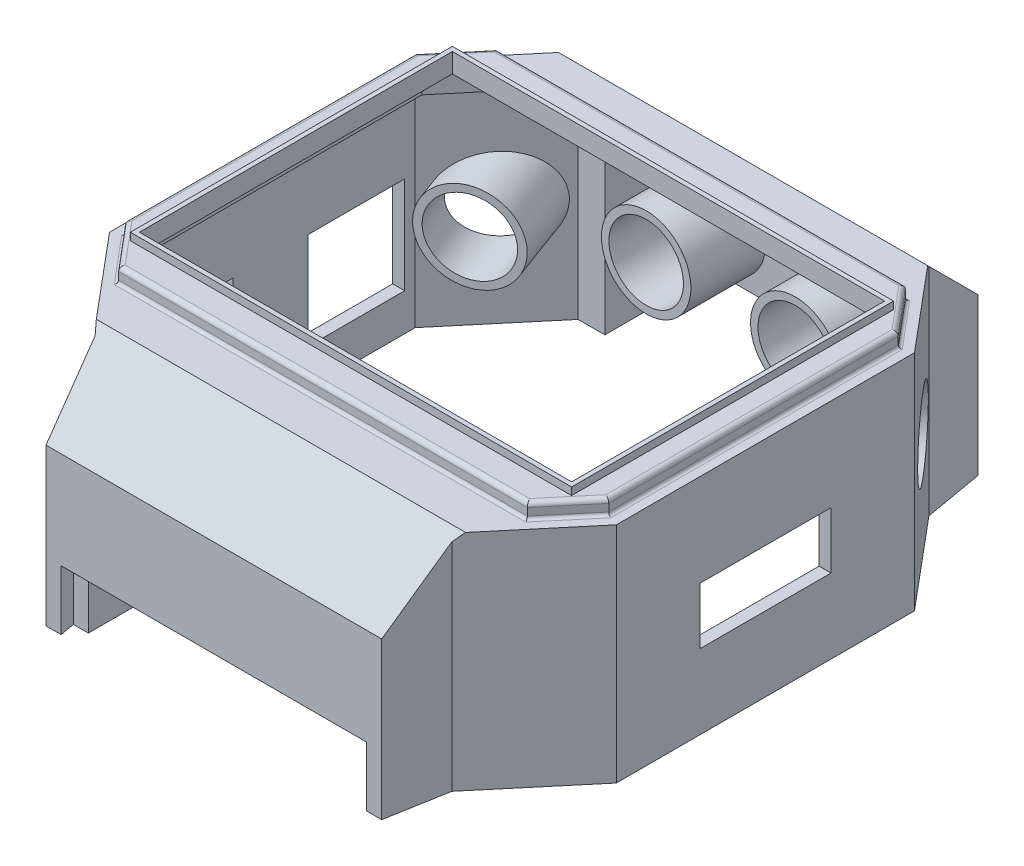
ISO-10303-21;
HEADER;
FILE_DESCRIPTION(('STEP AP214'),'2;1');
FILE_NAME('part.step','',(''),(''),'','','');
FILE_SCHEMA(('AUTOMOTIVE_DESIGN { 1 0 10303 214 1 1 1 1 }'));
ENDSEC;
DATA;
#1=APPLICATION_CONTEXT('core data for automotive mechanical design processes');
#2=APPLICATION_PROTOCOL_DEFINITION('international standard','automotive_design',2000,#1);
#3=PRODUCT_CONTEXT('',#1,'mechanical');
#4=PRODUCT('Part','Part','',(#3));
#5=PRODUCT_RELATED_PRODUCT_CATEGORY('part','',(#4));
#6=PRODUCT_DEFINITION_FORMATION('','',#4);
#7=PRODUCT_DEFINITION_CONTEXT('part definition',#1,'design');
#8=PRODUCT_DEFINITION('design','',#6,#7);
#9=PRODUCT_DEFINITION_SHAPE('','',#8);
#10=(LENGTH_UNIT() NAMED_UNIT(*) SI_UNIT(.MILLI.,.METRE.));
#11=(NAMED_UNIT(*) PLANE_ANGLE_UNIT() SI_UNIT($,.RADIAN.));
#12=(NAMED_UNIT(*) SI_UNIT($,.STERADIAN.) SOLID_ANGLE_UNIT());
#13=UNCERTAINTY_MEASURE_WITH_UNIT(LENGTH_MEASURE(1.E-05),#10,'distance_accuracy_value','');
#14=(GEOMETRIC_REPRESENTATION_CONTEXT(3) GLOBAL_UNCERTAINTY_ASSIGNED_CONTEXT((#13)) GLOBAL_UNIT_ASSIGNED_CONTEXT((#10,
#11,#12)) REPRESENTATION_CONTEXT('',''));
#15=CARTESIAN_POINT('',(0.,0.,0.));
#16=DIRECTION('',(0.,0.,1.));
#17=DIRECTION('',(1.,0.,0.));
#18=AXIS2_PLACEMENT_3D('',#15,#16,#17);
#19=CARTESIAN_POINT('',(11.214779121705,62.0970356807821,-15.6499787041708));
#20=DIRECTION('',(0.766044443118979,0.,-0.642787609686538));
#21=DIRECTION('',(-0.642787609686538,0.,-0.76604444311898));
#22=AXIS2_PLACEMENT_3D('',#19,#20,#21);
#23=PLANE('',#22);
#24=DIRECTION('',(0.,-1.,0.));
#25=VECTOR('',#24,1.);
#26=CARTESIAN_POINT('',(16.2,62.0970356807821,-9.70882381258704));
#27=LINE('',#26,#25);
#28=CARTESIAN_POINT('',(16.2,14.,-9.70882381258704));
#29=VERTEX_POINT('',#28);
#30=CARTESIAN_POINT('',(16.2,0.,-9.70882381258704));
#31=VERTEX_POINT('',#30);
#32=EDGE_CURVE('E926',#29,#31,#27,.T.);
#33=ORIENTED_EDGE('',*,*,#32,.F.);
#34=DIRECTION('',(-0.642787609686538,0.,-0.766044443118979));
#35=VECTOR('',#34,1.);
#36=CARTESIAN_POINT('',(16.2,14.,-9.70882381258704));
#37=LINE('',#36,#35);
#38=CARTESIAN_POINT('',(11.214779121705,14.,-15.6499787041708));
#39=VERTEX_POINT('',#38);
#40=EDGE_CURVE('E882',#29,#39,#37,.T.);
#41=ORIENTED_EDGE('',*,*,#40,.T.);
#42=DIRECTION('',(0.,-1.,0.));
#43=VECTOR('',#42,1.);
#44=CARTESIAN_POINT('',(11.214779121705,62.0970356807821,-15.6499787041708));
#45=LINE('',#44,#43);
#46=CARTESIAN_POINT('',(11.214779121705,0.,-15.6499787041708));
#47=VERTEX_POINT('',#46);
#48=EDGE_CURVE('E912',#39,#47,#45,.T.);
#49=ORIENTED_EDGE('',*,*,#48,.T.);
#50=DIRECTION('',(0.642787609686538,0.,0.766044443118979));
#51=VECTOR('',#50,1.);
#52=CARTESIAN_POINT('',(11.214779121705,0.,-15.6499787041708));
#53=LINE('',#52,#51);
#54=EDGE_CURVE('E894',#47,#31,#53,.T.);
#55=ORIENTED_EDGE('',*,*,#54,.T.);
#56=EDGE_LOOP('',(#33,#41,#49,#55));
#57=FACE_BOUND('',#56,.T.);
#58=CARTESIAN_POINT('',(13.7073895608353,6.99999999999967,-12.6794012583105));
#59=DIRECTION('',(0.766044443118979,0.,-0.642787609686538));
#60=DIRECTION('',(0.642635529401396,-0.0217516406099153,0.765863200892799));
#61=AXIS2_PLACEMENT_3D('',#58,#59,#60);
#62=ELLIPSE('',#61,3.46410161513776,3.);
#63=CARTESIAN_POINT('',(15.9335443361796,6.92465010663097,-10.0263733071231));
#64=VERTEX_POINT('',#63);
#65=EDGE_CURVE('E13',#64,#64,#62,.F.);
#66=ORIENTED_EDGE('',*,*,#65,.F.);
#67=EDGE_LOOP('',(#66));
#68=FACE_BOUND('',#67,.T.);
#69=ADVANCED_FACE('F45',(#57,#68),#23,.F.);
#70=CARTESIAN_POINT('',(11.9654022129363,17.,-16.));
#71=DIRECTION('',(-0.766044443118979,0.,0.642787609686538));
#72=DIRECTION('',(0.642787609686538,0.,0.766044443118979));
#73=AXIS2_PLACEMENT_3D('',#70,#71,#72);
#74=PLANE('',#73);
#75=DIRECTION('',(0.,-1.,0.));
#76=VECTOR('',#75,1.);
#77=CARTESIAN_POINT('',(11.9654022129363,17.,-16.));
#78=LINE('',#77,#76);
#79=CARTESIAN_POINT('',(11.9654022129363,14.5,-16.));
#80=VERTEX_POINT('',#79);
#81=CARTESIAN_POINT('',(11.9654022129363,0.,-16.));
#82=VERTEX_POINT('',#81);
#83=EDGE_CURVE('E1062',#80,#82,#78,.T.);
#84=ORIENTED_EDGE('',*,*,#83,.F.);
#85=DIRECTION('',(-0.510273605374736,-0.608120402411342,-0.608120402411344));
#86=VECTOR('',#85,1.);
#87=CARTESIAN_POINT('',(4.7334627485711,5.88131016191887,-24.6186898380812));
#88=LINE('',#87,#86);
#89=CARTESIAN_POINT('',(12.384952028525,15.,-15.5));
#90=VERTEX_POINT('',#89);
#91=EDGE_CURVE('E949',#90,#80,#88,.T.);
#92=ORIENTED_EDGE('',*,*,#91,.F.);
#93=DIRECTION('',(-0.642787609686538,0.,-0.766044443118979));
#94=VECTOR('',#93,1.);
#95=CARTESIAN_POINT('',(11.9654022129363,15.,-16.));
#96=LINE('',#95,#94);
#97=CARTESIAN_POINT('',(17.,15.,-10.));
#98=VERTEX_POINT('',#97);
#99=EDGE_CURVE('E995',#98,#90,#96,.T.);
#100=ORIENTED_EDGE('',*,*,#99,.F.);
#101=DIRECTION('',(0.,-1.,0.));
#102=VECTOR('',#101,1.);
#103=CARTESIAN_POINT('',(17.,17.,-10.));
#104=LINE('',#103,#102);
#105=CARTESIAN_POINT('',(17.,0.,-10.));
#106=VERTEX_POINT('',#105);
#107=EDGE_CURVE('E1064',#98,#106,#104,.T.);
#108=ORIENTED_EDGE('',*,*,#107,.T.);
#109=DIRECTION('',(-0.642787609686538,0.,-0.766044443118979));
#110=VECTOR('',#109,1.);
#111=CARTESIAN_POINT('',(11.9654022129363,0.,-16.));
#112=LINE('',#111,#110);
#113=EDGE_CURVE('E1054',#106,#82,#112,.T.);
#114=ORIENTED_EDGE('',*,*,#113,.T.);
#115=EDGE_LOOP('',(#84,#92,#100,#108,#114));
#116=FACE_BOUND('',#115,.T.);
#117=CARTESIAN_POINT('',(14.0234044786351,7.01004665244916,-13.5473684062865));
#118=DIRECTION('',(-0.766044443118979,0.,0.642787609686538));
#119=DIRECTION('',(0.642635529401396,-0.0217516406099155,0.765863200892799));
#120=AXIS2_PLACEMENT_3D('',#117,#118,#119);
#121=ELLIPSE('',#120,2.88675134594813,2.5);
#122=CARTESIAN_POINT('',(15.8785334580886,6.94725507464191,-11.3365117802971));
#123=VERTEX_POINT('',#122);
#124=EDGE_CURVE('E2476',#123,#123,#121,.T.);
#125=ORIENTED_EDGE('',*,*,#124,.T.);
#126=EDGE_LOOP('',(#125));
#127=FACE_BOUND('',#126,.T.);
#128=ADVANCED_FACE('F1305',(#116,#127),#74,.F.);
#129=CARTESIAN_POINT('',(-10.4209946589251,10.5,19.));
#130=DIRECTION('',(0.,0.,1.));
#131=DIRECTION('',(1.,0.,0.));
#132=AXIS2_PLACEMENT_3D('',#129,#130,#131);
#133=PLANE('',#132);
#134=DIRECTION('',(0.,1.,0.));
#135=VECTOR('',#134,1.);
#136=CARTESIAN_POINT('',(9.420994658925,-3.8000401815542,19.));
#137=LINE('',#136,#135);
#138=CARTESIAN_POINT('',(9.420994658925,4.,19.));
#139=VERTEX_POINT('',#138);
#140=CARTESIAN_POINT('',(9.420994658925,10.5,19.));
#141=VERTEX_POINT('',#140);
#142=EDGE_CURVE('E709',#139,#141,#137,.T.);
#143=ORIENTED_EDGE('',*,*,#142,.F.);
#144=DIRECTION('',(1.,0.,0.));
#145=VECTOR('',#144,1.);
#146=CARTESIAN_POINT('',(0.,4.,19.));
#147=LINE('',#146,#145);
#148=CARTESIAN_POINT('',(-9.42099465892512,4.,19.));
#149=VERTEX_POINT('',#148);
#150=EDGE_CURVE('E1206',#149,#139,#147,.T.);
#151=ORIENTED_EDGE('',*,*,#150,.F.);
#152=DIRECTION('',(0.,1.,0.));
#153=VECTOR('',#152,1.);
#154=CARTESIAN_POINT('',(-9.42099465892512,-3.8000401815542,19.));
#155=LINE('',#154,#153);
#156=CARTESIAN_POINT('',(-9.42099465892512,10.5,19.));
#157=VERTEX_POINT('',#156);
#158=EDGE_CURVE('E718',#149,#157,#155,.T.);
#159=ORIENTED_EDGE('',*,*,#158,.T.);
#160=DIRECTION('',(-1.,0.,0.));
#161=VECTOR('',#160,1.);
#162=CARTESIAN_POINT('',(-10.4209946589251,10.5,19.));
#163=LINE('',#162,#161);
#164=EDGE_CURVE('E767',#141,#157,#163,.T.);
#165=ORIENTED_EDGE('',*,*,#164,.F.);
#166=EDGE_LOOP('',(#143,#151,#159,#165));
#167=FACE_BOUND('',#166,.T.);
#168=ADVANCED_FACE('F1423',(#167),#133,.F.);
#169=CARTESIAN_POINT('',(0.,10.5,0.));
#170=DIRECTION('',(0.,-1.,0.));
#171=DIRECTION('',(0.,0.,-1.));
#172=AXIS2_PLACEMENT_3D('',#169,#170,#171);
#173=PLANE('',#172);
#174=DIRECTION('',(1.,0.,0.));
#175=VECTOR('',#174,1.);
#176=CARTESIAN_POINT('',(-11.2147791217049,10.5,15.6499787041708));
#177=LINE('',#176,#175);
#178=CARTESIAN_POINT('',(-9.42099465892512,10.5,15.6499787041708));
#179=VERTEX_POINT('',#178);
#180=CARTESIAN_POINT('',(9.420994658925,10.5,15.6499787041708));
#181=VERTEX_POINT('',#180);
#182=EDGE_CURVE('E771',#179,#181,#177,.T.);
#183=ORIENTED_EDGE('',*,*,#182,.T.);
#184=DIRECTION('',(0.,0.,-1.));
#185=VECTOR('',#184,1.);
#186=CARTESIAN_POINT('',(9.420994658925,10.5,19.));
#187=LINE('',#186,#185);
#188=EDGE_CURVE('E693',#141,#181,#187,.T.);
#189=ORIENTED_EDGE('',*,*,#188,.F.);
#190=ORIENTED_EDGE('',*,*,#164,.T.);
#191=DIRECTION('',(0.,0.,1.));
#192=VECTOR('',#191,1.);
#193=CARTESIAN_POINT('',(-9.42099465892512,10.5,15.6499787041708));
#194=LINE('',#193,#192);
#195=EDGE_CURVE('E715',#179,#157,#194,.T.);
#196=ORIENTED_EDGE('',*,*,#195,.F.);
#197=EDGE_LOOP('',(#183,#189,#190,#196));
#198=FACE_BOUND('',#197,.T.);
#199=ADVANCED_FACE('F1505',(#198),#173,.T.);
#200=CARTESIAN_POINT('',(0.,0.,0.));
#201=DIRECTION('',(0.,-1.,0.));
#202=DIRECTION('',(0.,0.,-1.));
#203=AXIS2_PLACEMENT_3D('',#200,#201,#202);
#204=PLANE('',#203);
#205=DIRECTION('',(-0.173648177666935,0.,0.984807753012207));
#206=VECTOR('',#205,1.);
#207=CARTESIAN_POINT('',(-10.2446676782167,0.,-20.));
#208=LINE('',#207,#206);
#209=CARTESIAN_POINT('',(-10.2446676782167,0.,-20.));
#210=VERTEX_POINT('',#209);
#211=CARTESIAN_POINT('',(-10.4209946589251,0.,-19.));
#212=VERTEX_POINT('',#211);
#213=EDGE_CURVE('E777',#210,#212,#208,.T.);
#214=ORIENTED_EDGE('',*,*,#213,.T.);
#215=DIRECTION('',(-1.,0.,0.));
#216=VECTOR('',#215,1.);
#217=CARTESIAN_POINT('',(-9.42099465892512,0.,-19.));
#218=LINE('',#217,#216);
#219=CARTESIAN_POINT('',(-9.42099465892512,0.,-19.));
#220=VERTEX_POINT('',#219);
#221=EDGE_CURVE('E676',#220,#212,#218,.T.);
#222=ORIENTED_EDGE('',*,*,#221,.F.);
#223=DIRECTION('',(0.,0.,-1.));
#224=VECTOR('',#223,1.);
#225=CARTESIAN_POINT('',(-9.42099465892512,0.,-15.6499787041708));
#226=LINE('',#225,#224);
#227=CARTESIAN_POINT('',(-9.42099465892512,0.,-15.6499787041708));
#228=VERTEX_POINT('',#227);
#229=EDGE_CURVE('E680',#228,#220,#226,.T.);
#230=ORIENTED_EDGE('',*,*,#229,.F.);
#231=DIRECTION('',(1.,0.,0.));
#232=VECTOR('',#231,1.);
#233=CARTESIAN_POINT('',(-11.2147791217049,0.,-15.6499787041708));
#234=LINE('',#233,#232);
#235=CARTESIAN_POINT('',(-11.2147791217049,0.,-15.6499787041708));
#236=VERTEX_POINT('',#235);
#237=EDGE_CURVE('E679',#236,#228,#234,.T.);
#238=ORIENTED_EDGE('',*,*,#237,.F.);
#239=DIRECTION('',(0.642787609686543,0.,-0.766044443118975));
#240=VECTOR('',#239,1.);
#241=CARTESIAN_POINT('',(-16.2,0.,-9.70882381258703));
#242=LINE('',#241,#240);
#243=CARTESIAN_POINT('',(-16.2,0.,-9.70882381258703));
#244=VERTEX_POINT('',#243);
#245=EDGE_CURVE('E909',#244,#236,#242,.T.);
#246=ORIENTED_EDGE('',*,*,#245,.F.);
#247=DIRECTION('',(0.,0.,-1.));
#248=VECTOR('',#247,1.);
#249=CARTESIAN_POINT('',(-16.2,0.,9.70882381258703));
#250=LINE('',#249,#248);
#251=CARTESIAN_POINT('',(-16.2,0.,9.70882381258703));
#252=VERTEX_POINT('',#251);
#253=EDGE_CURVE('E906',#252,#244,#250,.T.);
#254=ORIENTED_EDGE('',*,*,#253,.F.);
#255=DIRECTION('',(-0.642787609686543,0.,-0.766044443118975));
#256=VECTOR('',#255,1.);
#257=CARTESIAN_POINT('',(-11.2147791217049,0.,15.6499787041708));
#258=LINE('',#257,#256);
#259=CARTESIAN_POINT('',(-11.2147791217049,0.,15.6499787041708));
#260=VERTEX_POINT('',#259);
#261=EDGE_CURVE('E903',#260,#252,#258,.T.);
#262=ORIENTED_EDGE('',*,*,#261,.F.);
#263=DIRECTION('',(1.,0.,0.));
#264=VECTOR('',#263,1.);
#265=CARTESIAN_POINT('',(-11.2147791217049,0.,15.6499787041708));
#266=LINE('',#265,#264);
#267=CARTESIAN_POINT('',(-9.42099465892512,0.,15.6499787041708));
#268=VERTEX_POINT('',#267);
#269=EDGE_CURVE('E726',#260,#268,#266,.T.);
#270=ORIENTED_EDGE('',*,*,#269,.T.);
#271=DIRECTION('',(0.,0.,1.));
#272=VECTOR('',#271,1.);
#273=CARTESIAN_POINT('',(-9.42099465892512,0.,15.6499787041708));
#274=LINE('',#273,#272);
#275=CARTESIAN_POINT('',(-9.42099465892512,0.,19.));
#276=VERTEX_POINT('',#275);
#277=EDGE_CURVE('E723',#268,#276,#274,.T.);
#278=ORIENTED_EDGE('',*,*,#277,.T.);
#279=DIRECTION('',(-1.,0.,0.));
#280=VECTOR('',#279,1.);
#281=CARTESIAN_POINT('',(-9.42099465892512,0.,19.));
#282=LINE('',#281,#280);
#283=CARTESIAN_POINT('',(-10.4209946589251,0.,19.));
#284=VERTEX_POINT('',#283);
#285=EDGE_CURVE('E719',#276,#284,#282,.T.);
#286=ORIENTED_EDGE('',*,*,#285,.T.);
#287=DIRECTION('',(-0.173648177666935,0.,-0.984807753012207));
#288=VECTOR('',#287,1.);
#289=CARTESIAN_POINT('',(-10.2446676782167,0.,20.));
#290=LINE('',#289,#288);
#291=CARTESIAN_POINT('',(-10.2446676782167,0.,20.));
#292=VERTEX_POINT('',#291);
#293=EDGE_CURVE('E802',#292,#284,#290,.T.);
#294=ORIENTED_EDGE('',*,*,#293,.F.);
#295=DIRECTION('',(1.,0.,0.));
#296=VECTOR('',#295,1.);
#297=CARTESIAN_POINT('',(-11.2600942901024,0.,20.));
#298=LINE('',#297,#296);
#299=CARTESIAN_POINT('',(-11.2600942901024,0.,20.));
#300=VERTEX_POINT('',#299);
#301=EDGE_CURVE('E1042',#300,#292,#298,.T.);
#302=ORIENTED_EDGE('',*,*,#301,.F.);
#303=DIRECTION('',(0.173648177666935,0.,0.984807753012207));
#304=VECTOR('',#303,1.);
#305=CARTESIAN_POINT('',(-11.2600942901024,0.,20.));
#306=LINE('',#305,#304);
#307=CARTESIAN_POINT('',(-11.9654022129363,0.,16.));
#308=VERTEX_POINT('',#307);
#309=EDGE_CURVE('E1038',#308,#300,#306,.T.);
#310=ORIENTED_EDGE('',*,*,#309,.F.);
#311=DIRECTION('',(0.642787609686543,0.,0.766044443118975));
#312=VECTOR('',#311,1.);
#313=CARTESIAN_POINT('',(-11.9654022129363,0.,16.));
#314=LINE('',#313,#312);
#315=CARTESIAN_POINT('',(-17.,0.,10.));
#316=VERTEX_POINT('',#315);
#317=EDGE_CURVE('E1035',#316,#308,#314,.T.);
#318=ORIENTED_EDGE('',*,*,#317,.F.);
#319=DIRECTION('',(0.,0.,1.));
#320=VECTOR('',#319,1.);
#321=CARTESIAN_POINT('',(-17.,0.,-10.));
#322=LINE('',#321,#320);
#323=CARTESIAN_POINT('',(-17.,0.,-10.));
#324=VERTEX_POINT('',#323);
#325=EDGE_CURVE('E1032',#324,#316,#322,.T.);
#326=ORIENTED_EDGE('',*,*,#325,.F.);
#327=DIRECTION('',(-0.642787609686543,0.,0.766044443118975));
#328=VECTOR('',#327,1.);
#329=CARTESIAN_POINT('',(-11.9654022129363,0.,-16.));
#330=LINE('',#329,#328);
#331=CARTESIAN_POINT('',(-11.9654022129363,0.,-16.));
#332=VERTEX_POINT('',#331);
#333=EDGE_CURVE('E1029',#332,#324,#330,.T.);
#334=ORIENTED_EDGE('',*,*,#333,.F.);
#335=DIRECTION('',(-0.173648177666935,0.,0.984807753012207));
#336=VECTOR('',#335,1.);
#337=CARTESIAN_POINT('',(-11.2600942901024,0.,-20.));
#338=LINE('',#337,#336);
#339=CARTESIAN_POINT('',(-11.2600942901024,0.,-20.));
#340=VERTEX_POINT('',#339);
#341=EDGE_CURVE('E1026',#340,#332,#338,.T.);
#342=ORIENTED_EDGE('',*,*,#341,.F.);
#343=DIRECTION('',(-1.,0.,0.));
#344=VECTOR('',#343,1.);
#345=CARTESIAN_POINT('',(-11.2600942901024,0.,-20.));
#346=LINE('',#345,#344);
#347=EDGE_CURVE('E1014',#210,#340,#346,.T.);
#348=ORIENTED_EDGE('',*,*,#347,.F.);
#349=EDGE_LOOP('',(#214,#222,#230,#238,#246,#254,#262,#270,#278,#286,#294,#302,#310,#318,#326,
#334,#342,#348));
#350=FACE_BOUND('',#349,.T.);
#351=ADVANCED_FACE('F1254',(#350),#204,.T.);
#352=ORIENTED_EDGE('',*,*,#54,.F.);
#353=DIRECTION('',(1.,0.,0.));
#354=VECTOR('',#353,1.);
#355=CARTESIAN_POINT('',(9.420994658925,0.,-15.6499787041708));
#356=LINE('',#355,#354);
#357=CARTESIAN_POINT('',(9.420994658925,0.,-15.6499787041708));
#358=VERTEX_POINT('',#357);
#359=EDGE_CURVE('E656',#358,#47,#356,.T.);
#360=ORIENTED_EDGE('',*,*,#359,.F.);
#361=DIRECTION('',(0.,0.,1.));
#362=VECTOR('',#361,1.);
#363=CARTESIAN_POINT('',(9.420994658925,0.,-19.));
#364=LINE('',#363,#362);
#365=CARTESIAN_POINT('',(9.420994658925,0.,-19.));
#366=VERTEX_POINT('',#365);
#367=EDGE_CURVE('E661',#366,#358,#364,.T.);
#368=ORIENTED_EDGE('',*,*,#367,.F.);
#369=DIRECTION('',(-1.,0.,1.00613961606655E-12));
#370=VECTOR('',#369,1.);
#371=CARTESIAN_POINT('',(10.420994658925,0.,-19.000000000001));
#372=LINE('',#371,#370);
#373=CARTESIAN_POINT('',(10.420994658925,0.,-19.000000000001));
#374=VERTEX_POINT('',#373);
#375=EDGE_CURVE('E655',#374,#366,#372,.T.);
#376=ORIENTED_EDGE('',*,*,#375,.F.);
#377=DIRECTION('',(-0.173648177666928,0.,-0.984807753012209));
#378=VECTOR('',#377,1.);
#379=CARTESIAN_POINT('',(10.2446676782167,0.,-20.));
#380=LINE('',#379,#378);
#381=CARTESIAN_POINT('',(10.2446676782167,0.,-20.));
#382=VERTEX_POINT('',#381);
#383=EDGE_CURVE('E784',#374,#382,#380,.T.);
#384=ORIENTED_EDGE('',*,*,#383,.T.);
#385=CARTESIAN_POINT('',(11.2600942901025,0.,-20.));
#386=VERTEX_POINT('',#385);
#387=EDGE_CURVE('E1023',#386,#382,#346,.T.);
#388=ORIENTED_EDGE('',*,*,#387,.F.);
#389=DIRECTION('',(-0.173648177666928,0.,-0.984807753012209));
#390=VECTOR('',#389,1.);
#391=CARTESIAN_POINT('',(11.2600942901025,0.,-20.));
#392=LINE('',#391,#390);
#393=EDGE_CURVE('E1057',#82,#386,#392,.T.);
#394=ORIENTED_EDGE('',*,*,#393,.F.);
#395=ORIENTED_EDGE('',*,*,#113,.F.);
#396=DIRECTION('',(0.,0.,-1.));
#397=VECTOR('',#396,1.);
#398=CARTESIAN_POINT('',(17.,0.,-10.));
#399=LINE('',#398,#397);
#400=CARTESIAN_POINT('',(17.,0.,10.));
#401=VERTEX_POINT('',#400);
#402=EDGE_CURVE('E1051',#401,#106,#399,.T.);
#403=ORIENTED_EDGE('',*,*,#402,.F.);
#404=DIRECTION('',(0.642787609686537,0.,-0.76604444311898));
#405=VECTOR('',#404,1.);
#406=CARTESIAN_POINT('',(11.9654022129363,0.,16.));
#407=LINE('',#406,#405);
#408=CARTESIAN_POINT('',(11.9654022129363,0.,16.));
#409=VERTEX_POINT('',#408);
#410=EDGE_CURVE('E1048',#409,#401,#407,.T.);
#411=ORIENTED_EDGE('',*,*,#410,.F.);
#412=DIRECTION('',(0.173648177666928,0.,-0.984807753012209));
#413=VECTOR('',#412,1.);
#414=CARTESIAN_POINT('',(11.2600942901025,0.,20.));
#415=LINE('',#414,#413);
#416=CARTESIAN_POINT('',(11.2600942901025,0.,20.));
#417=VERTEX_POINT('',#416);
#418=EDGE_CURVE('E1045',#417,#409,#415,.T.);
#419=ORIENTED_EDGE('',*,*,#418,.F.);
#420=CARTESIAN_POINT('',(10.2446676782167,0.,20.));
#421=VERTEX_POINT('',#420);
#422=EDGE_CURVE('E1041',#421,#417,#298,.T.);
#423=ORIENTED_EDGE('',*,*,#422,.F.);
#424=DIRECTION('',(-0.173648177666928,0.,0.984807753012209));
#425=VECTOR('',#424,1.);
#426=CARTESIAN_POINT('',(10.2446676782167,0.,20.));
#427=LINE('',#426,#425);
#428=CARTESIAN_POINT('',(10.420994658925,0.,19.000000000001));
#429=VERTEX_POINT('',#428);
#430=EDGE_CURVE('E796',#429,#421,#427,.T.);
#431=ORIENTED_EDGE('',*,*,#430,.F.);
#432=DIRECTION('',(-1.,0.,-1.00613961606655E-12));
#433=VECTOR('',#432,1.);
#434=CARTESIAN_POINT('',(10.420994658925,0.,19.000000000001));
#435=LINE('',#434,#433);
#436=CARTESIAN_POINT('',(9.420994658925,0.,19.));
#437=VERTEX_POINT('',#436);
#438=EDGE_CURVE('E698',#429,#437,#435,.T.);
#439=ORIENTED_EDGE('',*,*,#438,.T.);
#440=DIRECTION('',(0.,0.,-1.));
#441=VECTOR('',#440,1.);
#442=CARTESIAN_POINT('',(9.420994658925,0.,19.));
#443=LINE('',#442,#441);
#444=CARTESIAN_POINT('',(9.420994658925,0.,15.6499787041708));
#445=VERTEX_POINT('',#444);
#446=EDGE_CURVE('E696',#437,#445,#443,.T.);
#447=ORIENTED_EDGE('',*,*,#446,.T.);
#448=DIRECTION('',(1.,0.,0.));
#449=VECTOR('',#448,1.);
#450=CARTESIAN_POINT('',(9.420994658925,0.,15.6499787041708));
#451=LINE('',#450,#449);
#452=CARTESIAN_POINT('',(11.214779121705,0.,15.6499787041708));
#453=VERTEX_POINT('',#452);
#454=EDGE_CURVE('E702',#445,#453,#451,.T.);
#455=ORIENTED_EDGE('',*,*,#454,.T.);
#456=DIRECTION('',(-0.642787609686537,0.,0.76604444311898));
#457=VECTOR('',#456,1.);
#458=CARTESIAN_POINT('',(16.2,0.,9.70882381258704));
#459=LINE('',#458,#457);
#460=CARTESIAN_POINT('',(16.2,0.,9.70882381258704));
#461=VERTEX_POINT('',#460);
#462=EDGE_CURVE('E900',#461,#453,#459,.T.);
#463=ORIENTED_EDGE('',*,*,#462,.F.);
#464=DIRECTION('',(0.,0.,1.));
#465=VECTOR('',#464,1.);
#466=CARTESIAN_POINT('',(16.2,0.,-9.70882381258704));
#467=LINE('',#466,#465);
#468=EDGE_CURVE('E897',#31,#461,#467,.T.);
#469=ORIENTED_EDGE('',*,*,#468,.F.);
#470=EDGE_LOOP('',(#352,#360,#368,#376,#384,#388,#394,#395,#403,#411,#419,#423,#431,#439,#447,
#455,#463,#469));
#471=FACE_BOUND('',#470,.T.);
#472=ADVANCED_FACE('F1315',(#471),#204,.T.);
#473=CARTESIAN_POINT('',(11.214779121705,-22.4788651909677,-15.6499787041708));
#474=DIRECTION('',(0.,0.,-1.));
#475=DIRECTION('',(-1.,0.,0.));
#476=AXIS2_PLACEMENT_3D('',#473,#474,#475);
#477=PLANE('',#476);
#478=DIRECTION('',(0.,-1.,0.));
#479=VECTOR('',#478,1.);
#480=CARTESIAN_POINT('',(-11.2147791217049,62.0970356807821,-15.6499787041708));
#481=LINE('',#480,#479);
#482=CARTESIAN_POINT('',(-11.2147791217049,14.,-15.6499787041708));
#483=VERTEX_POINT('',#482);
#484=EDGE_CURVE('E913',#483,#236,#481,.T.);
#485=ORIENTED_EDGE('',*,*,#484,.T.);
#486=ORIENTED_EDGE('',*,*,#237,.T.);
#487=DIRECTION('',(0.,1.,0.));
#488=VECTOR('',#487,1.);
#489=CARTESIAN_POINT('',(-9.42099465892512,-3.8000401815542,-15.6499787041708));
#490=LINE('',#489,#488);
#491=CARTESIAN_POINT('',(-9.42099465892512,10.5,-15.6499787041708));
#492=VERTEX_POINT('',#491);
#493=EDGE_CURVE('E684',#228,#492,#490,.T.);
#494=ORIENTED_EDGE('',*,*,#493,.T.);
#495=DIRECTION('',(1.,0.,0.));
#496=VECTOR('',#495,1.);
#497=CARTESIAN_POINT('',(-11.2147791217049,10.5,-15.6499787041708));
#498=LINE('',#497,#496);
#499=CARTESIAN_POINT('',(9.420994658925,10.5,-15.6499787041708));
#500=VERTEX_POINT('',#499);
#501=EDGE_CURVE('E761',#492,#500,#498,.T.);
#502=ORIENTED_EDGE('',*,*,#501,.T.);
#503=DIRECTION('',(0.,1.,0.));
#504=VECTOR('',#503,1.);
#505=CARTESIAN_POINT('',(9.420994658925,-3.8000401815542,-15.6499787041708));
#506=LINE('',#505,#504);
#507=EDGE_CURVE('E660',#358,#500,#506,.T.);
#508=ORIENTED_EDGE('',*,*,#507,.F.);
#509=ORIENTED_EDGE('',*,*,#359,.T.);
#510=ORIENTED_EDGE('',*,*,#48,.F.);
#511=DIRECTION('',(-1.,0.,0.));
#512=VECTOR('',#511,1.);
#513=CARTESIAN_POINT('',(-11.2147791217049,14.,-15.6499787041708));
#514=LINE('',#513,#512);
#515=EDGE_CURVE('E753',#39,#483,#514,.T.);
#516=ORIENTED_EDGE('',*,*,#515,.T.);
#517=EDGE_LOOP('',(#485,#486,#494,#502,#508,#509,#510,#516));
#518=FACE_BOUND('',#517,.T.);
#519=ADVANCED_FACE('F1327',(#518),#477,.F.);
#520=CARTESIAN_POINT('',(10.2446676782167,4.,-20.));
#521=DIRECTION('',(-0.984807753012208,0.,0.173648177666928));
#522=DIRECTION('',(0.173648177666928,0.,0.984807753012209));
#523=AXIS2_PLACEMENT_3D('',#520,#521,#522);
#524=PLANE('',#523);
#525=ORIENTED_EDGE('',*,*,#383,.F.);
#526=DIRECTION('',(0.,-1.,0.));
#527=VECTOR('',#526,1.);
#528=CARTESIAN_POINT('',(10.4209946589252,10.5,-19.));
#529=LINE('',#528,#527);
#530=CARTESIAN_POINT('',(10.420994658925,4.,-19.000000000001));
#531=VERTEX_POINT('',#530);
#532=EDGE_CURVE('E764',#531,#374,#529,.T.);
#533=ORIENTED_EDGE('',*,*,#532,.F.);
#534=DIRECTION('',(-0.173648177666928,0.,-0.984807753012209));
#535=VECTOR('',#534,1.);
#536=CARTESIAN_POINT('',(10.2446676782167,4.,-20.));
#537=LINE('',#536,#535);
#538=CARTESIAN_POINT('',(10.2446676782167,4.,-20.));
#539=VERTEX_POINT('',#538);
#540=EDGE_CURVE('E787',#531,#539,#537,.T.);
#541=ORIENTED_EDGE('',*,*,#540,.T.);
#542=DIRECTION('',(0.,-1.,0.));
#543=VECTOR('',#542,1.);
#544=CARTESIAN_POINT('',(10.2446676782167,4.,-20.));
#545=LINE('',#544,#543);
#546=EDGE_CURVE('E793',#539,#382,#545,.T.);
#547=ORIENTED_EDGE('',*,*,#546,.T.);
#548=EDGE_LOOP('',(#525,#533,#541,#547));
#549=FACE_BOUND('',#548,.T.);
#550=ADVANCED_FACE('F1319',(#549),#524,.T.);
#551=CARTESIAN_POINT('',(-10.2446676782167,4.,-20.));
#552=DIRECTION('',(0.984807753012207,0.,0.173648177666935));
#553=DIRECTION('',(0.173648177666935,0.,-0.984807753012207));
#554=AXIS2_PLACEMENT_3D('',#551,#552,#553);
#555=PLANE('',#554);
#556=DIRECTION('',(-0.173648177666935,0.,0.984807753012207));
#557=VECTOR('',#556,1.);
#558=CARTESIAN_POINT('',(-10.2446676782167,4.,-20.));
#559=LINE('',#558,#557);
#560=CARTESIAN_POINT('',(-10.2446676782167,4.,-20.));
#561=VERTEX_POINT('',#560);
#562=CARTESIAN_POINT('',(-10.4209946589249,4.,-19.000000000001));
#563=VERTEX_POINT('',#562);
#564=EDGE_CURVE('E780',#561,#563,#559,.T.);
#565=ORIENTED_EDGE('',*,*,#564,.T.);
#566=DIRECTION('',(0.,-1.,0.));
#567=VECTOR('',#566,1.);
#568=CARTESIAN_POINT('',(-10.4209946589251,10.5,-19.));
#569=LINE('',#568,#567);
#570=EDGE_CURVE('E765',#563,#212,#569,.T.);
#571=ORIENTED_EDGE('',*,*,#570,.T.);
#572=ORIENTED_EDGE('',*,*,#213,.F.);
#573=DIRECTION('',(0.,-1.,0.));
#574=VECTOR('',#573,1.);
#575=CARTESIAN_POINT('',(-10.2446676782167,4.,-20.));
#576=LINE('',#575,#574);
#577=EDGE_CURVE('E789',#561,#210,#576,.T.);
#578=ORIENTED_EDGE('',*,*,#577,.F.);
#579=EDGE_LOOP('',(#565,#571,#572,#578));
#580=FACE_BOUND('',#579,.T.);
#581=ADVANCED_FACE('F1250',(#580),#555,.T.);
#582=CARTESIAN_POINT('',(0.,4.,0.));
#583=DIRECTION('',(0.,1.,0.));
#584=DIRECTION('',(0.,0.,-1.));
#585=AXIS2_PLACEMENT_3D('',#582,#583,#584);
#586=PLANE('',#585);
#587=DIRECTION('',(1.,0.,0.));
#588=VECTOR('',#587,1.);
#589=CARTESIAN_POINT('',(0.,4.,-19.));
#590=LINE('',#589,#588);
#591=CARTESIAN_POINT('',(-9.42099465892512,4.,-19.));
#592=VERTEX_POINT('',#591);
#593=EDGE_CURVE('E1211',#563,#592,#590,.T.);
#594=ORIENTED_EDGE('',*,*,#593,.F.);
#595=ORIENTED_EDGE('',*,*,#564,.F.);
#596=DIRECTION('',(-1.,0.,0.));
#597=VECTOR('',#596,1.);
#598=CARTESIAN_POINT('',(-10.2446676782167,4.,-20.));
#599=LINE('',#598,#597);
#600=EDGE_CURVE('E783',#539,#561,#599,.T.);
#601=ORIENTED_EDGE('',*,*,#600,.F.);
#602=ORIENTED_EDGE('',*,*,#540,.F.);
#603=DIRECTION('',(-1.,0.,1.00613961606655E-12));
#604=VECTOR('',#603,1.);
#605=CARTESIAN_POINT('',(-1.91166527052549E-11,4.,-18.9999999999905));
#606=LINE('',#605,#604);
#607=CARTESIAN_POINT('',(9.420994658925,4.,-19.));
#608=VERTEX_POINT('',#607);
#609=EDGE_CURVE('E659',#531,#608,#606,.T.);
#610=ORIENTED_EDGE('',*,*,#609,.T.);
#611=EDGE_CURVE('E1210',#592,#608,#590,.T.);
#612=ORIENTED_EDGE('',*,*,#611,.F.);
#613=EDGE_LOOP('',(#594,#595,#601,#602,#610,#612));
#614=FACE_BOUND('',#613,.T.);
#615=ADVANCED_FACE('F1244',(#614),#586,.F.);
#616=CARTESIAN_POINT('',(11.214779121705,-22.4788651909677,15.6499787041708));
#617=DIRECTION('',(0.,0.,1.));
#618=DIRECTION('',(1.,0.,0.));
#619=AXIS2_PLACEMENT_3D('',#616,#617,#618);
#620=PLANE('',#619);
#621=ORIENTED_EDGE('',*,*,#182,.F.);
#622=DIRECTION('',(0.,1.,0.));
#623=VECTOR('',#622,1.);
#624=CARTESIAN_POINT('',(-9.42099465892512,-3.8000401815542,15.6499787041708));
#625=LINE('',#624,#623);
#626=EDGE_CURVE('E714',#268,#179,#625,.T.);
#627=ORIENTED_EDGE('',*,*,#626,.F.);
#628=ORIENTED_EDGE('',*,*,#269,.F.);
#629=DIRECTION('',(0.,-1.,0.));
#630=VECTOR('',#629,1.);
#631=CARTESIAN_POINT('',(-11.2147791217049,62.0970356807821,15.6499787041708));
#632=LINE('',#631,#630);
#633=CARTESIAN_POINT('',(-11.2147791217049,14.,15.6499787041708));
#634=VERTEX_POINT('',#633);
#635=EDGE_CURVE('E920',#634,#260,#632,.T.);
#636=ORIENTED_EDGE('',*,*,#635,.F.);
#637=DIRECTION('',(1.,0.,0.));
#638=VECTOR('',#637,1.);
#639=CARTESIAN_POINT('',(11.214779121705,14.,15.6499787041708));
#640=LINE('',#639,#638);
#641=CARTESIAN_POINT('',(11.214779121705,14.,15.6499787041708));
#642=VERTEX_POINT('',#641);
#643=EDGE_CURVE('E756',#634,#642,#640,.T.);
#644=ORIENTED_EDGE('',*,*,#643,.T.);
#645=DIRECTION('',(0.,-1.,0.));
#646=VECTOR('',#645,1.);
#647=CARTESIAN_POINT('',(11.214779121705,62.0970356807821,15.6499787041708));
#648=LINE('',#647,#646);
#649=EDGE_CURVE('E922',#642,#453,#648,.T.);
#650=ORIENTED_EDGE('',*,*,#649,.T.);
#651=ORIENTED_EDGE('',*,*,#454,.F.);
#652=DIRECTION('',(0.,1.,0.));
#653=VECTOR('',#652,1.);
#654=CARTESIAN_POINT('',(9.420994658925,-3.8000401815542,15.6499787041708));
#655=LINE('',#654,#653);
#656=EDGE_CURVE('E692',#445,#181,#655,.T.);
#657=ORIENTED_EDGE('',*,*,#656,.T.);
#658=EDGE_LOOP('',(#621,#627,#628,#636,#644,#650,#651,#657));
#659=FACE_BOUND('',#658,.T.);
#660=ADVANCED_FACE('F1343',(#659),#620,.F.);
#661=CARTESIAN_POINT('',(-11.2600942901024,17.,-20.));
#662=DIRECTION('',(0.,0.,1.));
#663=DIRECTION('',(1.,0.,0.));
#664=AXIS2_PLACEMENT_3D('',#661,#662,#663);
#665=PLANE('',#664);
#666=CARTESIAN_POINT('',(-5.,7.25000000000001,-20.));
#667=DIRECTION('',(0.,0.,-1.));
#668=DIRECTION('',(-1.,0.,0.));
#669=AXIS2_PLACEMENT_3D('',#666,#667,#668);
#670=CIRCLE('',#669,2.5);
#671=CARTESIAN_POINT('',(-7.5,7.25000000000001,-20.));
#672=VERTEX_POINT('',#671);
#673=EDGE_CURVE('E2425',#672,#672,#670,.T.);
#674=ORIENTED_EDGE('',*,*,#673,.F.);
#675=EDGE_LOOP('',(#674));
#676=FACE_BOUND('',#675,.T.);
#677=CARTESIAN_POINT('',(5.,7.25000000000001,-20.));
#678=DIRECTION('',(0.,0.,-1.));
#679=DIRECTION('',(-1.,0.,0.));
#680=AXIS2_PLACEMENT_3D('',#677,#678,#679);
#681=CIRCLE('',#680,2.5);
#682=CARTESIAN_POINT('',(2.5,7.25000000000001,-20.));
#683=VERTEX_POINT('',#682);
#684=EDGE_CURVE('E2437',#683,#683,#681,.T.);
#685=ORIENTED_EDGE('',*,*,#684,.F.);
#686=EDGE_LOOP('',(#685));
#687=FACE_BOUND('',#686,.T.);
#688=ORIENTED_EDGE('',*,*,#546,.F.);
#689=ORIENTED_EDGE('',*,*,#600,.T.);
#690=ORIENTED_EDGE('',*,*,#577,.T.);
#691=ORIENTED_EDGE('',*,*,#347,.T.);
#692=DIRECTION('',(0.,-1.,0.));
#693=VECTOR('',#692,1.);
#694=CARTESIAN_POINT('',(-11.2600942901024,17.,-20.));
#695=LINE('',#694,#693);
#696=CARTESIAN_POINT('',(-11.2600942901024,10.5,-20.));
#697=VERTEX_POINT('',#696);
#698=EDGE_CURVE('E1083',#697,#340,#695,.T.);
#699=ORIENTED_EDGE('',*,*,#698,.F.);
#700=DIRECTION('',(1.,0.,0.));
#701=VECTOR('',#700,1.);
#702=CARTESIAN_POINT('',(-17.001,10.5,-20.));
#703=LINE('',#702,#701);
#704=CARTESIAN_POINT('',(11.2600942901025,10.5,-20.));
#705=VERTEX_POINT('',#704);
#706=EDGE_CURVE('E941',#697,#705,#703,.T.);
#707=ORIENTED_EDGE('',*,*,#706,.T.);
#708=DIRECTION('',(0.,-1.,0.));
#709=VECTOR('',#708,1.);
#710=CARTESIAN_POINT('',(11.2600942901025,17.,-20.));
#711=LINE('',#710,#709);
#712=EDGE_CURVE('E1060',#705,#386,#711,.T.);
#713=ORIENTED_EDGE('',*,*,#712,.T.);
#714=ORIENTED_EDGE('',*,*,#387,.T.);
#715=EDGE_LOOP('',(#688,#689,#690,#691,#699,#707,#713,#714));
#716=FACE_BOUND('',#715,.T.);
#717=ADVANCED_FACE('F1260',(#676,#687,#716),#665,.F.);
#718=CARTESIAN_POINT('',(-14.5,-0.001000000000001,-10.5));
#719=DIRECTION('',(-1.,0.,0.));
#720=DIRECTION('',(0.,0.,1.));
#721=AXIS2_PLACEMENT_3D('',#718,#719,#720);
#722=PLANE('',#721);
#723=DIRECTION('',(0.,1.,0.));
#724=VECTOR('',#723,1.);
#725=CARTESIAN_POINT('',(-14.5,-0.001000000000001,-10.5));
#726=LINE('',#725,#724);
#727=CARTESIAN_POINT('',(-14.5,15.2,-10.5));
#728=VERTEX_POINT('',#727);
#729=CARTESIAN_POINT('',(-14.5,16.5,-10.5));
#730=VERTEX_POINT('',#729);
#731=EDGE_CURVE('E929',#728,#730,#726,.T.);
#732=ORIENTED_EDGE('',*,*,#731,.T.);
#733=DIRECTION('',(0.,0.,1.));
#734=VECTOR('',#733,1.);
#735=CARTESIAN_POINT('',(-14.5,16.5,-10.5));
#736=LINE('',#735,#734);
#737=CARTESIAN_POINT('',(-14.5,16.5,10.5));
#738=VERTEX_POINT('',#737);
#739=EDGE_CURVE('E750',#730,#738,#736,.T.);
#740=ORIENTED_EDGE('',*,*,#739,.T.);
#741=DIRECTION('',(0.,1.,0.));
#742=VECTOR('',#741,1.);
#743=CARTESIAN_POINT('',(-14.5,-0.001000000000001,10.5));
#744=LINE('',#743,#742);
#745=CARTESIAN_POINT('',(-14.5,15.2,10.5));
#746=VERTEX_POINT('',#745);
#747=EDGE_CURVE('E915',#746,#738,#744,.T.);
#748=ORIENTED_EDGE('',*,*,#747,.F.);
#749=DIRECTION('',(0.,0.,1.));
#750=VECTOR('',#749,1.);
#751=CARTESIAN_POINT('',(-14.5,15.2,-10.5));
#752=LINE('',#751,#750);
#753=EDGE_CURVE('E874',#728,#746,#752,.T.);
#754=ORIENTED_EDGE('',*,*,#753,.F.);
#755=EDGE_LOOP('',(#732,#740,#748,#754));
#756=FACE_BOUND('',#755,.T.);
#757=ADVANCED_FACE('F1431',(#756),#722,.F.);
#758=CARTESIAN_POINT('',(-14.5,-0.001000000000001,-10.5));
#759=DIRECTION('',(0.,0.,-1.));
#760=DIRECTION('',(-1.,0.,0.));
#761=AXIS2_PLACEMENT_3D('',#758,#759,#760);
#762=PLANE('',#761);
#763=DIRECTION('',(0.,1.,0.));
#764=VECTOR('',#763,1.);
#765=CARTESIAN_POINT('',(14.5,-0.001000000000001,-10.5));
#766=LINE('',#765,#764);
#767=CARTESIAN_POINT('',(14.5,15.2,-10.5));
#768=VERTEX_POINT('',#767);
#769=CARTESIAN_POINT('',(14.5,16.5,-10.5));
#770=VERTEX_POINT('',#769);
#771=EDGE_CURVE('E933',#768,#770,#766,.T.);
#772=ORIENTED_EDGE('',*,*,#771,.T.);
#773=DIRECTION('',(-1.,0.,0.));
#774=VECTOR('',#773,1.);
#775=CARTESIAN_POINT('',(-14.5,16.5,-10.5));
#776=LINE('',#775,#774);
#777=EDGE_CURVE('E747',#770,#730,#776,.T.);
#778=ORIENTED_EDGE('',*,*,#777,.T.);
#779=ORIENTED_EDGE('',*,*,#731,.F.);
#780=DIRECTION('',(-1.,0.,0.));
#781=VECTOR('',#780,1.);
#782=CARTESIAN_POINT('',(-14.5,15.2,-10.5));
#783=LINE('',#782,#781);
#784=EDGE_CURVE('E872',#768,#728,#783,.T.);
#785=ORIENTED_EDGE('',*,*,#784,.F.);
#786=EDGE_LOOP('',(#772,#778,#779,#785));
#787=FACE_BOUND('',#786,.T.);
#788=ADVANCED_FACE('F1427',(#787),#762,.F.);
#789=CARTESIAN_POINT('',(14.5,-0.001000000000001,-10.5));
#790=DIRECTION('',(1.,0.,0.));
#791=DIRECTION('',(0.,0.,-1.));
#792=AXIS2_PLACEMENT_3D('',#789,#790,#791);
#793=PLANE('',#792);
#794=DIRECTION('',(0.,1.,0.));
#795=VECTOR('',#794,1.);
#796=CARTESIAN_POINT('',(14.5,-0.001000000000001,10.5));
#797=LINE('',#796,#795);
#798=CARTESIAN_POINT('',(14.5,15.2,10.5));
#799=VERTEX_POINT('',#798);
#800=CARTESIAN_POINT('',(14.5,16.5,10.5));
#801=VERTEX_POINT('',#800);
#802=EDGE_CURVE('E936',#799,#801,#797,.T.);
#803=ORIENTED_EDGE('',*,*,#802,.T.);
#804=DIRECTION('',(0.,0.,-1.));
#805=VECTOR('',#804,1.);
#806=CARTESIAN_POINT('',(14.5,16.5,-10.5));
#807=LINE('',#806,#805);
#808=EDGE_CURVE('E744',#801,#770,#807,.T.);
#809=ORIENTED_EDGE('',*,*,#808,.T.);
#810=ORIENTED_EDGE('',*,*,#771,.F.);
#811=DIRECTION('',(0.,0.,-1.));
#812=VECTOR('',#811,1.);
#813=CARTESIAN_POINT('',(14.5,15.2,-10.5));
#814=LINE('',#813,#812);
#815=EDGE_CURVE('E870',#799,#768,#814,.T.);
#816=ORIENTED_EDGE('',*,*,#815,.F.);
#817=EDGE_LOOP('',(#803,#809,#810,#816));
#818=FACE_BOUND('',#817,.T.);
#819=ADVANCED_FACE('F1430',(#818),#793,.F.);
#820=CARTESIAN_POINT('',(-14.5,-0.001000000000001,10.5));
#821=DIRECTION('',(0.,0.,1.));
#822=DIRECTION('',(1.,0.,0.));
#823=AXIS2_PLACEMENT_3D('',#820,#821,#822);
#824=PLANE('',#823);
#825=ORIENTED_EDGE('',*,*,#747,.T.);
#826=DIRECTION('',(1.,0.,0.));
#827=VECTOR('',#826,1.);
#828=CARTESIAN_POINT('',(-14.5,16.5,10.5));
#829=LINE('',#828,#827);
#830=EDGE_CURVE('E741',#738,#801,#829,.T.);
#831=ORIENTED_EDGE('',*,*,#830,.T.);
#832=ORIENTED_EDGE('',*,*,#802,.F.);
#833=DIRECTION('',(1.,0.,0.));
#834=VECTOR('',#833,1.);
#835=CARTESIAN_POINT('',(-14.5,15.2,10.5));
#836=LINE('',#835,#834);
#837=EDGE_CURVE('E1184',#746,#799,#836,.T.);
#838=ORIENTED_EDGE('',*,*,#837,.F.);
#839=EDGE_LOOP('',(#825,#831,#832,#838));
#840=FACE_BOUND('',#839,.T.);
#841=ADVANCED_FACE('F1435',(#840),#824,.F.);
#842=CARTESIAN_POINT('',(0.,16.,0.));
#843=DIRECTION('',(0.,-1.,0.));
#844=DIRECTION('',(0.,0.,-1.));
#845=AXIS2_PLACEMENT_3D('',#842,#843,#844);
#846=PLANE('',#845);
#847=DIRECTION('',(0.,0.,1.));
#848=VECTOR('',#847,1.);
#849=CARTESIAN_POINT('',(-15.9,16.,9.70882381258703));
#850=LINE('',#849,#848);
#851=CARTESIAN_POINT('',(-15.9,16.,-9.59963274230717));
#852=VERTEX_POINT('',#851);
#853=CARTESIAN_POINT('',(-15.9,16.,9.59963274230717));
#854=VERTEX_POINT('',#853);
#855=EDGE_CURVE('E1098',#852,#854,#850,.T.);
#856=ORIENTED_EDGE('',*,*,#855,.T.);
#857=DIRECTION('',(0.642787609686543,0.,0.766044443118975));
#858=VECTOR('',#857,1.);
#859=CARTESIAN_POINT('',(-13.4775762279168,16.,12.486564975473));
#860=LINE('',#859,#858);
#861=CARTESIAN_POINT('',(-13.567497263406,16.,12.3794012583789));
#862=VERTEX_POINT('',#861);
#863=EDGE_CURVE('E1100',#854,#862,#860,.T.);
#864=ORIENTED_EDGE('',*,*,#863,.T.);
#865=DIRECTION('',(1.,0.,0.));
#866=VECTOR('',#865,1.);
#867=CARTESIAN_POINT('',(13.7073895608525,16.,12.3794012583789));
#868=LINE('',#867,#866);
#869=CARTESIAN_POINT('',(13.567497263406,16.,12.3794012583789));
#870=VERTEX_POINT('',#869);
#871=EDGE_CURVE('E1086',#862,#870,#868,.T.);
#872=ORIENTED_EDGE('',*,*,#871,.T.);
#873=DIRECTION('',(0.642787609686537,0.,-0.76604444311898));
#874=VECTOR('',#873,1.);
#875=CARTESIAN_POINT('',(15.9701866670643,16.,9.51598752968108));
#876=LINE('',#875,#874);
#877=CARTESIAN_POINT('',(15.9,16.,9.59963274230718));
#878=VERTEX_POINT('',#877);
#879=EDGE_CURVE('E1088',#870,#878,#876,.T.);
#880=ORIENTED_EDGE('',*,*,#879,.T.);
#881=DIRECTION('',(0.,0.,-1.));
#882=VECTOR('',#881,1.);
#883=CARTESIAN_POINT('',(15.9,16.,-9.70882381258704));
#884=LINE('',#883,#882);
#885=CARTESIAN_POINT('',(15.9,16.,-9.59963274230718));
#886=VERTEX_POINT('',#885);
#887=EDGE_CURVE('E1090',#878,#886,#884,.T.);
#888=ORIENTED_EDGE('',*,*,#887,.T.);
#889=DIRECTION('',(-0.642787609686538,0.,-0.76604444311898));
#890=VECTOR('',#889,1.);
#891=CARTESIAN_POINT('',(13.4775762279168,16.,-12.486564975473));
#892=LINE('',#891,#890);
#893=CARTESIAN_POINT('',(13.567497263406,16.,-12.3794012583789));
#894=VERTEX_POINT('',#893);
#895=EDGE_CURVE('E1092',#886,#894,#892,.T.);
#896=ORIENTED_EDGE('',*,*,#895,.T.);
#897=DIRECTION('',(-1.,0.,0.));
#898=VECTOR('',#897,1.);
#899=CARTESIAN_POINT('',(-13.7073895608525,16.,-12.3794012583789));
#900=LINE('',#899,#898);
#901=CARTESIAN_POINT('',(-13.567497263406,16.,-12.3794012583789));
#902=VERTEX_POINT('',#901);
#903=EDGE_CURVE('E1094',#894,#902,#900,.T.);
#904=ORIENTED_EDGE('',*,*,#903,.T.);
#905=DIRECTION('',(-0.642787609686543,0.,0.766044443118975));
#906=VECTOR('',#905,1.);
#907=CARTESIAN_POINT('',(-15.9701866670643,16.,-9.51598752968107));
#908=LINE('',#907,#906);
#909=EDGE_CURVE('E1096',#902,#852,#908,.T.);
#910=ORIENTED_EDGE('',*,*,#909,.T.);
#911=EDGE_LOOP('',(#856,#864,#872,#880,#888,#896,#904,#910));
#912=FACE_BOUND('',#911,.T.);
#913=DIRECTION('',(0.,0.,1.));
#914=VECTOR('',#913,1.);
#915=CARTESIAN_POINT('',(-14.8,16.,10.8));
#916=LINE('',#915,#914);
#917=CARTESIAN_POINT('',(-14.8,16.,-10.8));
#918=VERTEX_POINT('',#917);
#919=CARTESIAN_POINT('',(-14.8,16.,10.8));
#920=VERTEX_POINT('',#919);
#921=EDGE_CURVE('E998',#918,#920,#916,.T.);
#922=ORIENTED_EDGE('',*,*,#921,.F.);
#923=DIRECTION('',(-1.,0.,0.));
#924=VECTOR('',#923,1.);
#925=CARTESIAN_POINT('',(-14.8,16.,-10.8));
#926=LINE('',#925,#924);
#927=CARTESIAN_POINT('',(14.8,16.,-10.8));
#928=VERTEX_POINT('',#927);
#929=EDGE_CURVE('E1007',#928,#918,#926,.T.);
#930=ORIENTED_EDGE('',*,*,#929,.F.);
#931=DIRECTION('',(0.,0.,-1.));
#932=VECTOR('',#931,1.);
#933=CARTESIAN_POINT('',(14.8,16.,-10.8));
#934=LINE('',#933,#932);
#935=CARTESIAN_POINT('',(14.8,16.,10.8));
#936=VERTEX_POINT('',#935);
#937=EDGE_CURVE('E1004',#936,#928,#934,.T.);
#938=ORIENTED_EDGE('',*,*,#937,.F.);
#939=DIRECTION('',(1.,0.,0.));
#940=VECTOR('',#939,1.);
#941=CARTESIAN_POINT('',(14.8,16.,10.8));
#942=LINE('',#941,#940);
#943=EDGE_CURVE('E1001',#920,#936,#942,.T.);
#944=ORIENTED_EDGE('',*,*,#943,.F.);
#945=EDGE_LOOP('',(#922,#930,#938,#944));
#946=FACE_BOUND('',#945,.T.);
#947=ADVANCED_FACE('F1439',(#912,#946),#846,.F.);
#948=CARTESIAN_POINT('',(-14.8,16.,10.8));
#949=DIRECTION('',(-1.,0.,0.));
#950=DIRECTION('',(0.,0.,1.));
#951=AXIS2_PLACEMENT_3D('',#948,#949,#950);
#952=PLANE('',#951);
#953=DIRECTION('',(0.,0.,1.));
#954=VECTOR('',#953,1.);
#955=CARTESIAN_POINT('',(-14.8,16.5,10.8));
#956=LINE('',#955,#954);
#957=CARTESIAN_POINT('',(-14.8,16.5,-10.8));
#958=VERTEX_POINT('',#957);
#959=CARTESIAN_POINT('',(-14.8,16.5,10.8));
#960=VERTEX_POINT('',#959);
#961=EDGE_CURVE('E722',#958,#960,#956,.T.);
#962=ORIENTED_EDGE('',*,*,#961,.F.);
#963=DIRECTION('',(0.,1.,0.));
#964=VECTOR('',#963,1.);
#965=CARTESIAN_POINT('',(-14.8,16.,-10.8));
#966=LINE('',#965,#964);
#967=EDGE_CURVE('E1011',#918,#958,#966,.T.);
#968=ORIENTED_EDGE('',*,*,#967,.F.);
#969=ORIENTED_EDGE('',*,*,#921,.T.);
#970=DIRECTION('',(0.,1.,0.));
#971=VECTOR('',#970,1.);
#972=CARTESIAN_POINT('',(-14.8,16.,10.8));
#973=LINE('',#972,#971);
#974=EDGE_CURVE('E1010',#920,#960,#973,.T.);
#975=ORIENTED_EDGE('',*,*,#974,.T.);
#976=EDGE_LOOP('',(#962,#968,#969,#975));
#977=FACE_BOUND('',#976,.T.);
#978=ADVANCED_FACE('F1489',(#977),#952,.T.);
#979=CARTESIAN_POINT('',(-14.8,16.,-10.8));
#980=DIRECTION('',(0.,0.,-1.));
#981=DIRECTION('',(-1.,0.,0.));
#982=AXIS2_PLACEMENT_3D('',#979,#980,#981);
#983=PLANE('',#982);
#984=DIRECTION('',(-1.,0.,0.));
#985=VECTOR('',#984,1.);
#986=CARTESIAN_POINT('',(-14.8,16.5,-10.8));
#987=LINE('',#986,#985);
#988=CARTESIAN_POINT('',(14.8,16.5,-10.8));
#989=VERTEX_POINT('',#988);
#990=EDGE_CURVE('E739',#989,#958,#987,.T.);
#991=ORIENTED_EDGE('',*,*,#990,.F.);
#992=DIRECTION('',(0.,1.,0.));
#993=VECTOR('',#992,1.);
#994=CARTESIAN_POINT('',(14.8,16.,-10.8));
#995=LINE('',#994,#993);
#996=EDGE_CURVE('E1015',#928,#989,#995,.T.);
#997=ORIENTED_EDGE('',*,*,#996,.F.);
#998=ORIENTED_EDGE('',*,*,#929,.T.);
#999=ORIENTED_EDGE('',*,*,#967,.T.);
#1000=EDGE_LOOP('',(#991,#997,#998,#999));
#1001=FACE_BOUND('',#1000,.T.);
#1002=ADVANCED_FACE('F1485',(#1001),#983,.T.);
#1003=CARTESIAN_POINT('',(14.8,16.,-10.8));
#1004=DIRECTION('',(1.,0.,0.));
#1005=DIRECTION('',(0.,0.,-1.));
#1006=AXIS2_PLACEMENT_3D('',#1003,#1004,#1005);
#1007=PLANE('',#1006);
#1008=DIRECTION('',(0.,0.,-1.));
#1009=VECTOR('',#1008,1.);
#1010=CARTESIAN_POINT('',(14.8,16.5,-10.8));
#1011=LINE('',#1010,#1009);
#1012=CARTESIAN_POINT('',(14.8,16.5,10.8));
#1013=VERTEX_POINT('',#1012);
#1014=EDGE_CURVE('E737',#1013,#989,#1011,.T.);
#1015=ORIENTED_EDGE('',*,*,#1014,.F.);
#1016=DIRECTION('',(0.,1.,0.));
#1017=VECTOR('',#1016,1.);
#1018=CARTESIAN_POINT('',(14.8,16.,10.8));
#1019=LINE('',#1018,#1017);
#1020=EDGE_CURVE('E1018',#936,#1013,#1019,.T.);
#1021=ORIENTED_EDGE('',*,*,#1020,.F.);
#1022=ORIENTED_EDGE('',*,*,#937,.T.);
#1023=ORIENTED_EDGE('',*,*,#996,.T.);
#1024=EDGE_LOOP('',(#1015,#1021,#1022,#1023));
#1025=FACE_BOUND('',#1024,.T.);
#1026=ADVANCED_FACE('F1488',(#1025),#1007,.T.);
#1027=CARTESIAN_POINT('',(14.8,16.,10.8));
#1028=DIRECTION('',(0.,0.,1.));
#1029=DIRECTION('',(1.,0.,0.));
#1030=AXIS2_PLACEMENT_3D('',#1027,#1028,#1029);
#1031=PLANE('',#1030);
#1032=DIRECTION('',(1.,0.,0.));
#1033=VECTOR('',#1032,1.);
#1034=CARTESIAN_POINT('',(14.8,16.5,10.8));
#1035=LINE('',#1034,#1033);
#1036=EDGE_CURVE('E735',#960,#1013,#1035,.T.);
#1037=ORIENTED_EDGE('',*,*,#1036,.F.);
#1038=ORIENTED_EDGE('',*,*,#974,.F.);
#1039=ORIENTED_EDGE('',*,*,#943,.T.);
#1040=ORIENTED_EDGE('',*,*,#1020,.T.);
#1041=EDGE_LOOP('',(#1037,#1038,#1039,#1040));
#1042=FACE_BOUND('',#1041,.T.);
#1043=ADVANCED_FACE('F1483',(#1042),#1031,.T.);
#1044=CARTESIAN_POINT('',(0.,15.,0.));
#1045=DIRECTION('',(0.,-1.,0.));
#1046=DIRECTION('',(0.,0.,-1.));
#1047=AXIS2_PLACEMENT_3D('',#1044,#1045,#1046);
#1048=PLANE('',#1047);
#1049=DIRECTION('',(1.,0.,0.));
#1050=VECTOR('',#1049,1.);
#1051=CARTESIAN_POINT('',(0.,15.,12.8794012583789));
#1052=LINE('',#1051,#1050);
#1053=CARTESIAN_POINT('',(13.8006510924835,15.,12.8794012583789));
#1054=VERTEX_POINT('',#1053);
#1055=CARTESIAN_POINT('',(-13.8006510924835,15.,12.8794012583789));
#1056=VERTEX_POINT('',#1055);
#1057=EDGE_CURVE('E1153',#1054,#1056,#1052,.F.);
#1058=ORIENTED_EDGE('',*,*,#1057,.T.);
#1059=DIRECTION('',(0.642787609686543,0.,0.766044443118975));
#1060=VECTOR('',#1059,1.);
#1061=CARTESIAN_POINT('',(-14.4404216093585,15.,12.1169524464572));
#1062=LINE('',#1061,#1060);
#1063=CARTESIAN_POINT('',(-16.4,15.,9.78161785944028));
#1064=VERTEX_POINT('',#1063);
#1065=EDGE_CURVE('E1167',#1056,#1064,#1062,.F.);
#1066=ORIENTED_EDGE('',*,*,#1065,.T.);
#1067=DIRECTION('',(0.,0.,1.));
#1068=VECTOR('',#1067,1.);
#1069=CARTESIAN_POINT('',(-16.4,15.,0.));
#1070=LINE('',#1069,#1068);
#1071=CARTESIAN_POINT('',(-16.4,15.,-9.78161785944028));
#1072=VERTEX_POINT('',#1071);
#1073=EDGE_CURVE('E1165',#1064,#1072,#1070,.F.);
#1074=ORIENTED_EDGE('',*,*,#1073,.T.);
#1075=DIRECTION('',(-0.642787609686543,0.,0.766044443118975));
#1076=VECTOR('',#1075,1.);
#1077=CARTESIAN_POINT('',(-14.4404216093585,15.,-12.1169524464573));
#1078=LINE('',#1077,#1076);
#1079=CARTESIAN_POINT('',(-13.8006510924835,15.,-12.8794012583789));
#1080=VERTEX_POINT('',#1079);
#1081=EDGE_CURVE('E1163',#1072,#1080,#1078,.F.);
#1082=ORIENTED_EDGE('',*,*,#1081,.T.);
#1083=DIRECTION('',(-1.,0.,0.));
#1084=VECTOR('',#1083,1.);
#1085=CARTESIAN_POINT('',(0.,15.,-12.8794012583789));
#1086=LINE('',#1085,#1084);
#1087=CARTESIAN_POINT('',(13.8006510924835,15.,-12.8794012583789));
#1088=VERTEX_POINT('',#1087);
#1089=EDGE_CURVE('E1161',#1080,#1088,#1086,.F.);
#1090=ORIENTED_EDGE('',*,*,#1089,.T.);
#1091=DIRECTION('',(-0.642787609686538,0.,-0.76604444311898));
#1092=VECTOR('',#1091,1.);
#1093=CARTESIAN_POINT('',(14.4404216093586,15.,-12.1169524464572));
#1094=LINE('',#1093,#1092);
#1095=CARTESIAN_POINT('',(16.4,15.,-9.78161785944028));
#1096=VERTEX_POINT('',#1095);
#1097=EDGE_CURVE('E1159',#1088,#1096,#1094,.F.);
#1098=ORIENTED_EDGE('',*,*,#1097,.T.);
#1099=DIRECTION('',(0.,0.,-1.));
#1100=VECTOR('',#1099,1.);
#1101=CARTESIAN_POINT('',(16.4,15.,0.));
#1102=LINE('',#1101,#1100);
#1103=CARTESIAN_POINT('',(16.4,15.,9.78161785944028));
#1104=VERTEX_POINT('',#1103);
#1105=EDGE_CURVE('E1157',#1096,#1104,#1102,.F.);
#1106=ORIENTED_EDGE('',*,*,#1105,.T.);
#1107=DIRECTION('',(0.642787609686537,0.,-0.76604444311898));
#1108=VECTOR('',#1107,1.);
#1109=CARTESIAN_POINT('',(14.4404216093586,15.,12.1169524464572));
#1110=LINE('',#1109,#1108);
#1111=EDGE_CURVE('E1155',#1104,#1054,#1110,.F.);
#1112=ORIENTED_EDGE('',*,*,#1111,.T.);
#1113=EDGE_LOOP('',(#1058,#1066,#1074,#1082,#1090,#1098,#1106,#1112));
#1114=FACE_BOUND('',#1113,.T.);
#1115=ORIENTED_EDGE('',*,*,#99,.T.);
#1116=DIRECTION('',(1.,0.,0.));
#1117=VECTOR('',#1116,1.);
#1118=CARTESIAN_POINT('',(-17.001,15.,-15.5));
#1119=LINE('',#1118,#1117);
#1120=CARTESIAN_POINT('',(-12.3849520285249,15.,-15.5));
#1121=VERTEX_POINT('',#1120);
#1122=EDGE_CURVE('E932',#1121,#90,#1119,.T.);
#1123=ORIENTED_EDGE('',*,*,#1122,.F.);
#1124=DIRECTION('',(-0.642787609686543,0.,0.766044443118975));
#1125=VECTOR('',#1124,1.);
#1126=CARTESIAN_POINT('',(-17.,15.,-10.));
#1127=LINE('',#1126,#1125);
#1128=CARTESIAN_POINT('',(-17.,15.,-10.));
#1129=VERTEX_POINT('',#1128);
#1130=EDGE_CURVE('E969',#1121,#1129,#1127,.T.);
#1131=ORIENTED_EDGE('',*,*,#1130,.T.);
#1132=DIRECTION('',(0.,0.,1.));
#1133=VECTOR('',#1132,1.);
#1134=CARTESIAN_POINT('',(-17.,15.,10.));
#1135=LINE('',#1134,#1133);
#1136=CARTESIAN_POINT('',(-17.,15.,10.));
#1137=VERTEX_POINT('',#1136);
#1138=EDGE_CURVE('E986',#1129,#1137,#1135,.T.);
#1139=ORIENTED_EDGE('',*,*,#1138,.T.);
#1140=DIRECTION('',(0.642787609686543,0.,0.766044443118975));
#1141=VECTOR('',#1140,1.);
#1142=CARTESIAN_POINT('',(-11.9654022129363,15.,16.));
#1143=LINE('',#1142,#1141);
#1144=CARTESIAN_POINT('',(-12.3849520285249,15.,15.5));
#1145=VERTEX_POINT('',#1144);
#1146=EDGE_CURVE('E988',#1137,#1145,#1143,.T.);
#1147=ORIENTED_EDGE('',*,*,#1146,.T.);
#1148=DIRECTION('',(1.,0.,0.));
#1149=VECTOR('',#1148,1.);
#1150=CARTESIAN_POINT('',(-17.001,15.,15.5));
#1151=LINE('',#1150,#1149);
#1152=CARTESIAN_POINT('',(12.384952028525,15.,15.5));
#1153=VERTEX_POINT('',#1152);
#1154=EDGE_CURVE('E958',#1145,#1153,#1151,.T.);
#1155=ORIENTED_EDGE('',*,*,#1154,.T.);
#1156=DIRECTION('',(0.642787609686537,0.,-0.76604444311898));
#1157=VECTOR('',#1156,1.);
#1158=CARTESIAN_POINT('',(17.,15.,10.));
#1159=LINE('',#1158,#1157);
#1160=CARTESIAN_POINT('',(17.,15.,10.));
#1161=VERTEX_POINT('',#1160);
#1162=EDGE_CURVE('E991',#1153,#1161,#1159,.T.);
#1163=ORIENTED_EDGE('',*,*,#1162,.T.);
#1164=DIRECTION('',(0.,0.,-1.));
#1165=VECTOR('',#1164,1.);
#1166=CARTESIAN_POINT('',(17.,15.,-10.));
#1167=LINE('',#1166,#1165);
#1168=EDGE_CURVE('E993',#1161,#98,#1167,.T.);
#1169=ORIENTED_EDGE('',*,*,#1168,.T.);
#1170=EDGE_LOOP('',(#1115,#1123,#1131,#1139,#1147,#1155,#1163,#1169));
#1171=FACE_BOUND('',#1170,.T.);
#1172=ADVANCED_FACE('F1275',(#1114,#1171),#1048,.F.);
#1173=CARTESIAN_POINT('',(16.2,15.,-9.70882381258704));
#1174=DIRECTION('',(1.,0.,0.));
#1175=DIRECTION('',(0.,0.,-1.));
#1176=AXIS2_PLACEMENT_3D('',#1173,#1174,#1175);
#1177=PLANE('',#1176);
#1178=DIRECTION('',(0.,1.,0.));
#1179=VECTOR('',#1178,1.);
#1180=CARTESIAN_POINT('',(16.2,15.,9.70882381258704));
#1181=LINE('',#1180,#1179);
#1182=CARTESIAN_POINT('',(16.2,15.2,9.70882381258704));
#1183=VERTEX_POINT('',#1182);
#1184=CARTESIAN_POINT('',(16.2,15.7,9.70882381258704));
#1185=VERTEX_POINT('',#1184);
#1186=EDGE_CURVE('E967',#1183,#1185,#1181,.T.);
#1187=ORIENTED_EDGE('',*,*,#1186,.F.);
#1188=DIRECTION('',(0.,0.,-1.));
#1189=VECTOR('',#1188,1.);
#1190=CARTESIAN_POINT('',(16.2,15.2,-9.70882381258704));
#1191=LINE('',#1190,#1189);
#1192=CARTESIAN_POINT('',(16.2,15.2,-9.70882381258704));
#1193=VERTEX_POINT('',#1192);
#1194=EDGE_CURVE('E1178',#1183,#1193,#1191,.T.);
#1195=ORIENTED_EDGE('',*,*,#1194,.T.);
#1196=DIRECTION('',(0.,1.,0.));
#1197=VECTOR('',#1196,1.);
#1198=CARTESIAN_POINT('',(16.2,15.,-9.70882381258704));
#1199=LINE('',#1198,#1197);
#1200=CARTESIAN_POINT('',(16.2,15.7,-9.70882381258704));
#1201=VERTEX_POINT('',#1200);
#1202=EDGE_CURVE('E982',#1193,#1201,#1199,.T.);
#1203=ORIENTED_EDGE('',*,*,#1202,.T.);
#1204=DIRECTION('',(0.,0.,-1.));
#1205=VECTOR('',#1204,1.);
#1206=CARTESIAN_POINT('',(16.2,15.7,9.70882381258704));
#1207=LINE('',#1206,#1205);
#1208=EDGE_CURVE('E1118',#1201,#1185,#1207,.F.);
#1209=ORIENTED_EDGE('',*,*,#1208,.T.);
#1210=EDGE_LOOP('',(#1187,#1195,#1203,#1209));
#1211=FACE_BOUND('',#1210,.T.);
#1212=ADVANCED_FACE('F1453',(#1211),#1177,.T.);
#1213=CARTESIAN_POINT('',(16.2,15.,9.70882381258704));
#1214=DIRECTION('',(0.76604444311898,0.,0.642787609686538));
#1215=DIRECTION('',(0.642787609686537,0.,-0.76604444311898));
#1216=AXIS2_PLACEMENT_3D('',#1213,#1214,#1215);
#1217=PLANE('',#1216);
#1218=DIRECTION('',(0.,1.,0.));
#1219=VECTOR('',#1218,1.);
#1220=CARTESIAN_POINT('',(13.7073895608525,15.,12.6794012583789));
#1221=LINE('',#1220,#1219);
#1222=CARTESIAN_POINT('',(13.7073895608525,15.2,12.6794012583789));
#1223=VERTEX_POINT('',#1222);
#1224=CARTESIAN_POINT('',(13.7073895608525,15.7,12.6794012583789));
#1225=VERTEX_POINT('',#1224);
#1226=EDGE_CURVE('E970',#1223,#1225,#1221,.T.);
#1227=ORIENTED_EDGE('',*,*,#1226,.F.);
#1228=DIRECTION('',(0.642787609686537,0.,-0.76604444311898));
#1229=VECTOR('',#1228,1.);
#1230=CARTESIAN_POINT('',(16.2,15.2,9.70882381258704));
#1231=LINE('',#1230,#1229);
#1232=EDGE_CURVE('E1180',#1223,#1183,#1231,.T.);
#1233=ORIENTED_EDGE('',*,*,#1232,.T.);
#1234=ORIENTED_EDGE('',*,*,#1186,.T.);
#1235=DIRECTION('',(0.642787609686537,0.,-0.76604444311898));
#1236=VECTOR('',#1235,1.);
#1237=CARTESIAN_POINT('',(13.7073895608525,15.7,12.6794012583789));
#1238=LINE('',#1237,#1236);
#1239=EDGE_CURVE('E1121',#1185,#1225,#1238,.F.);
#1240=ORIENTED_EDGE('',*,*,#1239,.T.);
#1241=EDGE_LOOP('',(#1227,#1233,#1234,#1240));
#1242=FACE_BOUND('',#1241,.T.);
#1243=ADVANCED_FACE('F1449',(#1242),#1217,.T.);
#1244=CARTESIAN_POINT('',(-13.7073895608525,15.,12.6794012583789));
#1245=DIRECTION('',(0.,0.,1.));
#1246=DIRECTION('',(1.,0.,0.));
#1247=AXIS2_PLACEMENT_3D('',#1244,#1245,#1246);
#1248=PLANE('',#1247);
#1249=DIRECTION('',(0.,1.,0.));
#1250=VECTOR('',#1249,1.);
#1251=CARTESIAN_POINT('',(-13.7073895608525,15.,12.6794012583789));
#1252=LINE('',#1251,#1250);
#1253=CARTESIAN_POINT('',(-13.7073895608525,15.2,12.6794012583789));
#1254=VERTEX_POINT('',#1253);
#1255=CARTESIAN_POINT('',(-13.7073895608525,15.7,12.6794012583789));
#1256=VERTEX_POINT('',#1255);
#1257=EDGE_CURVE('E972',#1254,#1256,#1252,.T.);
#1258=ORIENTED_EDGE('',*,*,#1257,.F.);
#1259=DIRECTION('',(1.,0.,0.));
#1260=VECTOR('',#1259,1.);
#1261=CARTESIAN_POINT('',(-13.7073895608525,15.2,12.6794012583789));
#1262=LINE('',#1261,#1260);
#1263=EDGE_CURVE('E1182',#1254,#1223,#1262,.T.);
#1264=ORIENTED_EDGE('',*,*,#1263,.T.);
#1265=ORIENTED_EDGE('',*,*,#1226,.T.);
#1266=DIRECTION('',(1.,0.,0.));
#1267=VECTOR('',#1266,1.);
#1268=CARTESIAN_POINT('',(-13.7073895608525,15.7,12.6794012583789));
#1269=LINE('',#1268,#1267);
#1270=EDGE_CURVE('E1124',#1225,#1256,#1269,.F.);
#1271=ORIENTED_EDGE('',*,*,#1270,.T.);
#1272=EDGE_LOOP('',(#1258,#1264,#1265,#1271));
#1273=FACE_BOUND('',#1272,.T.);
#1274=ADVANCED_FACE('F1452',(#1273),#1248,.T.);
#1275=CARTESIAN_POINT('',(-13.7073895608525,15.,12.6794012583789));
#1276=DIRECTION('',(-0.766044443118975,0.,0.642787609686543));
#1277=DIRECTION('',(0.642787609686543,0.,0.766044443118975));
#1278=AXIS2_PLACEMENT_3D('',#1275,#1276,#1277);
#1279=PLANE('',#1278);
#1280=DIRECTION('',(0.,1.,0.));
#1281=VECTOR('',#1280,1.);
#1282=CARTESIAN_POINT('',(-16.2,15.,9.70882381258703));
#1283=LINE('',#1282,#1281);
#1284=CARTESIAN_POINT('',(-16.2,15.2,9.70882381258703));
#1285=VERTEX_POINT('',#1284);
#1286=CARTESIAN_POINT('',(-16.2,15.7,9.70882381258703));
#1287=VERTEX_POINT('',#1286);
#1288=EDGE_CURVE('E974',#1285,#1287,#1283,.T.);
#1289=ORIENTED_EDGE('',*,*,#1288,.F.);
#1290=DIRECTION('',(0.642787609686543,0.,0.766044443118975));
#1291=VECTOR('',#1290,1.);
#1292=CARTESIAN_POINT('',(-13.7073895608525,15.2,12.6794012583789));
#1293=LINE('',#1292,#1291);
#1294=EDGE_CURVE('E1127',#1285,#1254,#1293,.T.);
#1295=ORIENTED_EDGE('',*,*,#1294,.T.);
#1296=ORIENTED_EDGE('',*,*,#1257,.T.);
#1297=DIRECTION('',(0.642787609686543,0.,0.766044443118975));
#1298=VECTOR('',#1297,1.);
#1299=CARTESIAN_POINT('',(-16.2,15.7,9.70882381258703));
#1300=LINE('',#1299,#1298);
#1301=EDGE_CURVE('E1103',#1256,#1287,#1300,.F.);
#1302=ORIENTED_EDGE('',*,*,#1301,.T.);
#1303=EDGE_LOOP('',(#1289,#1295,#1296,#1302));
#1304=FACE_BOUND('',#1303,.T.);
#1305=ADVANCED_FACE('F1457',(#1304),#1279,.T.);
#1306=CARTESIAN_POINT('',(-16.2,15.,9.70882381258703));
#1307=DIRECTION('',(-1.,0.,0.));
#1308=DIRECTION('',(0.,0.,1.));
#1309=AXIS2_PLACEMENT_3D('',#1306,#1307,#1308);
#1310=PLANE('',#1309);
#1311=DIRECTION('',(0.,1.,0.));
#1312=VECTOR('',#1311,1.);
#1313=CARTESIAN_POINT('',(-16.2,15.,-9.70882381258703));
#1314=LINE('',#1313,#1312);
#1315=CARTESIAN_POINT('',(-16.2,15.2,-9.70882381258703));
#1316=VERTEX_POINT('',#1315);
#1317=CARTESIAN_POINT('',(-16.2,15.7,-9.70882381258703));
#1318=VERTEX_POINT('',#1317);
#1319=EDGE_CURVE('E976',#1316,#1318,#1314,.T.);
#1320=ORIENTED_EDGE('',*,*,#1319,.F.);
#1321=DIRECTION('',(0.,0.,1.));
#1322=VECTOR('',#1321,1.);
#1323=CARTESIAN_POINT('',(-16.2,15.2,9.70882381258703));
#1324=LINE('',#1323,#1322);
#1325=EDGE_CURVE('E1170',#1316,#1285,#1324,.T.);
#1326=ORIENTED_EDGE('',*,*,#1325,.T.);
#1327=ORIENTED_EDGE('',*,*,#1288,.T.);
#1328=DIRECTION('',(0.,0.,1.));
#1329=VECTOR('',#1328,1.);
#1330=CARTESIAN_POINT('',(-16.2,15.7,-9.70882381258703));
#1331=LINE('',#1330,#1329);
#1332=EDGE_CURVE('E1106',#1287,#1318,#1331,.F.);
#1333=ORIENTED_EDGE('',*,*,#1332,.T.);
#1334=EDGE_LOOP('',(#1320,#1326,#1327,#1333));
#1335=FACE_BOUND('',#1334,.T.);
#1336=ADVANCED_FACE('F1461',(#1335),#1310,.T.);
#1337=CARTESIAN_POINT('',(-16.2,15.,-9.70882381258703));
#1338=DIRECTION('',(-0.766044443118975,0.,-0.642787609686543));
#1339=DIRECTION('',(-0.642787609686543,0.,0.766044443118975));
#1340=AXIS2_PLACEMENT_3D('',#1337,#1338,#1339);
#1341=PLANE('',#1340);
#1342=DIRECTION('',(0.,1.,0.));
#1343=VECTOR('',#1342,1.);
#1344=CARTESIAN_POINT('',(-13.7073895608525,15.,-12.6794012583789));
#1345=LINE('',#1344,#1343);
#1346=CARTESIAN_POINT('',(-13.7073895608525,15.2,-12.6794012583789));
#1347=VERTEX_POINT('',#1346);
#1348=CARTESIAN_POINT('',(-13.7073895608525,15.7,-12.6794012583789));
#1349=VERTEX_POINT('',#1348);
#1350=EDGE_CURVE('E978',#1347,#1349,#1345,.T.);
#1351=ORIENTED_EDGE('',*,*,#1350,.F.);
#1352=DIRECTION('',(-0.642787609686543,0.,0.766044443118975));
#1353=VECTOR('',#1352,1.);
#1354=CARTESIAN_POINT('',(-16.2,15.2,-9.70882381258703));
#1355=LINE('',#1354,#1353);
#1356=EDGE_CURVE('E1172',#1347,#1316,#1355,.T.);
#1357=ORIENTED_EDGE('',*,*,#1356,.T.);
#1358=ORIENTED_EDGE('',*,*,#1319,.T.);
#1359=DIRECTION('',(-0.642787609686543,0.,0.766044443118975));
#1360=VECTOR('',#1359,1.);
#1361=CARTESIAN_POINT('',(-13.7073895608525,15.7,-12.6794012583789));
#1362=LINE('',#1361,#1360);
#1363=EDGE_CURVE('E1109',#1318,#1349,#1362,.F.);
#1364=ORIENTED_EDGE('',*,*,#1363,.T.);
#1365=EDGE_LOOP('',(#1351,#1357,#1358,#1364));
#1366=FACE_BOUND('',#1365,.T.);
#1367=ADVANCED_FACE('F1465',(#1366),#1341,.T.);
#1368=CARTESIAN_POINT('',(-13.7073895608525,15.,-12.6794012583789));
#1369=DIRECTION('',(0.,0.,-1.));
#1370=DIRECTION('',(-1.,0.,0.));
#1371=AXIS2_PLACEMENT_3D('',#1368,#1369,#1370);
#1372=PLANE('',#1371);
#1373=DIRECTION('',(0.,1.,0.));
#1374=VECTOR('',#1373,1.);
#1375=CARTESIAN_POINT('',(13.7073895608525,15.,-12.6794012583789));
#1376=LINE('',#1375,#1374);
#1377=CARTESIAN_POINT('',(13.7073895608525,15.2,-12.6794012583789));
#1378=VERTEX_POINT('',#1377);
#1379=CARTESIAN_POINT('',(13.7073895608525,15.7,-12.6794012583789));
#1380=VERTEX_POINT('',#1379);
#1381=EDGE_CURVE('E980',#1378,#1380,#1376,.T.);
#1382=ORIENTED_EDGE('',*,*,#1381,.F.);
#1383=DIRECTION('',(-1.,0.,0.));
#1384=VECTOR('',#1383,1.);
#1385=CARTESIAN_POINT('',(-13.7073895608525,15.2,-12.6794012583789));
#1386=LINE('',#1385,#1384);
#1387=EDGE_CURVE('E1174',#1378,#1347,#1386,.T.);
#1388=ORIENTED_EDGE('',*,*,#1387,.T.);
#1389=ORIENTED_EDGE('',*,*,#1350,.T.);
#1390=DIRECTION('',(-1.,0.,0.));
#1391=VECTOR('',#1390,1.);
#1392=CARTESIAN_POINT('',(13.7073895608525,15.7,-12.6794012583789));
#1393=LINE('',#1392,#1391);
#1394=EDGE_CURVE('E1112',#1349,#1380,#1393,.F.);
#1395=ORIENTED_EDGE('',*,*,#1394,.T.);
#1396=EDGE_LOOP('',(#1382,#1388,#1389,#1395));
#1397=FACE_BOUND('',#1396,.T.);
#1398=ADVANCED_FACE('F1469',(#1397),#1372,.T.);
#1399=CARTESIAN_POINT('',(13.7073895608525,15.,-12.6794012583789));
#1400=DIRECTION('',(0.766044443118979,0.,-0.642787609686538));
#1401=DIRECTION('',(-0.642787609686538,0.,-0.76604444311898));
#1402=AXIS2_PLACEMENT_3D('',#1399,#1400,#1401);
#1403=PLANE('',#1402);
#1404=ORIENTED_EDGE('',*,*,#1202,.F.);
#1405=DIRECTION('',(-0.642787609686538,0.,-0.76604444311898));
#1406=VECTOR('',#1405,1.);
#1407=CARTESIAN_POINT('',(13.7073895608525,15.2,-12.6794012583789));
#1408=LINE('',#1407,#1406);
#1409=EDGE_CURVE('E1176',#1193,#1378,#1408,.T.);
#1410=ORIENTED_EDGE('',*,*,#1409,.T.);
#1411=ORIENTED_EDGE('',*,*,#1381,.T.);
#1412=DIRECTION('',(-0.642787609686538,0.,-0.76604444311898));
#1413=VECTOR('',#1412,1.);
#1414=CARTESIAN_POINT('',(16.2,15.7,-9.70882381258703));
#1415=LINE('',#1414,#1413);
#1416=EDGE_CURVE('E1115',#1380,#1201,#1415,.F.);
#1417=ORIENTED_EDGE('',*,*,#1416,.T.);
#1418=EDGE_LOOP('',(#1404,#1410,#1411,#1417));
#1419=FACE_BOUND('',#1418,.T.);
#1420=ADVANCED_FACE('F1473',(#1419),#1403,.T.);
#1421=CARTESIAN_POINT('',(11.2600942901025,17.,-20.));
#1422=DIRECTION('',(-0.984807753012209,0.,0.173648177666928));
#1423=DIRECTION('',(0.173648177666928,0.,0.984807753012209));
#1424=AXIS2_PLACEMENT_3D('',#1421,#1422,#1423);
#1425=PLANE('',#1424);
#1426=ORIENTED_EDGE('',*,*,#712,.F.);
#1427=DIRECTION('',(-0.123724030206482,-0.701673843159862,-0.701673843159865));
#1428=VECTOR('',#1427,1.);
#1429=CARTESIAN_POINT('',(11.6088089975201,12.4776593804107,-18.0223406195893));
#1430=LINE('',#1429,#1428);
#1431=EDGE_CURVE('E951',#80,#705,#1430,.T.);
#1432=ORIENTED_EDGE('',*,*,#1431,.F.);
#1433=ORIENTED_EDGE('',*,*,#83,.T.);
#1434=ORIENTED_EDGE('',*,*,#393,.T.);
#1435=EDGE_LOOP('',(#1426,#1432,#1433,#1434));
#1436=FACE_BOUND('',#1435,.T.);
#1437=ADVANCED_FACE('F1310',(#1436),#1425,.F.);
#1438=CARTESIAN_POINT('',(17.,17.,-10.));
#1439=DIRECTION('',(-1.,0.,0.));
#1440=DIRECTION('',(0.,0.,1.));
#1441=AXIS2_PLACEMENT_3D('',#1438,#1439,#1440);
#1442=PLANE('',#1441);
#1443=DIRECTION('',(0.,0.,1.));
#1444=VECTOR('',#1443,1.);
#1445=CARTESIAN_POINT('',(17.,8.8,4.4));
#1446=LINE('',#1445,#1444);
#1447=CARTESIAN_POINT('',(17.,8.8,-4.40000000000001));
#1448=VERTEX_POINT('',#1447);
#1449=CARTESIAN_POINT('',(17.,8.8,4.4));
#1450=VERTEX_POINT('',#1449);
#1451=EDGE_CURVE('E2455',#1448,#1450,#1446,.T.);
#1452=ORIENTED_EDGE('',*,*,#1451,.F.);
#1453=DIRECTION('',(0.,1.,0.));
#1454=VECTOR('',#1453,1.);
#1455=CARTESIAN_POINT('',(17.,8.8,-4.40000000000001));
#1456=LINE('',#1455,#1454);
#1457=CARTESIAN_POINT('',(17.,5.,-4.40000000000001));
#1458=VERTEX_POINT('',#1457);
#1459=EDGE_CURVE('E60',#1458,#1448,#1456,.T.);
#1460=ORIENTED_EDGE('',*,*,#1459,.F.);
#1461=DIRECTION('',(0.,0.,-1.));
#1462=VECTOR('',#1461,1.);
#1463=CARTESIAN_POINT('',(17.,5.,4.4));
#1464=LINE('',#1463,#1462);
#1465=CARTESIAN_POINT('',(17.,5.,4.4));
#1466=VERTEX_POINT('',#1465);
#1467=EDGE_CURVE('E572',#1466,#1458,#1464,.T.);
#1468=ORIENTED_EDGE('',*,*,#1467,.F.);
#1469=DIRECTION('',(0.,-1.,0.));
#1470=VECTOR('',#1469,1.);
#1471=CARTESIAN_POINT('',(17.,8.8,4.4));
#1472=LINE('',#1471,#1470);
#1473=EDGE_CURVE('E2452',#1450,#1466,#1472,.T.);
#1474=ORIENTED_EDGE('',*,*,#1473,.F.);
#1475=EDGE_LOOP('',(#1452,#1460,#1468,#1474));
#1476=FACE_BOUND('',#1475,.T.);
#1477=ORIENTED_EDGE('',*,*,#107,.F.);
#1478=ORIENTED_EDGE('',*,*,#1168,.F.);
#1479=DIRECTION('',(0.,-1.,0.));
#1480=VECTOR('',#1479,1.);
#1481=CARTESIAN_POINT('',(17.,17.,10.));
#1482=LINE('',#1481,#1480);
#1483=EDGE_CURVE('E1066',#1161,#401,#1482,.T.);
#1484=ORIENTED_EDGE('',*,*,#1483,.T.);
#1485=ORIENTED_EDGE('',*,*,#402,.T.);
#1486=EDGE_LOOP('',(#1477,#1478,#1484,#1485));
#1487=FACE_BOUND('',#1486,.T.);
#1488=ADVANCED_FACE('F1299',(#1476,#1487),#1442,.F.);
#1489=CARTESIAN_POINT('',(11.9654022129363,17.,16.));
#1490=DIRECTION('',(-0.76604444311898,0.,-0.642787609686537));
#1491=DIRECTION('',(-0.642787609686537,0.,0.76604444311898));
#1492=AXIS2_PLACEMENT_3D('',#1489,#1490,#1491);
#1493=PLANE('',#1492);
#1494=ORIENTED_EDGE('',*,*,#1162,.F.);
#1495=DIRECTION('',(0.510273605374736,0.608120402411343,-0.608120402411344));
#1496=VECTOR('',#1495,1.);
#1497=CARTESIAN_POINT('',(4.73346274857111,5.88131016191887,24.6186898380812));
#1498=LINE('',#1497,#1496);
#1499=CARTESIAN_POINT('',(11.9654022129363,14.5,16.));
#1500=VERTEX_POINT('',#1499);
#1501=EDGE_CURVE('E964',#1500,#1153,#1498,.T.);
#1502=ORIENTED_EDGE('',*,*,#1501,.F.);
#1503=DIRECTION('',(0.,-1.,0.));
#1504=VECTOR('',#1503,1.);
#1505=CARTESIAN_POINT('',(11.9654022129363,17.,16.));
#1506=LINE('',#1505,#1504);
#1507=EDGE_CURVE('E1068',#1500,#409,#1506,.T.);
#1508=ORIENTED_EDGE('',*,*,#1507,.T.);
#1509=ORIENTED_EDGE('',*,*,#410,.T.);
#1510=ORIENTED_EDGE('',*,*,#1483,.F.);
#1511=EDGE_LOOP('',(#1494,#1502,#1508,#1509,#1510));
#1512=FACE_BOUND('',#1511,.T.);
#1513=ADVANCED_FACE('F1293',(#1512),#1493,.F.);
#1514=CARTESIAN_POINT('',(11.2600942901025,17.,20.));
#1515=DIRECTION('',(-0.984807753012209,0.,-0.173648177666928));
#1516=DIRECTION('',(-0.173648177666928,0.,0.984807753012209));
#1517=AXIS2_PLACEMENT_3D('',#1514,#1515,#1516);
#1518=PLANE('',#1517);
#1519=ORIENTED_EDGE('',*,*,#1507,.F.);
#1520=DIRECTION('',(0.123724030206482,0.701673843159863,-0.701673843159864));
#1521=VECTOR('',#1520,1.);
#1522=CARTESIAN_POINT('',(11.6088089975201,12.4776593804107,18.0223406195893));
#1523=LINE('',#1522,#1521);
#1524=CARTESIAN_POINT('',(11.2600942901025,10.5,20.));
#1525=VERTEX_POINT('',#1524);
#1526=EDGE_CURVE('E955',#1525,#1500,#1523,.T.);
#1527=ORIENTED_EDGE('',*,*,#1526,.F.);
#1528=DIRECTION('',(0.,-1.,0.));
#1529=VECTOR('',#1528,1.);
#1530=CARTESIAN_POINT('',(11.2600942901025,17.,20.));
#1531=LINE('',#1530,#1529);
#1532=EDGE_CURVE('E1070',#1525,#417,#1531,.T.);
#1533=ORIENTED_EDGE('',*,*,#1532,.T.);
#1534=ORIENTED_EDGE('',*,*,#418,.T.);
#1535=EDGE_LOOP('',(#1519,#1527,#1533,#1534));
#1536=FACE_BOUND('',#1535,.T.);
#1537=ADVANCED_FACE('F1378',(#1536),#1518,.F.);
#1538=CARTESIAN_POINT('',(-11.2600942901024,17.,20.));
#1539=DIRECTION('',(0.,0.,-1.));
#1540=DIRECTION('',(-1.,0.,0.));
#1541=AXIS2_PLACEMENT_3D('',#1538,#1539,#1540);
#1542=PLANE('',#1541);
#1543=ORIENTED_EDGE('',*,*,#301,.T.);
#1544=DIRECTION('',(0.,-1.,0.));
#1545=VECTOR('',#1544,1.);
#1546=CARTESIAN_POINT('',(-10.2446676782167,4.,20.));
#1547=LINE('',#1546,#1545);
#1548=CARTESIAN_POINT('',(-10.2446676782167,4.,20.));
#1549=VERTEX_POINT('',#1548);
#1550=EDGE_CURVE('E810',#1549,#292,#1547,.T.);
#1551=ORIENTED_EDGE('',*,*,#1550,.F.);
#1552=DIRECTION('',(-1.,0.,0.));
#1553=VECTOR('',#1552,1.);
#1554=CARTESIAN_POINT('',(-10.2446676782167,4.,20.));
#1555=LINE('',#1554,#1553);
#1556=CARTESIAN_POINT('',(10.2446676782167,4.,20.));
#1557=VERTEX_POINT('',#1556);
#1558=EDGE_CURVE('E801',#1557,#1549,#1555,.T.);
#1559=ORIENTED_EDGE('',*,*,#1558,.F.);
#1560=DIRECTION('',(0.,-1.,0.));
#1561=VECTOR('',#1560,1.);
#1562=CARTESIAN_POINT('',(10.2446676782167,4.,20.));
#1563=LINE('',#1562,#1561);
#1564=EDGE_CURVE('E807',#1557,#421,#1563,.T.);
#1565=ORIENTED_EDGE('',*,*,#1564,.T.);
#1566=ORIENTED_EDGE('',*,*,#422,.T.);
#1567=ORIENTED_EDGE('',*,*,#1532,.F.);
#1568=DIRECTION('',(1.,0.,0.));
#1569=VECTOR('',#1568,1.);
#1570=CARTESIAN_POINT('',(-17.001,10.5,20.));
#1571=LINE('',#1570,#1569);
#1572=CARTESIAN_POINT('',(-11.2600942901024,10.5,20.));
#1573=VERTEX_POINT('',#1572);
#1574=EDGE_CURVE('E957',#1573,#1525,#1571,.T.);
#1575=ORIENTED_EDGE('',*,*,#1574,.F.);
#1576=DIRECTION('',(0.,-1.,0.));
#1577=VECTOR('',#1576,1.);
#1578=CARTESIAN_POINT('',(-11.2600942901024,17.,20.));
#1579=LINE('',#1578,#1577);
#1580=EDGE_CURVE('E1073',#1573,#300,#1579,.T.);
#1581=ORIENTED_EDGE('',*,*,#1580,.T.);
#1582=EDGE_LOOP('',(#1543,#1551,#1559,#1565,#1566,#1567,#1575,#1581));
#1583=FACE_BOUND('',#1582,.T.);
#1584=ADVANCED_FACE('F1366',(#1583),#1542,.F.);
#1585=CARTESIAN_POINT('',(-11.2600942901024,17.,20.));
#1586=DIRECTION('',(0.984807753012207,0.,-0.173648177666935));
#1587=DIRECTION('',(-0.173648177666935,0.,-0.984807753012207));
#1588=AXIS2_PLACEMENT_3D('',#1585,#1586,#1587);
#1589=PLANE('',#1588);
#1590=ORIENTED_EDGE('',*,*,#1580,.F.);
#1591=DIRECTION('',(0.123724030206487,-0.701673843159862,0.701673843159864));
#1592=VECTOR('',#1591,1.);
#1593=CARTESIAN_POINT('',(-12.1292992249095,15.4295061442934,15.0704938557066));
#1594=LINE('',#1593,#1592);
#1595=CARTESIAN_POINT('',(-11.9654022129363,14.5,16.));
#1596=VERTEX_POINT('',#1595);
#1597=EDGE_CURVE('E953',#1596,#1573,#1594,.T.);
#1598=ORIENTED_EDGE('',*,*,#1597,.F.);
#1599=DIRECTION('',(0.,-1.,0.));
#1600=VECTOR('',#1599,1.);
#1601=CARTESIAN_POINT('',(-11.9654022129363,17.,16.));
#1602=LINE('',#1601,#1600);
#1603=EDGE_CURVE('E1075',#1596,#308,#1602,.T.);
#1604=ORIENTED_EDGE('',*,*,#1603,.T.);
#1605=ORIENTED_EDGE('',*,*,#309,.T.);
#1606=EDGE_LOOP('',(#1590,#1598,#1604,#1605));
#1607=FACE_BOUND('',#1606,.T.);
#1608=ADVANCED_FACE('F1371',(#1607),#1589,.F.);
#1609=CARTESIAN_POINT('',(-11.9654022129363,17.,16.));
#1610=DIRECTION('',(0.766044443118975,0.,-0.642787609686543));
#1611=DIRECTION('',(-0.642787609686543,0.,-0.766044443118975));
#1612=AXIS2_PLACEMENT_3D('',#1609,#1610,#1611);
#1613=PLANE('',#1612);
#1614=ORIENTED_EDGE('',*,*,#1603,.F.);
#1615=DIRECTION('',(0.510273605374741,-0.60812040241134,0.608120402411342));
#1616=VECTOR('',#1615,1.);
#1617=CARTESIAN_POINT('',(-13.5868746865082,16.432395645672,14.067604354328));
#1618=LINE('',#1617,#1616);
#1619=EDGE_CURVE('E961',#1145,#1596,#1618,.T.);
#1620=ORIENTED_EDGE('',*,*,#1619,.F.);
#1621=ORIENTED_EDGE('',*,*,#1146,.F.);
#1622=DIRECTION('',(0.,-1.,0.));
#1623=VECTOR('',#1622,1.);
#1624=CARTESIAN_POINT('',(-17.,17.,10.));
#1625=LINE('',#1624,#1623);
#1626=EDGE_CURVE('E1077',#1137,#316,#1625,.T.);
#1627=ORIENTED_EDGE('',*,*,#1626,.T.);
#1628=ORIENTED_EDGE('',*,*,#317,.T.);
#1629=EDGE_LOOP('',(#1614,#1620,#1621,#1627,#1628));
#1630=FACE_BOUND('',#1629,.T.);
#1631=ADVANCED_FACE('F1284',(#1630),#1613,.F.);
#1632=CARTESIAN_POINT('',(-17.,17.,-10.));
#1633=DIRECTION('',(1.,0.,0.));
#1634=DIRECTION('',(0.,0.,-1.));
#1635=AXIS2_PLACEMENT_3D('',#1632,#1633,#1634);
#1636=PLANE('',#1635);
#1637=DIRECTION('',(0.,0.,-1.));
#1638=VECTOR('',#1637,1.);
#1639=CARTESIAN_POINT('',(-17.,9.,2.5));
#1640=LINE('',#1639,#1638);
#1641=CARTESIAN_POINT('',(-17.,9.,9.));
#1642=VERTEX_POINT('',#1641);
#1643=CARTESIAN_POINT('',(-17.,9.,2.5));
#1644=VERTEX_POINT('',#1643);
#1645=EDGE_CURVE('E600',#1642,#1644,#1640,.T.);
#1646=ORIENTED_EDGE('',*,*,#1645,.F.);
#1647=DIRECTION('',(0.,1.,0.));
#1648=VECTOR('',#1647,1.);
#1649=CARTESIAN_POINT('',(-17.,9.,9.));
#1650=LINE('',#1649,#1648);
#1651=CARTESIAN_POINT('',(-17.,2.5,9.));
#1652=VERTEX_POINT('',#1651);
#1653=EDGE_CURVE('E598',#1652,#1642,#1650,.T.);
#1654=ORIENTED_EDGE('',*,*,#1653,.F.);
#1655=DIRECTION('',(0.,0.,1.));
#1656=VECTOR('',#1655,1.);
#1657=CARTESIAN_POINT('',(-17.,2.5,2.5));
#1658=LINE('',#1657,#1656);
#1659=CARTESIAN_POINT('',(-17.,2.5,2.5));
#1660=VERTEX_POINT('',#1659);
#1661=EDGE_CURVE('E606',#1660,#1652,#1658,.T.);
#1662=ORIENTED_EDGE('',*,*,#1661,.F.);
#1663=DIRECTION('',(0.,-1.,0.));
#1664=VECTOR('',#1663,1.);
#1665=CARTESIAN_POINT('',(-17.,9.,2.5));
#1666=LINE('',#1665,#1664);
#1667=EDGE_CURVE('E603',#1644,#1660,#1666,.T.);
#1668=ORIENTED_EDGE('',*,*,#1667,.F.);
#1669=EDGE_LOOP('',(#1646,#1654,#1662,#1668));
#1670=FACE_BOUND('',#1669,.T.);
#1671=DIRECTION('',(0.,0.,-1.));
#1672=VECTOR('',#1671,1.);
#1673=CARTESIAN_POINT('',(-17.,9.,-9.));
#1674=LINE('',#1673,#1672);
#1675=CARTESIAN_POINT('',(-17.,9.,-2.5));
#1676=VERTEX_POINT('',#1675);
#1677=CARTESIAN_POINT('',(-17.,9.,-9.));
#1678=VERTEX_POINT('',#1677);
#1679=EDGE_CURVE('E631',#1676,#1678,#1674,.T.);
#1680=ORIENTED_EDGE('',*,*,#1679,.F.);
#1681=DIRECTION('',(0.,1.,0.));
#1682=VECTOR('',#1681,1.);
#1683=CARTESIAN_POINT('',(-17.,9.,-2.5));
#1684=LINE('',#1683,#1682);
#1685=CARTESIAN_POINT('',(-17.,2.5,-2.5));
#1686=VERTEX_POINT('',#1685);
#1687=EDGE_CURVE('E629',#1686,#1676,#1684,.T.);
#1688=ORIENTED_EDGE('',*,*,#1687,.F.);
#1689=DIRECTION('',(0.,0.,1.));
#1690=VECTOR('',#1689,1.);
#1691=CARTESIAN_POINT('',(-17.,2.5,-9.));
#1692=LINE('',#1691,#1690);
#1693=CARTESIAN_POINT('',(-17.,2.5,-9.));
#1694=VERTEX_POINT('',#1693);
#1695=EDGE_CURVE('E637',#1694,#1686,#1692,.T.);
#1696=ORIENTED_EDGE('',*,*,#1695,.F.);
#1697=DIRECTION('',(0.,-1.,0.));
#1698=VECTOR('',#1697,1.);
#1699=CARTESIAN_POINT('',(-17.,9.,-9.));
#1700=LINE('',#1699,#1698);
#1701=EDGE_CURVE('E634',#1678,#1694,#1700,.T.);
#1702=ORIENTED_EDGE('',*,*,#1701,.F.);
#1703=EDGE_LOOP('',(#1680,#1688,#1696,#1702));
#1704=FACE_BOUND('',#1703,.T.);
#1705=ORIENTED_EDGE('',*,*,#1626,.F.);
#1706=ORIENTED_EDGE('',*,*,#1138,.F.);
#1707=DIRECTION('',(0.,-1.,0.));
#1708=VECTOR('',#1707,1.);
#1709=CARTESIAN_POINT('',(-17.,17.,-10.));
#1710=LINE('',#1709,#1708);
#1711=EDGE_CURVE('E1079',#1129,#324,#1710,.T.);
#1712=ORIENTED_EDGE('',*,*,#1711,.T.);
#1713=ORIENTED_EDGE('',*,*,#325,.T.);
#1714=EDGE_LOOP('',(#1705,#1706,#1712,#1713));
#1715=FACE_BOUND('',#1714,.T.);
#1716=ADVANCED_FACE('F1279',(#1670,#1704,#1715),#1636,.F.);
#1717=CARTESIAN_POINT('',(-11.9654022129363,17.,-16.));
#1718=DIRECTION('',(0.766044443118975,0.,0.642787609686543));
#1719=DIRECTION('',(0.642787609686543,0.,-0.766044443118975));
#1720=AXIS2_PLACEMENT_3D('',#1717,#1718,#1719);
#1721=PLANE('',#1720);
#1722=CARTESIAN_POINT('',(-14.0234044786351,7.01004665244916,-13.5473684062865));
#1723=DIRECTION('',(0.766044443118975,0.,0.642787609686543));
#1724=DIRECTION('',(-0.642635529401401,-0.0217516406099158,0.765863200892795));
#1725=AXIS2_PLACEMENT_3D('',#1722,#1723,#1724);
#1726=ELLIPSE('',#1725,2.88675134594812,2.5);
#1727=CARTESIAN_POINT('',(-15.8785334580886,6.94725507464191,-11.3365117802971));
#1728=VERTEX_POINT('',#1727);
#1729=EDGE_CURVE('E2428',#1728,#1728,#1726,.F.);
#1730=ORIENTED_EDGE('',*,*,#1729,.F.);
#1731=EDGE_LOOP('',(#1730));
#1732=FACE_BOUND('',#1731,.T.);
#1733=ORIENTED_EDGE('',*,*,#1130,.F.);
#1734=DIRECTION('',(-0.510273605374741,0.60812040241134,0.608120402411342));
#1735=VECTOR('',#1734,1.);
#1736=CARTESIAN_POINT('',(-13.5868746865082,16.432395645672,-14.067604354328));
#1737=LINE('',#1736,#1735);
#1738=CARTESIAN_POINT('',(-11.9654022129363,14.5,-16.));
#1739=VERTEX_POINT('',#1738);
#1740=EDGE_CURVE('E947',#1739,#1121,#1737,.T.);
#1741=ORIENTED_EDGE('',*,*,#1740,.F.);
#1742=DIRECTION('',(0.,-1.,0.));
#1743=VECTOR('',#1742,1.);
#1744=CARTESIAN_POINT('',(-11.9654022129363,17.,-16.));
#1745=LINE('',#1744,#1743);
#1746=EDGE_CURVE('E1081',#1739,#332,#1745,.T.);
#1747=ORIENTED_EDGE('',*,*,#1746,.T.);
#1748=ORIENTED_EDGE('',*,*,#333,.T.);
#1749=ORIENTED_EDGE('',*,*,#1711,.F.);
#1750=EDGE_LOOP('',(#1733,#1741,#1747,#1748,#1749));
#1751=FACE_BOUND('',#1750,.T.);
#1752=ADVANCED_FACE('F1271',(#1732,#1751),#1721,.F.);
#1753=CARTESIAN_POINT('',(-11.2600942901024,17.,-20.));
#1754=DIRECTION('',(0.984807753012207,0.,0.173648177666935));
#1755=DIRECTION('',(0.173648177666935,0.,-0.984807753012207));
#1756=AXIS2_PLACEMENT_3D('',#1753,#1754,#1755);
#1757=PLANE('',#1756);
#1758=ORIENTED_EDGE('',*,*,#1746,.F.);
#1759=DIRECTION('',(-0.123724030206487,0.701673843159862,0.701673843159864));
#1760=VECTOR('',#1759,1.);
#1761=CARTESIAN_POINT('',(-12.1292992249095,15.4295061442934,-15.0704938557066));
#1762=LINE('',#1761,#1760);
#1763=EDGE_CURVE('E944',#697,#1739,#1762,.T.);
#1764=ORIENTED_EDGE('',*,*,#1763,.F.);
#1765=ORIENTED_EDGE('',*,*,#698,.T.);
#1766=ORIENTED_EDGE('',*,*,#341,.T.);
#1767=EDGE_LOOP('',(#1758,#1764,#1765,#1766));
#1768=FACE_BOUND('',#1767,.T.);
#1769=ADVANCED_FACE('F1264',(#1768),#1757,.F.);
#1770=CARTESIAN_POINT('',(14.0573993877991,15.7,-11.7955586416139));
#1771=DIRECTION('',(0.642787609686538,0.,0.76604444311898));
#1772=DIRECTION('',(0.766044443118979,0.,-0.642787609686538));
#1773=AXIS2_PLACEMENT_3D('',#1770,#1771,#1772);
#1774=CYLINDRICAL_SURFACE('',#1773,0.3);
#1775=CARTESIAN_POINT('',(15.9,15.7,-9.59963274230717));
#1776=DIRECTION('',(0.342020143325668,0.,0.939692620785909));
#1777=DIRECTION('',(-0.939692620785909,0.,0.342020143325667));
#1778=AXIS2_PLACEMENT_3D('',#1775,#1776,#1777);
#1779=ELLIPSE('',#1778,0.319253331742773,0.3);
#1780=EDGE_CURVE('E1146',#1201,#886,#1779,.T.);
#1781=ORIENTED_EDGE('',*,*,#1780,.F.);
#1782=ORIENTED_EDGE('',*,*,#1416,.F.);
#1783=CARTESIAN_POINT('',(13.567497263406,15.7,-12.3794012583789));
#1784=DIRECTION('',(0.906307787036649,0.,0.4226182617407));
#1785=DIRECTION('',(-0.4226182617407,0.,0.90630778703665));
#1786=AXIS2_PLACEMENT_3D('',#1783,#1784,#1785);
#1787=ELLIPSE('',#1786,0.331013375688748,0.3);
#1788=EDGE_CURVE('E984',#894,#1380,#1787,.F.);
#1789=ORIENTED_EDGE('',*,*,#1788,.F.);
#1790=ORIENTED_EDGE('',*,*,#895,.F.);
#1791=EDGE_LOOP('',(#1781,#1782,#1789,#1790));
#1792=FACE_BOUND('',#1791,.T.);
#1793=ADVANCED_FACE('F1529',(#1792),#1774,.T.);
#1794=CARTESIAN_POINT('',(0.,15.7,-12.3794012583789));
#1795=DIRECTION('',(1.,0.,0.));
#1796=DIRECTION('',(0.,0.,-1.));
#1797=AXIS2_PLACEMENT_3D('',#1794,#1795,#1796);
#1798=CYLINDRICAL_SURFACE('',#1797,0.3);
#1799=ORIENTED_EDGE('',*,*,#1788,.T.);
#1800=ORIENTED_EDGE('',*,*,#1394,.F.);
#1801=CARTESIAN_POINT('',(-13.567497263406,15.7,-12.3794012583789));
#1802=DIRECTION('',(0.906307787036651,0.,-0.422618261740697));
#1803=DIRECTION('',(0.422618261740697,0.,0.906307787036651));
#1804=AXIS2_PLACEMENT_3D('',#1801,#1802,#1803);
#1805=ELLIPSE('',#1804,0.331013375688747,0.3);
#1806=EDGE_CURVE('E1143',#902,#1349,#1805,.F.);
#1807=ORIENTED_EDGE('',*,*,#1806,.F.);
#1808=ORIENTED_EDGE('',*,*,#903,.F.);
#1809=EDGE_LOOP('',(#1799,#1800,#1807,#1808));
#1810=FACE_BOUND('',#1809,.T.);
#1811=ADVANCED_FACE('F1556',(#1810),#1798,.T.);
#1812=CARTESIAN_POINT('',(15.9,15.7,0.));
#1813=DIRECTION('',(0.,0.,1.));
#1814=DIRECTION('',(1.,0.,0.));
#1815=AXIS2_PLACEMENT_3D('',#1812,#1813,#1814);
#1816=CYLINDRICAL_SURFACE('',#1815,0.3);
#1817=ORIENTED_EDGE('',*,*,#1780,.T.);
#1818=ORIENTED_EDGE('',*,*,#887,.F.);
#1819=CARTESIAN_POINT('',(15.9,15.7,9.59963274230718));
#1820=DIRECTION('',(-0.342020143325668,0.,0.939692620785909));
#1821=DIRECTION('',(-0.939692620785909,0.,-0.342020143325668));
#1822=AXIS2_PLACEMENT_3D('',#1819,#1820,#1821);
#1823=ELLIPSE('',#1822,0.319253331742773,0.3);
#1824=EDGE_CURVE('E1140',#1185,#878,#1823,.T.);
#1825=ORIENTED_EDGE('',*,*,#1824,.F.);
#1826=ORIENTED_EDGE('',*,*,#1208,.F.);
#1827=EDGE_LOOP('',(#1817,#1818,#1825,#1826));
#1828=FACE_BOUND('',#1827,.T.);
#1829=ADVANCED_FACE('F1552',(#1828),#1816,.T.);
#1830=CARTESIAN_POINT('',(-14.057399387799,15.7,-11.795558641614));
#1831=DIRECTION('',(0.642787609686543,0.,-0.766044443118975));
#1832=DIRECTION('',(-0.766044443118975,0.,-0.642787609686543));
#1833=AXIS2_PLACEMENT_3D('',#1830,#1831,#1832);
#1834=CYLINDRICAL_SURFACE('',#1833,0.3);
#1835=ORIENTED_EDGE('',*,*,#1806,.T.);
#1836=ORIENTED_EDGE('',*,*,#1363,.F.);
#1837=CARTESIAN_POINT('',(-15.9,15.7,-9.59963274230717));
#1838=DIRECTION('',(0.342020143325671,0.,-0.939692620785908));
#1839=DIRECTION('',(0.939692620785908,0.,0.342020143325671));
#1840=AXIS2_PLACEMENT_3D('',#1837,#1838,#1839);
#1841=ELLIPSE('',#1840,0.319253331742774,0.3);
#1842=EDGE_CURVE('E1137',#852,#1318,#1841,.F.);
#1843=ORIENTED_EDGE('',*,*,#1842,.F.);
#1844=ORIENTED_EDGE('',*,*,#909,.F.);
#1845=EDGE_LOOP('',(#1835,#1836,#1843,#1844));
#1846=FACE_BOUND('',#1845,.T.);
#1847=ADVANCED_FACE('F1548',(#1846),#1834,.T.);
#1848=CARTESIAN_POINT('',(14.0573993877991,15.7,11.7955586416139));
#1849=DIRECTION('',(-0.642787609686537,0.,0.76604444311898));
#1850=DIRECTION('',(0.76604444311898,0.,0.642787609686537));
#1851=AXIS2_PLACEMENT_3D('',#1848,#1849,#1850);
#1852=CYLINDRICAL_SURFACE('',#1851,0.3);
#1853=ORIENTED_EDGE('',*,*,#1824,.T.);
#1854=ORIENTED_EDGE('',*,*,#879,.F.);
#1855=CARTESIAN_POINT('',(13.567497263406,15.7,12.3794012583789));
#1856=DIRECTION('',(-0.906307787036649,0.,0.4226182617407));
#1857=DIRECTION('',(-0.4226182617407,0.,-0.906307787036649));
#1858=AXIS2_PLACEMENT_3D('',#1855,#1856,#1857);
#1859=ELLIPSE('',#1858,0.331013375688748,0.3);
#1860=EDGE_CURVE('E1134',#1225,#870,#1859,.T.);
#1861=ORIENTED_EDGE('',*,*,#1860,.F.);
#1862=ORIENTED_EDGE('',*,*,#1239,.F.);
#1863=EDGE_LOOP('',(#1853,#1854,#1861,#1862));
#1864=FACE_BOUND('',#1863,.T.);
#1865=ADVANCED_FACE('F1544',(#1864),#1852,.T.);
#1866=CARTESIAN_POINT('',(-15.9,15.7,0.));
#1867=DIRECTION('',(0.,0.,-1.));
#1868=DIRECTION('',(-1.,0.,0.));
#1869=AXIS2_PLACEMENT_3D('',#1866,#1867,#1868);
#1870=CYLINDRICAL_SURFACE('',#1869,0.3);
#1871=ORIENTED_EDGE('',*,*,#1842,.T.);
#1872=ORIENTED_EDGE('',*,*,#1332,.F.);
#1873=CARTESIAN_POINT('',(-15.9,15.7,9.59963274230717));
#1874=DIRECTION('',(-0.342020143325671,0.,-0.939692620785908));
#1875=DIRECTION('',(0.939692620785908,0.,-0.342020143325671));
#1876=AXIS2_PLACEMENT_3D('',#1873,#1874,#1875);
#1877=ELLIPSE('',#1876,0.319253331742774,0.3);
#1878=EDGE_CURVE('E1130',#854,#1287,#1877,.F.);
#1879=ORIENTED_EDGE('',*,*,#1878,.F.);
#1880=ORIENTED_EDGE('',*,*,#855,.F.);
#1881=EDGE_LOOP('',(#1871,#1872,#1879,#1880));
#1882=FACE_BOUND('',#1881,.T.);
#1883=ADVANCED_FACE('F1540',(#1882),#1870,.T.);
#1884=CARTESIAN_POINT('',(0.,15.7,12.3794012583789));
#1885=DIRECTION('',(-1.,0.,0.));
#1886=DIRECTION('',(0.,0.,1.));
#1887=AXIS2_PLACEMENT_3D('',#1884,#1885,#1886);
#1888=CYLINDRICAL_SURFACE('',#1887,0.3);
#1889=ORIENTED_EDGE('',*,*,#1860,.T.);
#1890=ORIENTED_EDGE('',*,*,#871,.F.);
#1891=CARTESIAN_POINT('',(-13.567497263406,15.7,12.3794012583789));
#1892=DIRECTION('',(-0.906307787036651,0.,-0.422618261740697));
#1893=DIRECTION('',(-0.422618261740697,0.,0.906307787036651));
#1894=AXIS2_PLACEMENT_3D('',#1891,#1892,#1893);
#1895=ELLIPSE('',#1894,0.331013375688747,0.3);
#1896=EDGE_CURVE('E1128',#1256,#862,#1895,.T.);
#1897=ORIENTED_EDGE('',*,*,#1896,.F.);
#1898=ORIENTED_EDGE('',*,*,#1270,.F.);
#1899=EDGE_LOOP('',(#1889,#1890,#1897,#1898));
#1900=FACE_BOUND('',#1899,.T.);
#1901=ADVANCED_FACE('F1536',(#1900),#1888,.T.);
#1902=CARTESIAN_POINT('',(-14.057399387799,15.7,11.795558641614));
#1903=DIRECTION('',(-0.642787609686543,0.,-0.766044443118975));
#1904=DIRECTION('',(-0.766044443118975,0.,0.642787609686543));
#1905=AXIS2_PLACEMENT_3D('',#1902,#1903,#1904);
#1906=CYLINDRICAL_SURFACE('',#1905,0.3);
#1907=ORIENTED_EDGE('',*,*,#1878,.T.);
#1908=ORIENTED_EDGE('',*,*,#1301,.F.);
#1909=ORIENTED_EDGE('',*,*,#1896,.T.);
#1910=ORIENTED_EDGE('',*,*,#863,.F.);
#1911=EDGE_LOOP('',(#1907,#1908,#1909,#1910));
#1912=FACE_BOUND('',#1911,.T.);
#1913=ADVANCED_FACE('F1533',(#1912),#1906,.T.);
#1914=CARTESIAN_POINT('',(13.8605984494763,15.2,-12.8079587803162));
#1915=DIRECTION('',(-0.642787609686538,0.,-0.76604444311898));
#1916=DIRECTION('',(-0.766044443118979,0.,0.642787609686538));
#1917=AXIS2_PLACEMENT_3D('',#1914,#1915,#1916);
#1918=CYLINDRICAL_SURFACE('',#1917,0.2);
#1919=CARTESIAN_POINT('',(16.4,15.2,-9.78161785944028));
#1920=DIRECTION('',(-0.342020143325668,0.,-0.939692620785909));
#1921=DIRECTION('',(0.939692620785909,0.,-0.342020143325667));
#1922=AXIS2_PLACEMENT_3D('',#1919,#1920,#1921);
#1923=ELLIPSE('',#1922,0.212835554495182,0.2);
#1924=EDGE_CURVE('E1200',#1096,#1193,#1923,.T.);
#1925=ORIENTED_EDGE('',*,*,#1924,.F.);
#1926=ORIENTED_EDGE('',*,*,#1097,.F.);
#1927=CARTESIAN_POINT('',(13.8006510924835,15.2,-12.8794012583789));
#1928=DIRECTION('',(-0.906307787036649,0.,-0.4226182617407));
#1929=DIRECTION('',(0.4226182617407,0.,-0.90630778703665));
#1930=AXIS2_PLACEMENT_3D('',#1927,#1928,#1929);
#1931=ELLIPSE('',#1930,0.220675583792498,0.2);
#1932=EDGE_CURVE('E1131',#1378,#1088,#1931,.F.);
#1933=ORIENTED_EDGE('',*,*,#1932,.F.);
#1934=ORIENTED_EDGE('',*,*,#1409,.F.);
#1935=EDGE_LOOP('',(#1925,#1926,#1933,#1934));
#1936=FACE_BOUND('',#1935,.T.);
#1937=ADVANCED_FACE('F47',(#1936),#1918,.F.);
#1938=CARTESIAN_POINT('',(-13.7073895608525,15.2,-12.8794012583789));
#1939=DIRECTION('',(-1.,0.,0.));
#1940=DIRECTION('',(0.,0.,1.));
#1941=AXIS2_PLACEMENT_3D('',#1938,#1939,#1940);
#1942=CYLINDRICAL_SURFACE('',#1941,0.2);
#1943=ORIENTED_EDGE('',*,*,#1932,.T.);
#1944=ORIENTED_EDGE('',*,*,#1089,.F.);
#1945=CARTESIAN_POINT('',(-13.8006510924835,15.2,-12.8794012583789));
#1946=DIRECTION('',(-0.906307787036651,0.,0.422618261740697));
#1947=DIRECTION('',(-0.422618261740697,0.,-0.906307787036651));
#1948=AXIS2_PLACEMENT_3D('',#1945,#1946,#1947);
#1949=ELLIPSE('',#1948,0.220675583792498,0.2);
#1950=EDGE_CURVE('E1197',#1347,#1080,#1949,.F.);
#1951=ORIENTED_EDGE('',*,*,#1950,.F.);
#1952=ORIENTED_EDGE('',*,*,#1387,.F.);
#1953=EDGE_LOOP('',(#1943,#1944,#1951,#1952));
#1954=FACE_BOUND('',#1953,.T.);
#1955=ADVANCED_FACE('F1585',(#1954),#1942,.F.);
#1956=CARTESIAN_POINT('',(16.4,15.2,-9.70882381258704));
#1957=DIRECTION('',(0.,0.,-1.));
#1958=DIRECTION('',(-1.,0.,0.));
#1959=AXIS2_PLACEMENT_3D('',#1956,#1957,#1958);
#1960=CYLINDRICAL_SURFACE('',#1959,0.2);
#1961=ORIENTED_EDGE('',*,*,#1924,.T.);
#1962=ORIENTED_EDGE('',*,*,#1194,.F.);
#1963=CARTESIAN_POINT('',(16.4,15.2,9.78161785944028));
#1964=DIRECTION('',(0.342020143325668,0.,-0.939692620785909));
#1965=DIRECTION('',(0.939692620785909,0.,0.342020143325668));
#1966=AXIS2_PLACEMENT_3D('',#1963,#1964,#1965);
#1967=ELLIPSE('',#1966,0.212835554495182,0.2);
#1968=EDGE_CURVE('E1194',#1104,#1183,#1967,.T.);
#1969=ORIENTED_EDGE('',*,*,#1968,.F.);
#1970=ORIENTED_EDGE('',*,*,#1105,.F.);
#1971=EDGE_LOOP('',(#1961,#1962,#1969,#1970));
#1972=FACE_BOUND('',#1971,.T.);
#1973=ADVANCED_FACE('F1582',(#1972),#1960,.F.);
#1974=CARTESIAN_POINT('',(-16.3532088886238,15.2,-9.83738133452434));
#1975=DIRECTION('',(-0.642787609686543,0.,0.766044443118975));
#1976=DIRECTION('',(0.766044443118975,0.,0.642787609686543));
#1977=AXIS2_PLACEMENT_3D('',#1974,#1975,#1976);
#1978=CYLINDRICAL_SURFACE('',#1977,0.2);
#1979=ORIENTED_EDGE('',*,*,#1950,.T.);
#1980=ORIENTED_EDGE('',*,*,#1081,.F.);
#1981=CARTESIAN_POINT('',(-16.4,15.2,-9.78161785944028));
#1982=DIRECTION('',(-0.342020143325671,0.,0.939692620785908));
#1983=DIRECTION('',(-0.939692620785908,0.,-0.342020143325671));
#1984=AXIS2_PLACEMENT_3D('',#1981,#1982,#1983);
#1985=ELLIPSE('',#1984,0.212835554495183,0.2);
#1986=EDGE_CURVE('E1191',#1316,#1072,#1985,.F.);
#1987=ORIENTED_EDGE('',*,*,#1986,.F.);
#1988=ORIENTED_EDGE('',*,*,#1356,.F.);
#1989=EDGE_LOOP('',(#1979,#1980,#1987,#1988));
#1990=FACE_BOUND('',#1989,.T.);
#1991=ADVANCED_FACE('F1578',(#1990),#1978,.F.);
#1992=CARTESIAN_POINT('',(16.3532088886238,15.2,9.83738133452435));
#1993=DIRECTION('',(0.642787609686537,0.,-0.76604444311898));
#1994=DIRECTION('',(-0.76604444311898,0.,-0.642787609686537));
#1995=AXIS2_PLACEMENT_3D('',#1992,#1993,#1994);
#1996=CYLINDRICAL_SURFACE('',#1995,0.2);
#1997=ORIENTED_EDGE('',*,*,#1968,.T.);
#1998=ORIENTED_EDGE('',*,*,#1232,.F.);
#1999=CARTESIAN_POINT('',(13.8006510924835,15.2,12.8794012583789));
#2000=DIRECTION('',(0.906307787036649,0.,-0.4226182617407));
#2001=DIRECTION('',(0.4226182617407,0.,0.906307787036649));
#2002=AXIS2_PLACEMENT_3D('',#1999,#2000,#2001);
#2003=ELLIPSE('',#2002,0.220675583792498,0.2);
#2004=EDGE_CURVE('E1188',#1054,#1223,#2003,.T.);
#2005=ORIENTED_EDGE('',*,*,#2004,.F.);
#2006=ORIENTED_EDGE('',*,*,#1111,.F.);
#2007=EDGE_LOOP('',(#1997,#1998,#2005,#2006));
#2008=FACE_BOUND('',#2007,.T.);
#2009=ADVANCED_FACE('F1574',(#2008),#1996,.F.);
#2010=CARTESIAN_POINT('',(-16.4,15.2,9.70882381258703));
#2011=DIRECTION('',(0.,0.,1.));
#2012=DIRECTION('',(1.,0.,0.));
#2013=AXIS2_PLACEMENT_3D('',#2010,#2011,#2012);
#2014=CYLINDRICAL_SURFACE('',#2013,0.2);
#2015=ORIENTED_EDGE('',*,*,#1986,.T.);
#2016=ORIENTED_EDGE('',*,*,#1073,.F.);
#2017=CARTESIAN_POINT('',(-16.4,15.2,9.78161785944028));
#2018=DIRECTION('',(0.342020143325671,0.,0.939692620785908));
#2019=DIRECTION('',(-0.939692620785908,0.,0.342020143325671));
#2020=AXIS2_PLACEMENT_3D('',#2017,#2018,#2019);
#2021=ELLIPSE('',#2020,0.212835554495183,0.2);
#2022=EDGE_CURVE('E1186',#1285,#1064,#2021,.F.);
#2023=ORIENTED_EDGE('',*,*,#2022,.F.);
#2024=ORIENTED_EDGE('',*,*,#1325,.F.);
#2025=EDGE_LOOP('',(#2015,#2016,#2023,#2024));
#2026=FACE_BOUND('',#2025,.T.);
#2027=ADVANCED_FACE('F1570',(#2026),#2014,.F.);
#2028=CARTESIAN_POINT('',(-13.7073895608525,15.2,12.8794012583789));
#2029=DIRECTION('',(1.,0.,0.));
#2030=DIRECTION('',(0.,0.,-1.));
#2031=AXIS2_PLACEMENT_3D('',#2028,#2029,#2030);
#2032=CYLINDRICAL_SURFACE('',#2031,0.2);
#2033=ORIENTED_EDGE('',*,*,#2004,.T.);
#2034=ORIENTED_EDGE('',*,*,#1263,.F.);
#2035=CARTESIAN_POINT('',(-13.8006510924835,15.2,12.8794012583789));
#2036=DIRECTION('',(0.906307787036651,0.,0.422618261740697));
#2037=DIRECTION('',(0.422618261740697,0.,-0.906307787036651));
#2038=AXIS2_PLACEMENT_3D('',#2035,#2036,#2037);
#2039=ELLIPSE('',#2038,0.220675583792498,0.2);
#2040=EDGE_CURVE('E966',#1056,#1254,#2039,.T.);
#2041=ORIENTED_EDGE('',*,*,#2040,.F.);
#2042=ORIENTED_EDGE('',*,*,#1057,.F.);
#2043=EDGE_LOOP('',(#2033,#2034,#2041,#2042));
#2044=FACE_BOUND('',#2043,.T.);
#2045=ADVANCED_FACE('F1566',(#2044),#2032,.F.);
#2046=CARTESIAN_POINT('',(-13.8605984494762,15.2,12.8079587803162));
#2047=DIRECTION('',(0.642787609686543,0.,0.766044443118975));
#2048=DIRECTION('',(0.766044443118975,0.,-0.642787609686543));
#2049=AXIS2_PLACEMENT_3D('',#2046,#2047,#2048);
#2050=CYLINDRICAL_SURFACE('',#2049,0.2);
#2051=ORIENTED_EDGE('',*,*,#2022,.T.);
#2052=ORIENTED_EDGE('',*,*,#1065,.F.);
#2053=ORIENTED_EDGE('',*,*,#2040,.T.);
#2054=ORIENTED_EDGE('',*,*,#1294,.F.);
#2055=EDGE_LOOP('',(#2051,#2052,#2053,#2054));
#2056=FACE_BOUND('',#2055,.T.);
#2057=ADVANCED_FACE('F1448',(#2056),#2050,.F.);
#2058=CARTESIAN_POINT('',(-17.001,15.,15.5));
#2059=DIRECTION('',(0.,-0.707106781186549,-0.707106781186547));
#2060=DIRECTION('',(0.,0.707106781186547,-0.707106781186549));
#2061=AXIS2_PLACEMENT_3D('',#2058,#2059,#2060);
#2062=PLANE('',#2061);
#2063=ORIENTED_EDGE('',*,*,#1501,.T.);
#2064=ORIENTED_EDGE('',*,*,#1154,.F.);
#2065=ORIENTED_EDGE('',*,*,#1619,.T.);
#2066=ORIENTED_EDGE('',*,*,#1597,.T.);
#2067=ORIENTED_EDGE('',*,*,#1574,.T.);
#2068=ORIENTED_EDGE('',*,*,#1526,.T.);
#2069=EDGE_LOOP('',(#2063,#2064,#2065,#2066,#2067,#2068));
#2070=FACE_BOUND('',#2069,.T.);
#2071=ADVANCED_FACE('F1373',(#2070),#2062,.F.);
#2072=CARTESIAN_POINT('',(-17.001,15.,-15.5));
#2073=DIRECTION('',(0.,-0.707106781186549,0.707106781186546));
#2074=DIRECTION('',(0.,-0.707106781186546,-0.707106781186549));
#2075=AXIS2_PLACEMENT_3D('',#2072,#2073,#2074);
#2076=PLANE('',#2075);
#2077=ORIENTED_EDGE('',*,*,#1431,.T.);
#2078=ORIENTED_EDGE('',*,*,#706,.F.);
#2079=ORIENTED_EDGE('',*,*,#1763,.T.);
#2080=ORIENTED_EDGE('',*,*,#1740,.T.);
#2081=ORIENTED_EDGE('',*,*,#1122,.T.);
#2082=ORIENTED_EDGE('',*,*,#91,.T.);
#2083=EDGE_LOOP('',(#2077,#2078,#2079,#2080,#2081,#2082));
#2084=FACE_BOUND('',#2083,.T.);
#2085=ADVANCED_FACE('F1267',(#2084),#2076,.F.);
#2086=CARTESIAN_POINT('',(-16.2,62.0970356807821,-9.70882381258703));
#2087=DIRECTION('',(-0.766044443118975,0.,-0.642787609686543));
#2088=DIRECTION('',(-0.642787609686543,0.,0.766044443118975));
#2089=AXIS2_PLACEMENT_3D('',#2086,#2087,#2088);
#2090=PLANE('',#2089);
#2091=CARTESIAN_POINT('',(-13.7073895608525,7.,-12.6794012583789));
#2092=DIRECTION('',(-0.766044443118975,0.,-0.642787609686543));
#2093=DIRECTION('',(-0.642635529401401,-0.0217516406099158,0.765863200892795));
#2094=AXIS2_PLACEMENT_3D('',#2091,#2092,#2093);
#2095=ELLIPSE('',#2094,3.46410161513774,3.);
#2096=CARTESIAN_POINT('',(-15.9335443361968,6.9246501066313,-10.0263733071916));
#2097=VERTEX_POINT('',#2096);
#2098=EDGE_CURVE('E2419',#2097,#2097,#2095,.F.);
#2099=ORIENTED_EDGE('',*,*,#2098,.F.);
#2100=EDGE_LOOP('',(#2099));
#2101=FACE_BOUND('',#2100,.T.);
#2102=ORIENTED_EDGE('',*,*,#484,.F.);
#2103=DIRECTION('',(-0.642787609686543,0.,0.766044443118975));
#2104=VECTOR('',#2103,1.);
#2105=CARTESIAN_POINT('',(-11.2147791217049,14.,-15.6499787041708));
#2106=LINE('',#2105,#2104);
#2107=CARTESIAN_POINT('',(-16.2,14.,-9.70882381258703));
#2108=VERTEX_POINT('',#2107);
#2109=EDGE_CURVE('E879',#483,#2108,#2106,.T.);
#2110=ORIENTED_EDGE('',*,*,#2109,.T.);
#2111=DIRECTION('',(0.,-1.,0.));
#2112=VECTOR('',#2111,1.);
#2113=CARTESIAN_POINT('',(-16.2,62.0970356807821,-9.70882381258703));
#2114=LINE('',#2113,#2112);
#2115=EDGE_CURVE('E916',#2108,#244,#2114,.T.);
#2116=ORIENTED_EDGE('',*,*,#2115,.T.);
#2117=ORIENTED_EDGE('',*,*,#245,.T.);
#2118=EDGE_LOOP('',(#2102,#2110,#2116,#2117));
#2119=FACE_BOUND('',#2118,.T.);
#2120=ADVANCED_FACE('F1333',(#2101,#2119),#2090,.F.);
#2121=CARTESIAN_POINT('',(-16.2,62.0970356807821,9.70882381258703));
#2122=DIRECTION('',(-1.,0.,0.));
#2123=DIRECTION('',(0.,0.,1.));
#2124=AXIS2_PLACEMENT_3D('',#2121,#2122,#2123);
#2125=PLANE('',#2124);
#2126=DIRECTION('',(0.,0.,-1.));
#2127=VECTOR('',#2126,1.);
#2128=CARTESIAN_POINT('',(-16.2,2.5,2.5));
#2129=LINE('',#2128,#2127);
#2130=CARTESIAN_POINT('',(-16.2,2.5,9.));
#2131=VERTEX_POINT('',#2130);
#2132=CARTESIAN_POINT('',(-16.2,2.5,2.5));
#2133=VERTEX_POINT('',#2132);
#2134=EDGE_CURVE('E592',#2131,#2133,#2129,.T.);
#2135=ORIENTED_EDGE('',*,*,#2134,.F.);
#2136=DIRECTION('',(0.,-1.,0.));
#2137=VECTOR('',#2136,1.);
#2138=CARTESIAN_POINT('',(-16.2,9.,9.));
#2139=LINE('',#2138,#2137);
#2140=CARTESIAN_POINT('',(-16.2,9.,9.));
#2141=VERTEX_POINT('',#2140);
#2142=EDGE_CURVE('E595',#2141,#2131,#2139,.T.);
#2143=ORIENTED_EDGE('',*,*,#2142,.F.);
#2144=DIRECTION('',(0.,0.,1.));
#2145=VECTOR('',#2144,1.);
#2146=CARTESIAN_POINT('',(-16.2,9.,2.5));
#2147=LINE('',#2146,#2145);
#2148=CARTESIAN_POINT('',(-16.2,9.,2.5));
#2149=VERTEX_POINT('',#2148);
#2150=EDGE_CURVE('E612',#2149,#2141,#2147,.T.);
#2151=ORIENTED_EDGE('',*,*,#2150,.F.);
#2152=DIRECTION('',(0.,1.,0.));
#2153=VECTOR('',#2152,1.);
#2154=CARTESIAN_POINT('',(-16.2,9.,2.5));
#2155=LINE('',#2154,#2153);
#2156=EDGE_CURVE('E587',#2133,#2149,#2155,.T.);
#2157=ORIENTED_EDGE('',*,*,#2156,.F.);
#2158=EDGE_LOOP('',(#2135,#2143,#2151,#2157));
#2159=FACE_BOUND('',#2158,.T.);
#2160=DIRECTION('',(0.,0.,-1.));
#2161=VECTOR('',#2160,1.);
#2162=CARTESIAN_POINT('',(-16.2,2.5,-9.));
#2163=LINE('',#2162,#2161);
#2164=CARTESIAN_POINT('',(-16.2,2.5,-2.5));
#2165=VERTEX_POINT('',#2164);
#2166=CARTESIAN_POINT('',(-16.2,2.5,-9.));
#2167=VERTEX_POINT('',#2166);
#2168=EDGE_CURVE('E623',#2165,#2167,#2163,.T.);
#2169=ORIENTED_EDGE('',*,*,#2168,.F.);
#2170=DIRECTION('',(0.,-1.,0.));
#2171=VECTOR('',#2170,1.);
#2172=CARTESIAN_POINT('',(-16.2,9.,-2.5));
#2173=LINE('',#2172,#2171);
#2174=CARTESIAN_POINT('',(-16.2,9.,-2.5));
#2175=VERTEX_POINT('',#2174);
#2176=EDGE_CURVE('E626',#2175,#2165,#2173,.T.);
#2177=ORIENTED_EDGE('',*,*,#2176,.F.);
#2178=DIRECTION('',(0.,0.,1.));
#2179=VECTOR('',#2178,1.);
#2180=CARTESIAN_POINT('',(-16.2,9.,-9.));
#2181=LINE('',#2180,#2179);
#2182=CARTESIAN_POINT('',(-16.2,9.,-9.));
#2183=VERTEX_POINT('',#2182);
#2184=EDGE_CURVE('E643',#2183,#2175,#2181,.T.);
#2185=ORIENTED_EDGE('',*,*,#2184,.F.);
#2186=DIRECTION('',(0.,1.,0.));
#2187=VECTOR('',#2186,1.);
#2188=CARTESIAN_POINT('',(-16.2,9.,-9.));
#2189=LINE('',#2188,#2187);
#2190=EDGE_CURVE('E621',#2167,#2183,#2189,.T.);
#2191=ORIENTED_EDGE('',*,*,#2190,.F.);
#2192=EDGE_LOOP('',(#2169,#2177,#2185,#2191));
#2193=FACE_BOUND('',#2192,.T.);
#2194=ORIENTED_EDGE('',*,*,#2115,.F.);
#2195=DIRECTION('',(0.,0.,1.));
#2196=VECTOR('',#2195,1.);
#2197=CARTESIAN_POINT('',(-16.2,14.,9.70882381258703));
#2198=LINE('',#2197,#2196);
#2199=CARTESIAN_POINT('',(-16.2,14.,9.70882381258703));
#2200=VERTEX_POINT('',#2199);
#2201=EDGE_CURVE('E876',#2108,#2200,#2198,.T.);
#2202=ORIENTED_EDGE('',*,*,#2201,.T.);
#2203=DIRECTION('',(0.,-1.,0.));
#2204=VECTOR('',#2203,1.);
#2205=CARTESIAN_POINT('',(-16.2,62.0970356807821,9.70882381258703));
#2206=LINE('',#2205,#2204);
#2207=EDGE_CURVE('E918',#2200,#252,#2206,.T.);
#2208=ORIENTED_EDGE('',*,*,#2207,.T.);
#2209=ORIENTED_EDGE('',*,*,#253,.T.);
#2210=EDGE_LOOP('',(#2194,#2202,#2208,#2209));
#2211=FACE_BOUND('',#2210,.T.);
#2212=ADVANCED_FACE('F1337',(#2159,#2193,#2211),#2125,.F.);
#2213=CARTESIAN_POINT('',(-11.2147791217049,62.0970356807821,15.6499787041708));
#2214=DIRECTION('',(-0.766044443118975,0.,0.642787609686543));
#2215=DIRECTION('',(0.642787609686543,0.,0.766044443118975));
#2216=AXIS2_PLACEMENT_3D('',#2213,#2214,#2215);
#2217=PLANE('',#2216);
#2218=ORIENTED_EDGE('',*,*,#2207,.F.);
#2219=DIRECTION('',(0.642787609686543,0.,0.766044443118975));
#2220=VECTOR('',#2219,1.);
#2221=CARTESIAN_POINT('',(-11.2147791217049,14.,15.6499787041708));
#2222=LINE('',#2221,#2220);
#2223=EDGE_CURVE('E891',#2200,#634,#2222,.T.);
#2224=ORIENTED_EDGE('',*,*,#2223,.T.);
#2225=ORIENTED_EDGE('',*,*,#635,.T.);
#2226=ORIENTED_EDGE('',*,*,#261,.T.);
#2227=EDGE_LOOP('',(#2218,#2224,#2225,#2226));
#2228=FACE_BOUND('',#2227,.T.);
#2229=ADVANCED_FACE('F1340',(#2228),#2217,.F.);
#2230=CARTESIAN_POINT('',(16.2,62.0970356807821,9.70882381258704));
#2231=DIRECTION('',(0.76604444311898,0.,0.642787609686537));
#2232=DIRECTION('',(0.642787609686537,0.,-0.76604444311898));
#2233=AXIS2_PLACEMENT_3D('',#2230,#2231,#2232);
#2234=PLANE('',#2233);
#2235=ORIENTED_EDGE('',*,*,#649,.F.);
#2236=DIRECTION('',(0.642787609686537,0.,-0.76604444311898));
#2237=VECTOR('',#2236,1.);
#2238=CARTESIAN_POINT('',(11.214779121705,14.,15.6499787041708));
#2239=LINE('',#2238,#2237);
#2240=CARTESIAN_POINT('',(16.2,14.,9.70882381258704));
#2241=VERTEX_POINT('',#2240);
#2242=EDGE_CURVE('E888',#642,#2241,#2239,.T.);
#2243=ORIENTED_EDGE('',*,*,#2242,.T.);
#2244=DIRECTION('',(0.,-1.,0.));
#2245=VECTOR('',#2244,1.);
#2246=CARTESIAN_POINT('',(16.2,62.0970356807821,9.70882381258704));
#2247=LINE('',#2246,#2245);
#2248=EDGE_CURVE('E924',#2241,#461,#2247,.T.);
#2249=ORIENTED_EDGE('',*,*,#2248,.T.);
#2250=ORIENTED_EDGE('',*,*,#462,.T.);
#2251=EDGE_LOOP('',(#2235,#2243,#2249,#2250));
#2252=FACE_BOUND('',#2251,.T.);
#2253=ADVANCED_FACE('F1393',(#2252),#2234,.F.);
#2254=CARTESIAN_POINT('',(16.2,62.0970356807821,-9.70882381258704));
#2255=DIRECTION('',(1.,0.,0.));
#2256=DIRECTION('',(0.,0.,-1.));
#2257=AXIS2_PLACEMENT_3D('',#2254,#2255,#2256);
#2258=PLANE('',#2257);
#2259=DIRECTION('',(0.,0.,1.));
#2260=VECTOR('',#2259,1.);
#2261=CARTESIAN_POINT('',(16.2,5.,4.4));
#2262=LINE('',#2261,#2260);
#2263=CARTESIAN_POINT('',(16.2,5.,-4.40000000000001));
#2264=VERTEX_POINT('',#2263);
#2265=CARTESIAN_POINT('',(16.2,5.,4.4));
#2266=VERTEX_POINT('',#2265);
#2267=EDGE_CURVE('E570',#2264,#2266,#2262,.T.);
#2268=ORIENTED_EDGE('',*,*,#2267,.F.);
#2269=DIRECTION('',(0.,-1.,0.));
#2270=VECTOR('',#2269,1.);
#2271=CARTESIAN_POINT('',(16.2,8.8,-4.40000000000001));
#2272=LINE('',#2271,#2270);
#2273=CARTESIAN_POINT('',(16.2,8.8,-4.40000000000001));
#2274=VERTEX_POINT('',#2273);
#2275=EDGE_CURVE('E577',#2274,#2264,#2272,.T.);
#2276=ORIENTED_EDGE('',*,*,#2275,.F.);
#2277=DIRECTION('',(0.,0.,-1.));
#2278=VECTOR('',#2277,1.);
#2279=CARTESIAN_POINT('',(16.2,8.8,4.4));
#2280=LINE('',#2279,#2278);
#2281=CARTESIAN_POINT('',(16.2,8.8,4.39999999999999));
#2282=VERTEX_POINT('',#2281);
#2283=EDGE_CURVE('E582',#2282,#2274,#2280,.T.);
#2284=ORIENTED_EDGE('',*,*,#2283,.F.);
#2285=DIRECTION('',(0.,1.,0.));
#2286=VECTOR('',#2285,1.);
#2287=CARTESIAN_POINT('',(16.2,8.8,4.4));
#2288=LINE('',#2287,#2286);
#2289=EDGE_CURVE('E68',#2266,#2282,#2288,.T.);
#2290=ORIENTED_EDGE('',*,*,#2289,.F.);
#2291=EDGE_LOOP('',(#2268,#2276,#2284,#2290));
#2292=FACE_BOUND('',#2291,.T.);
#2293=ORIENTED_EDGE('',*,*,#2248,.F.);
#2294=DIRECTION('',(0.,0.,-1.));
#2295=VECTOR('',#2294,1.);
#2296=CARTESIAN_POINT('',(16.2,14.,9.70882381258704));
#2297=LINE('',#2296,#2295);
#2298=EDGE_CURVE('E885',#2241,#29,#2297,.T.);
#2299=ORIENTED_EDGE('',*,*,#2298,.T.);
#2300=ORIENTED_EDGE('',*,*,#32,.T.);
#2301=ORIENTED_EDGE('',*,*,#468,.T.);
#2302=EDGE_LOOP('',(#2293,#2299,#2300,#2301));
#2303=FACE_BOUND('',#2302,.T.);
#2304=ADVANCED_FACE('F584',(#2292,#2303),#2258,.F.);
#2305=CARTESIAN_POINT('',(0.,14.,0.));
#2306=DIRECTION('',(0.,-1.,0.));
#2307=DIRECTION('',(0.,0.,-1.));
#2308=AXIS2_PLACEMENT_3D('',#2305,#2306,#2307);
#2309=PLANE('',#2308);
#2310=DIRECTION('',(-0.642787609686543,0.,-0.766044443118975));
#2311=VECTOR('',#2310,1.);
#2312=CARTESIAN_POINT('',(-15.5,14.,9.45404464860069));
#2313=LINE('',#2312,#2311);
#2314=CARTESIAN_POINT('',(-13.380974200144,14.,11.9794012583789));
#2315=VERTEX_POINT('',#2314);
#2316=CARTESIAN_POINT('',(-15.5,14.,9.45404464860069));
#2317=VERTEX_POINT('',#2316);
#2318=EDGE_CURVE('E812',#2315,#2317,#2313,.T.);
#2319=ORIENTED_EDGE('',*,*,#2318,.F.);
#2320=DIRECTION('',(-1.,0.,0.));
#2321=VECTOR('',#2320,1.);
#2322=CARTESIAN_POINT('',(-13.380974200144,14.,11.9794012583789));
#2323=LINE('',#2322,#2321);
#2324=CARTESIAN_POINT('',(13.380974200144,14.,11.9794012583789));
#2325=VERTEX_POINT('',#2324);
#2326=EDGE_CURVE('E850',#2325,#2315,#2323,.T.);
#2327=ORIENTED_EDGE('',*,*,#2326,.F.);
#2328=DIRECTION('',(-0.642787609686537,0.,0.76604444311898));
#2329=VECTOR('',#2328,1.);
#2330=CARTESIAN_POINT('',(13.380974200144,14.,11.9794012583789));
#2331=LINE('',#2330,#2329);
#2332=CARTESIAN_POINT('',(15.5,14.,9.4540446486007));
#2333=VERTEX_POINT('',#2332);
#2334=EDGE_CURVE('E847',#2333,#2325,#2331,.T.);
#2335=ORIENTED_EDGE('',*,*,#2334,.F.);
#2336=DIRECTION('',(0.,0.,1.));
#2337=VECTOR('',#2336,1.);
#2338=CARTESIAN_POINT('',(15.5,14.,9.4540446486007));
#2339=LINE('',#2338,#2337);
#2340=CARTESIAN_POINT('',(15.5,14.,-9.45404464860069));
#2341=VERTEX_POINT('',#2340);
#2342=EDGE_CURVE('E844',#2341,#2333,#2339,.T.);
#2343=ORIENTED_EDGE('',*,*,#2342,.F.);
#2344=DIRECTION('',(0.642787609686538,0.,0.76604444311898));
#2345=VECTOR('',#2344,1.);
#2346=CARTESIAN_POINT('',(15.5,14.,-9.45404464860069));
#2347=LINE('',#2346,#2345);
#2348=CARTESIAN_POINT('',(13.380974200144,14.,-11.9794012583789));
#2349=VERTEX_POINT('',#2348);
#2350=EDGE_CURVE('E841',#2349,#2341,#2347,.T.);
#2351=ORIENTED_EDGE('',*,*,#2350,.F.);
#2352=DIRECTION('',(1.,0.,0.));
#2353=VECTOR('',#2352,1.);
#2354=CARTESIAN_POINT('',(13.380974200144,14.,-11.9794012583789));
#2355=LINE('',#2354,#2353);
#2356=CARTESIAN_POINT('',(-13.3809742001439,14.,-11.9794012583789));
#2357=VERTEX_POINT('',#2356);
#2358=EDGE_CURVE('E838',#2357,#2349,#2355,.T.);
#2359=ORIENTED_EDGE('',*,*,#2358,.F.);
#2360=DIRECTION('',(0.642787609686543,0.,-0.766044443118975));
#2361=VECTOR('',#2360,1.);
#2362=CARTESIAN_POINT('',(-13.3809742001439,14.,-11.9794012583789));
#2363=LINE('',#2362,#2361);
#2364=CARTESIAN_POINT('',(-15.5,14.,-9.45404464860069));
#2365=VERTEX_POINT('',#2364);
#2366=EDGE_CURVE('E835',#2365,#2357,#2363,.T.);
#2367=ORIENTED_EDGE('',*,*,#2366,.F.);
#2368=DIRECTION('',(0.,0.,-1.));
#2369=VECTOR('',#2368,1.);
#2370=CARTESIAN_POINT('',(-15.5,14.,-9.45404464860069));
#2371=LINE('',#2370,#2369);
#2372=EDGE_CURVE('E832',#2317,#2365,#2371,.T.);
#2373=ORIENTED_EDGE('',*,*,#2372,.F.);
#2374=EDGE_LOOP('',(#2319,#2327,#2335,#2343,#2351,#2359,#2367,#2373));
#2375=FACE_BOUND('',#2374,.T.);
#2376=ORIENTED_EDGE('',*,*,#643,.F.);
#2377=ORIENTED_EDGE('',*,*,#2223,.F.);
#2378=ORIENTED_EDGE('',*,*,#2201,.F.);
#2379=ORIENTED_EDGE('',*,*,#2109,.F.);
#2380=ORIENTED_EDGE('',*,*,#515,.F.);
#2381=ORIENTED_EDGE('',*,*,#40,.F.);
#2382=ORIENTED_EDGE('',*,*,#2298,.F.);
#2383=ORIENTED_EDGE('',*,*,#2242,.F.);
#2384=EDGE_LOOP('',(#2376,#2377,#2378,#2379,#2380,#2381,#2382,#2383));
#2385=FACE_BOUND('',#2384,.T.);
#2386=ADVANCED_FACE('F1400',(#2375,#2385),#2309,.T.);
#2387=CARTESIAN_POINT('',(0.,15.2,0.));
#2388=DIRECTION('',(0.,-1.,0.));
#2389=DIRECTION('',(0.,0.,-1.));
#2390=AXIS2_PLACEMENT_3D('',#2387,#2388,#2389);
#2391=PLANE('',#2390);
#2392=DIRECTION('',(0.642787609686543,0.,0.766044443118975));
#2393=VECTOR('',#2392,1.);
#2394=CARTESIAN_POINT('',(-15.5,15.2,9.45404464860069));
#2395=LINE('',#2394,#2393);
#2396=CARTESIAN_POINT('',(-15.5,15.2,9.45404464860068));
#2397=VERTEX_POINT('',#2396);
#2398=CARTESIAN_POINT('',(-13.380974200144,15.2,11.9794012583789));
#2399=VERTEX_POINT('',#2398);
#2400=EDGE_CURVE('E828',#2397,#2399,#2395,.T.);
#2401=ORIENTED_EDGE('',*,*,#2400,.F.);
#2402=DIRECTION('',(0.,0.,1.));
#2403=VECTOR('',#2402,1.);
#2404=CARTESIAN_POINT('',(-15.5,15.2,-9.45404464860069));
#2405=LINE('',#2404,#2403);
#2406=CARTESIAN_POINT('',(-15.5,15.2,-9.45404464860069));
#2407=VERTEX_POINT('',#2406);
#2408=EDGE_CURVE('E830',#2407,#2397,#2405,.T.);
#2409=ORIENTED_EDGE('',*,*,#2408,.F.);
#2410=DIRECTION('',(-0.642787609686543,0.,0.766044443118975));
#2411=VECTOR('',#2410,1.);
#2412=CARTESIAN_POINT('',(-13.3809742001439,15.2,-11.9794012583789));
#2413=LINE('',#2412,#2411);
#2414=CARTESIAN_POINT('',(-13.3809742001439,15.2,-11.9794012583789));
#2415=VERTEX_POINT('',#2414);
#2416=EDGE_CURVE('E815',#2415,#2407,#2413,.T.);
#2417=ORIENTED_EDGE('',*,*,#2416,.F.);
#2418=DIRECTION('',(-1.,0.,0.));
#2419=VECTOR('',#2418,1.);
#2420=CARTESIAN_POINT('',(13.380974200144,15.2,-11.9794012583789));
#2421=LINE('',#2420,#2419);
#2422=CARTESIAN_POINT('',(13.380974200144,15.2,-11.9794012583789));
#2423=VERTEX_POINT('',#2422);
#2424=EDGE_CURVE('E817',#2423,#2415,#2421,.T.);
#2425=ORIENTED_EDGE('',*,*,#2424,.F.);
#2426=DIRECTION('',(-0.642787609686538,0.,-0.76604444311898));
#2427=VECTOR('',#2426,1.);
#2428=CARTESIAN_POINT('',(15.5,15.2,-9.45404464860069));
#2429=LINE('',#2428,#2427);
#2430=CARTESIAN_POINT('',(15.5,15.2,-9.45404464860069));
#2431=VERTEX_POINT('',#2430);
#2432=EDGE_CURVE('E820',#2431,#2423,#2429,.T.);
#2433=ORIENTED_EDGE('',*,*,#2432,.F.);
#2434=DIRECTION('',(0.,0.,-1.));
#2435=VECTOR('',#2434,1.);
#2436=CARTESIAN_POINT('',(15.5,15.2,9.4540446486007));
#2437=LINE('',#2436,#2435);
#2438=CARTESIAN_POINT('',(15.5,15.2,9.4540446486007));
#2439=VERTEX_POINT('',#2438);
#2440=EDGE_CURVE('E822',#2439,#2431,#2437,.T.);
#2441=ORIENTED_EDGE('',*,*,#2440,.F.);
#2442=DIRECTION('',(0.642787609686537,0.,-0.76604444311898));
#2443=VECTOR('',#2442,1.);
#2444=CARTESIAN_POINT('',(13.380974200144,15.2,11.9794012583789));
#2445=LINE('',#2444,#2443);
#2446=CARTESIAN_POINT('',(13.380974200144,15.2,11.9794012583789));
#2447=VERTEX_POINT('',#2446);
#2448=EDGE_CURVE('E824',#2447,#2439,#2445,.T.);
#2449=ORIENTED_EDGE('',*,*,#2448,.F.);
#2450=DIRECTION('',(1.,0.,0.));
#2451=VECTOR('',#2450,1.);
#2452=CARTESIAN_POINT('',(-13.380974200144,15.2,11.9794012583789));
#2453=LINE('',#2452,#2451);
#2454=EDGE_CURVE('E826',#2399,#2447,#2453,.T.);
#2455=ORIENTED_EDGE('',*,*,#2454,.F.);
#2456=EDGE_LOOP('',(#2401,#2409,#2417,#2425,#2433,#2441,#2449,#2455));
#2457=FACE_BOUND('',#2456,.T.);
#2458=ORIENTED_EDGE('',*,*,#753,.T.);
#2459=ORIENTED_EDGE('',*,*,#837,.T.);
#2460=ORIENTED_EDGE('',*,*,#815,.T.);
#2461=ORIENTED_EDGE('',*,*,#784,.T.);
#2462=EDGE_LOOP('',(#2458,#2459,#2460,#2461));
#2463=FACE_BOUND('',#2462,.T.);
#2464=ADVANCED_FACE('F1402',(#2457,#2463),#2391,.T.);
#2465=CARTESIAN_POINT('',(-15.5,55.1793851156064,9.45404464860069));
#2466=DIRECTION('',(-0.766044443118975,0.,0.642787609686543));
#2467=DIRECTION('',(0.642787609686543,0.,0.766044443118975));
#2468=AXIS2_PLACEMENT_3D('',#2465,#2466,#2467);
#2469=PLANE('',#2468);
#2470=ORIENTED_EDGE('',*,*,#2400,.T.);
#2471=DIRECTION('',(0.,-1.,0.));
#2472=VECTOR('',#2471,1.);
#2473=CARTESIAN_POINT('',(-13.380974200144,55.1793851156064,11.9794012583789));
#2474=LINE('',#2473,#2472);
#2475=EDGE_CURVE('E818',#2399,#2315,#2474,.T.);
#2476=ORIENTED_EDGE('',*,*,#2475,.T.);
#2477=ORIENTED_EDGE('',*,*,#2318,.T.);
#2478=DIRECTION('',(0.,-1.,0.));
#2479=VECTOR('',#2478,1.);
#2480=CARTESIAN_POINT('',(-15.5,55.1793851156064,9.45404464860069));
#2481=LINE('',#2480,#2479);
#2482=EDGE_CURVE('E853',#2397,#2317,#2481,.T.);
#2483=ORIENTED_EDGE('',*,*,#2482,.F.);
#2484=EDGE_LOOP('',(#2470,#2476,#2477,#2483));
#2485=FACE_BOUND('',#2484,.T.);
#2486=ADVANCED_FACE('F1409',(#2485),#2469,.F.);
#2487=CARTESIAN_POINT('',(-13.380974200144,55.1793851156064,11.9794012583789));
#2488=DIRECTION('',(0.,0.,1.));
#2489=DIRECTION('',(1.,0.,0.));
#2490=AXIS2_PLACEMENT_3D('',#2487,#2488,#2489);
#2491=PLANE('',#2490);
#2492=ORIENTED_EDGE('',*,*,#2454,.T.);
#2493=DIRECTION('',(0.,-1.,0.));
#2494=VECTOR('',#2493,1.);
#2495=CARTESIAN_POINT('',(13.380974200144,55.1793851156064,11.9794012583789));
#2496=LINE('',#2495,#2494);
#2497=EDGE_CURVE('E855',#2447,#2325,#2496,.T.);
#2498=ORIENTED_EDGE('',*,*,#2497,.T.);
#2499=ORIENTED_EDGE('',*,*,#2326,.T.);
#2500=ORIENTED_EDGE('',*,*,#2475,.F.);
#2501=EDGE_LOOP('',(#2492,#2498,#2499,#2500));
#2502=FACE_BOUND('',#2501,.T.);
#2503=ADVANCED_FACE('F1703',(#2502),#2491,.F.);
#2504=CARTESIAN_POINT('',(13.380974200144,55.1793851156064,11.9794012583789));
#2505=DIRECTION('',(0.76604444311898,0.,0.642787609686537));
#2506=DIRECTION('',(0.642787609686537,0.,-0.76604444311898));
#2507=AXIS2_PLACEMENT_3D('',#2504,#2505,#2506);
#2508=PLANE('',#2507);
#2509=ORIENTED_EDGE('',*,*,#2448,.T.);
#2510=DIRECTION('',(0.,-1.,0.));
#2511=VECTOR('',#2510,1.);
#2512=CARTESIAN_POINT('',(15.5,55.1793851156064,9.4540446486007));
#2513=LINE('',#2512,#2511);
#2514=EDGE_CURVE('E857',#2439,#2333,#2513,.T.);
#2515=ORIENTED_EDGE('',*,*,#2514,.T.);
#2516=ORIENTED_EDGE('',*,*,#2334,.T.);
#2517=ORIENTED_EDGE('',*,*,#2497,.F.);
#2518=EDGE_LOOP('',(#2509,#2515,#2516,#2517));
#2519=FACE_BOUND('',#2518,.T.);
#2520=ADVANCED_FACE('F1706',(#2519),#2508,.F.);
#2521=CARTESIAN_POINT('',(15.5,55.1793851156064,9.4540446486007));
#2522=DIRECTION('',(1.,0.,0.));
#2523=DIRECTION('',(0.,0.,-1.));
#2524=AXIS2_PLACEMENT_3D('',#2521,#2522,#2523);
#2525=PLANE('',#2524);
#2526=ORIENTED_EDGE('',*,*,#2440,.T.);
#2527=DIRECTION('',(0.,-1.,0.));
#2528=VECTOR('',#2527,1.);
#2529=CARTESIAN_POINT('',(15.5,55.1793851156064,-9.45404464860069));
#2530=LINE('',#2529,#2528);
#2531=EDGE_CURVE('E859',#2431,#2341,#2530,.T.);
#2532=ORIENTED_EDGE('',*,*,#2531,.T.);
#2533=ORIENTED_EDGE('',*,*,#2342,.T.);
#2534=ORIENTED_EDGE('',*,*,#2514,.F.);
#2535=EDGE_LOOP('',(#2526,#2532,#2533,#2534));
#2536=FACE_BOUND('',#2535,.T.);
#2537=ADVANCED_FACE('F1710',(#2536),#2525,.F.);
#2538=CARTESIAN_POINT('',(15.5,55.1793851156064,-9.45404464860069));
#2539=DIRECTION('',(0.76604444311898,0.,-0.642787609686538));
#2540=DIRECTION('',(-0.642787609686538,0.,-0.76604444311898));
#2541=AXIS2_PLACEMENT_3D('',#2538,#2539,#2540);
#2542=PLANE('',#2541);
#2543=ORIENTED_EDGE('',*,*,#2432,.T.);
#2544=DIRECTION('',(0.,-1.,0.));
#2545=VECTOR('',#2544,1.);
#2546=CARTESIAN_POINT('',(13.380974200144,55.1793851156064,-11.9794012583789));
#2547=LINE('',#2546,#2545);
#2548=EDGE_CURVE('E861',#2423,#2349,#2547,.T.);
#2549=ORIENTED_EDGE('',*,*,#2548,.T.);
#2550=ORIENTED_EDGE('',*,*,#2350,.T.);
#2551=ORIENTED_EDGE('',*,*,#2531,.F.);
#2552=EDGE_LOOP('',(#2543,#2549,#2550,#2551));
#2553=FACE_BOUND('',#2552,.T.);
#2554=ADVANCED_FACE('F1714',(#2553),#2542,.F.);
#2555=CARTESIAN_POINT('',(13.380974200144,55.1793851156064,-11.9794012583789));
#2556=DIRECTION('',(0.,0.,-1.));
#2557=DIRECTION('',(-1.,0.,0.));
#2558=AXIS2_PLACEMENT_3D('',#2555,#2556,#2557);
#2559=PLANE('',#2558);
#2560=ORIENTED_EDGE('',*,*,#2424,.T.);
#2561=DIRECTION('',(0.,-1.,0.));
#2562=VECTOR('',#2561,1.);
#2563=CARTESIAN_POINT('',(-13.3809742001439,55.1793851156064,-11.9794012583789));
#2564=LINE('',#2563,#2562);
#2565=EDGE_CURVE('E863',#2415,#2357,#2564,.T.);
#2566=ORIENTED_EDGE('',*,*,#2565,.T.);
#2567=ORIENTED_EDGE('',*,*,#2358,.T.);
#2568=ORIENTED_EDGE('',*,*,#2548,.F.);
#2569=EDGE_LOOP('',(#2560,#2566,#2567,#2568));
#2570=FACE_BOUND('',#2569,.T.);
#2571=ADVANCED_FACE('F1718',(#2570),#2559,.F.);
#2572=CARTESIAN_POINT('',(-13.3809742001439,55.1793851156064,-11.9794012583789));
#2573=DIRECTION('',(-0.766044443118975,0.,-0.642787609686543));
#2574=DIRECTION('',(-0.642787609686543,0.,0.766044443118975));
#2575=AXIS2_PLACEMENT_3D('',#2572,#2573,#2574);
#2576=PLANE('',#2575);
#2577=ORIENTED_EDGE('',*,*,#2416,.T.);
#2578=DIRECTION('',(0.,-1.,0.));
#2579=VECTOR('',#2578,1.);
#2580=CARTESIAN_POINT('',(-15.5,55.1793851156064,-9.45404464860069));
#2581=LINE('',#2580,#2579);
#2582=EDGE_CURVE('E865',#2407,#2365,#2581,.T.);
#2583=ORIENTED_EDGE('',*,*,#2582,.T.);
#2584=ORIENTED_EDGE('',*,*,#2366,.T.);
#2585=ORIENTED_EDGE('',*,*,#2565,.F.);
#2586=EDGE_LOOP('',(#2577,#2583,#2584,#2585));
#2587=FACE_BOUND('',#2586,.T.);
#2588=ADVANCED_FACE('F1722',(#2587),#2576,.F.);
#2589=CARTESIAN_POINT('',(-15.5,55.1793851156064,-9.45404464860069));
#2590=DIRECTION('',(-1.,0.,0.));
#2591=DIRECTION('',(0.,0.,1.));
#2592=AXIS2_PLACEMENT_3D('',#2589,#2590,#2591);
#2593=PLANE('',#2592);
#2594=ORIENTED_EDGE('',*,*,#2408,.T.);
#2595=ORIENTED_EDGE('',*,*,#2482,.T.);
#2596=ORIENTED_EDGE('',*,*,#2372,.T.);
#2597=ORIENTED_EDGE('',*,*,#2582,.F.);
#2598=EDGE_LOOP('',(#2594,#2595,#2596,#2597));
#2599=FACE_BOUND('',#2598,.T.);
#2600=ADVANCED_FACE('F1696',(#2599),#2593,.F.);
#2601=CARTESIAN_POINT('',(-10.2446676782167,4.,20.));
#2602=DIRECTION('',(-0.984807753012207,0.,0.173648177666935));
#2603=DIRECTION('',(0.173648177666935,0.,0.984807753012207));
#2604=AXIS2_PLACEMENT_3D('',#2601,#2602,#2603);
#2605=PLANE('',#2604);
#2606=ORIENTED_EDGE('',*,*,#293,.T.);
#2607=DIRECTION('',(0.,-1.,0.));
#2608=VECTOR('',#2607,1.);
#2609=CARTESIAN_POINT('',(-10.4209946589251,10.5,19.));
#2610=LINE('',#2609,#2608);
#2611=CARTESIAN_POINT('',(-10.4209946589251,4.,19.));
#2612=VERTEX_POINT('',#2611);
#2613=EDGE_CURVE('E773',#2612,#284,#2610,.T.);
#2614=ORIENTED_EDGE('',*,*,#2613,.F.);
#2615=DIRECTION('',(-0.173648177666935,0.,-0.984807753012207));
#2616=VECTOR('',#2615,1.);
#2617=CARTESIAN_POINT('',(-10.2446676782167,4.,20.));
#2618=LINE('',#2617,#2616);
#2619=EDGE_CURVE('E804',#1549,#2612,#2618,.T.);
#2620=ORIENTED_EDGE('',*,*,#2619,.F.);
#2621=ORIENTED_EDGE('',*,*,#1550,.T.);
#2622=EDGE_LOOP('',(#2606,#2614,#2620,#2621));
#2623=FACE_BOUND('',#2622,.T.);
#2624=ADVANCED_FACE('F1358',(#2623),#2605,.F.);
#2625=CARTESIAN_POINT('',(10.2446676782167,4.,20.));
#2626=DIRECTION('',(0.984807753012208,0.,0.173648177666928));
#2627=DIRECTION('',(0.173648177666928,0.,-0.984807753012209));
#2628=AXIS2_PLACEMENT_3D('',#2625,#2626,#2627);
#2629=PLANE('',#2628);
#2630=DIRECTION('',(-0.173648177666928,0.,0.984807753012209));
#2631=VECTOR('',#2630,1.);
#2632=CARTESIAN_POINT('',(10.2446676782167,4.,20.));
#2633=LINE('',#2632,#2631);
#2634=CARTESIAN_POINT('',(10.420994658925,4.,19.000000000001));
#2635=VERTEX_POINT('',#2634);
#2636=EDGE_CURVE('E799',#2635,#1557,#2633,.T.);
#2637=ORIENTED_EDGE('',*,*,#2636,.F.);
#2638=DIRECTION('',(0.,-1.,0.));
#2639=VECTOR('',#2638,1.);
#2640=CARTESIAN_POINT('',(10.4209946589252,10.5,19.));
#2641=LINE('',#2640,#2639);
#2642=EDGE_CURVE('E774',#2635,#429,#2641,.T.);
#2643=ORIENTED_EDGE('',*,*,#2642,.T.);
#2644=ORIENTED_EDGE('',*,*,#430,.T.);
#2645=ORIENTED_EDGE('',*,*,#1564,.F.);
#2646=EDGE_LOOP('',(#2637,#2643,#2644,#2645));
#2647=FACE_BOUND('',#2646,.T.);
#2648=ADVANCED_FACE('F1382',(#2647),#2629,.F.);
#2649=CARTESIAN_POINT('',(0.,4.,0.));
#2650=DIRECTION('',(0.,1.,0.));
#2651=DIRECTION('',(0.,0.,1.));
#2652=AXIS2_PLACEMENT_3D('',#2649,#2650,#2651);
#2653=PLANE('',#2652);
#2654=ORIENTED_EDGE('',*,*,#2619,.T.);
#2655=EDGE_CURVE('E1207',#2612,#149,#147,.T.);
#2656=ORIENTED_EDGE('',*,*,#2655,.T.);
#2657=ORIENTED_EDGE('',*,*,#150,.T.);
#2658=DIRECTION('',(-1.,0.,-1.00613961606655E-12));
#2659=VECTOR('',#2658,1.);
#2660=CARTESIAN_POINT('',(-1.91166527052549E-11,4.,18.9999999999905));
#2661=LINE('',#2660,#2659);
#2662=EDGE_CURVE('E701',#2635,#139,#2661,.T.);
#2663=ORIENTED_EDGE('',*,*,#2662,.F.);
#2664=ORIENTED_EDGE('',*,*,#2636,.T.);
#2665=ORIENTED_EDGE('',*,*,#1558,.T.);
#2666=EDGE_LOOP('',(#2654,#2656,#2657,#2663,#2664,#2665));
#2667=FACE_BOUND('',#2666,.T.);
#2668=ADVANCED_FACE('F1226',(#2667),#2653,.F.);
#2669=CARTESIAN_POINT('',(-10.4209946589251,10.5,-19.));
#2670=DIRECTION('',(0.,0.,1.));
#2671=DIRECTION('',(1.,0.,0.));
#2672=AXIS2_PLACEMENT_3D('',#2669,#2670,#2671);
#2673=PLANE('',#2672);
#2674=CARTESIAN_POINT('',(-5.,7.25000000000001,-19.));
#2675=DIRECTION('',(0.,0.,1.));
#2676=DIRECTION('',(1.,0.,0.));
#2677=AXIS2_PLACEMENT_3D('',#2674,#2675,#2676);
#2678=CIRCLE('',#2677,3.);
#2679=CARTESIAN_POINT('',(-2.,7.25000000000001,-19.));
#2680=VERTEX_POINT('',#2679);
#2681=EDGE_CURVE('E53',#2680,#2680,#2678,.T.);
#2682=ORIENTED_EDGE('',*,*,#2681,.F.);
#2683=EDGE_LOOP('',(#2682));
#2684=FACE_BOUND('',#2683,.T.);
#2685=CARTESIAN_POINT('',(5.,7.25000000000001,-19.));
#2686=DIRECTION('',(0.,0.,1.));
#2687=DIRECTION('',(1.,0.,0.));
#2688=AXIS2_PLACEMENT_3D('',#2685,#2686,#2687);
#2689=CIRCLE('',#2688,3.);
#2690=CARTESIAN_POINT('',(8.,7.25000000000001,-19.));
#2691=VERTEX_POINT('',#2690);
#2692=EDGE_CURVE('E1214',#2691,#2691,#2689,.T.);
#2693=ORIENTED_EDGE('',*,*,#2692,.F.);
#2694=EDGE_LOOP('',(#2693));
#2695=FACE_BOUND('',#2694,.T.);
#2696=DIRECTION('',(0.,1.,0.));
#2697=VECTOR('',#2696,1.);
#2698=CARTESIAN_POINT('',(9.420994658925,-3.8000401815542,-19.));
#2699=LINE('',#2698,#2697);
#2700=CARTESIAN_POINT('',(9.420994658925,10.5,-19.));
#2701=VERTEX_POINT('',#2700);
#2702=EDGE_CURVE('E667',#608,#2701,#2699,.T.);
#2703=ORIENTED_EDGE('',*,*,#2702,.T.);
#2704=DIRECTION('',(-1.,0.,0.));
#2705=VECTOR('',#2704,1.);
#2706=CARTESIAN_POINT('',(-10.4209946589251,10.5,-19.));
#2707=LINE('',#2706,#2705);
#2708=CARTESIAN_POINT('',(-9.42099465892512,10.5,-19.));
#2709=VERTEX_POINT('',#2708);
#2710=EDGE_CURVE('E759',#2701,#2709,#2707,.T.);
#2711=ORIENTED_EDGE('',*,*,#2710,.T.);
#2712=DIRECTION('',(0.,1.,0.));
#2713=VECTOR('',#2712,1.);
#2714=CARTESIAN_POINT('',(-9.42099465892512,-3.8000401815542,-19.));
#2715=LINE('',#2714,#2713);
#2716=EDGE_CURVE('E683',#592,#2709,#2715,.T.);
#2717=ORIENTED_EDGE('',*,*,#2716,.F.);
#2718=ORIENTED_EDGE('',*,*,#611,.T.);
#2719=EDGE_LOOP('',(#2703,#2711,#2717,#2718));
#2720=FACE_BOUND('',#2719,.T.);
#2721=ADVANCED_FACE('F1222',(#2684,#2695,#2720),#2673,.T.);
#2722=CARTESIAN_POINT('',(0.,10.5,0.));
#2723=DIRECTION('',(0.,-1.,0.));
#2724=DIRECTION('',(0.,0.,1.));
#2725=AXIS2_PLACEMENT_3D('',#2722,#2723,#2724);
#2726=PLANE('',#2725);
#2727=DIRECTION('',(0.,0.,1.));
#2728=VECTOR('',#2727,1.);
#2729=CARTESIAN_POINT('',(9.420994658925,10.5,-19.));
#2730=LINE('',#2729,#2728);
#2731=EDGE_CURVE('E652',#2701,#500,#2730,.T.);
#2732=ORIENTED_EDGE('',*,*,#2731,.T.);
#2733=ORIENTED_EDGE('',*,*,#501,.F.);
#2734=DIRECTION('',(0.,0.,-1.));
#2735=VECTOR('',#2734,1.);
#2736=CARTESIAN_POINT('',(-9.42099465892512,10.5,-15.6499787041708));
#2737=LINE('',#2736,#2735);
#2738=EDGE_CURVE('E673',#492,#2709,#2737,.T.);
#2739=ORIENTED_EDGE('',*,*,#2738,.T.);
#2740=ORIENTED_EDGE('',*,*,#2710,.F.);
#2741=EDGE_LOOP('',(#2732,#2733,#2739,#2740));
#2742=FACE_BOUND('',#2741,.T.);
#2743=ADVANCED_FACE('F1225',(#2742),#2726,.T.);
#2744=CARTESIAN_POINT('',(0.,16.5,0.));
#2745=DIRECTION('',(0.,-1.,0.));
#2746=DIRECTION('',(0.,0.,-1.));
#2747=AXIS2_PLACEMENT_3D('',#2744,#2745,#2746);
#2748=PLANE('',#2747);
#2749=ORIENTED_EDGE('',*,*,#961,.T.);
#2750=ORIENTED_EDGE('',*,*,#1036,.T.);
#2751=ORIENTED_EDGE('',*,*,#1014,.T.);
#2752=ORIENTED_EDGE('',*,*,#990,.T.);
#2753=EDGE_LOOP('',(#2749,#2750,#2751,#2752));
#2754=FACE_BOUND('',#2753,.T.);
#2755=ORIENTED_EDGE('',*,*,#777,.F.);
#2756=ORIENTED_EDGE('',*,*,#808,.F.);
#2757=ORIENTED_EDGE('',*,*,#830,.F.);
#2758=ORIENTED_EDGE('',*,*,#739,.F.);
#2759=EDGE_LOOP('',(#2755,#2756,#2757,#2758));
#2760=FACE_BOUND('',#2759,.T.);
#2761=ADVANCED_FACE('F1659',(#2754,#2760),#2748,.F.);
#2762=CARTESIAN_POINT('',(-9.42099465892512,-3.8000401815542,19.));
#2763=DIRECTION('',(0.,0.,-1.));
#2764=DIRECTION('',(-1.,0.,0.));
#2765=AXIS2_PLACEMENT_3D('',#2762,#2763,#2764);
#2766=PLANE('',#2765);
#2767=EDGE_CURVE('E729',#276,#149,#155,.T.);
#2768=ORIENTED_EDGE('',*,*,#2767,.T.);
#2769=ORIENTED_EDGE('',*,*,#2655,.F.);
#2770=ORIENTED_EDGE('',*,*,#2613,.T.);
#2771=ORIENTED_EDGE('',*,*,#285,.F.);
#2772=EDGE_LOOP('',(#2768,#2769,#2770,#2771));
#2773=FACE_BOUND('',#2772,.T.);
#2774=ADVANCED_FACE('F1354',(#2773),#2766,.F.);
#2775=CARTESIAN_POINT('',(-9.42099465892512,-3.8000401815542,15.6499787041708));
#2776=DIRECTION('',(-1.,0.,0.));
#2777=DIRECTION('',(0.,0.,1.));
#2778=AXIS2_PLACEMENT_3D('',#2775,#2776,#2777);
#2779=PLANE('',#2778);
#2780=ORIENTED_EDGE('',*,*,#277,.F.);
#2781=ORIENTED_EDGE('',*,*,#626,.T.);
#2782=ORIENTED_EDGE('',*,*,#195,.T.);
#2783=ORIENTED_EDGE('',*,*,#158,.F.);
#2784=ORIENTED_EDGE('',*,*,#2767,.F.);
#2785=EDGE_LOOP('',(#2780,#2781,#2782,#2783,#2784));
#2786=FACE_BOUND('',#2785,.T.);
#2787=ADVANCED_FACE('F1349',(#2786),#2779,.F.);
#2788=CARTESIAN_POINT('',(10.420994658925,-3.8000401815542,19.000000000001));
#2789=DIRECTION('',(1.00613961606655E-12,0.,-1.));
#2790=DIRECTION('',(-1.,0.,-1.00613961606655E-12));
#2791=AXIS2_PLACEMENT_3D('',#2788,#2789,#2790);
#2792=PLANE('',#2791);
#2793=ORIENTED_EDGE('',*,*,#2642,.F.);
#2794=ORIENTED_EDGE('',*,*,#2662,.T.);
#2795=EDGE_CURVE('E697',#437,#139,#137,.T.);
#2796=ORIENTED_EDGE('',*,*,#2795,.F.);
#2797=ORIENTED_EDGE('',*,*,#438,.F.);
#2798=EDGE_LOOP('',(#2793,#2794,#2796,#2797));
#2799=FACE_BOUND('',#2798,.T.);
#2800=ADVANCED_FACE('F1384',(#2799),#2792,.F.);
#2801=CARTESIAN_POINT('',(9.420994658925,-3.8000401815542,19.));
#2802=DIRECTION('',(1.,0.,0.));
#2803=DIRECTION('',(0.,0.,-1.));
#2804=AXIS2_PLACEMENT_3D('',#2801,#2802,#2803);
#2805=PLANE('',#2804);
#2806=ORIENTED_EDGE('',*,*,#446,.F.);
#2807=ORIENTED_EDGE('',*,*,#2795,.T.);
#2808=ORIENTED_EDGE('',*,*,#142,.T.);
#2809=ORIENTED_EDGE('',*,*,#188,.T.);
#2810=ORIENTED_EDGE('',*,*,#656,.F.);
#2811=EDGE_LOOP('',(#2806,#2807,#2808,#2809,#2810));
#2812=FACE_BOUND('',#2811,.T.);
#2813=ADVANCED_FACE('F1388',(#2812),#2805,.F.);
#2814=CARTESIAN_POINT('',(-9.42099465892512,-3.8000401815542,-19.));
#2815=DIRECTION('',(0.,0.,-1.));
#2816=DIRECTION('',(-1.,0.,0.));
#2817=AXIS2_PLACEMENT_3D('',#2814,#2815,#2816);
#2818=PLANE('',#2817);
#2819=ORIENTED_EDGE('',*,*,#593,.T.);
#2820=EDGE_CURVE('E689',#220,#592,#2715,.T.);
#2821=ORIENTED_EDGE('',*,*,#2820,.F.);
#2822=ORIENTED_EDGE('',*,*,#221,.T.);
#2823=ORIENTED_EDGE('',*,*,#570,.F.);
#2824=EDGE_LOOP('',(#2819,#2821,#2822,#2823));
#2825=FACE_BOUND('',#2824,.T.);
#2826=ADVANCED_FACE('F1248',(#2825),#2818,.T.);
#2827=CARTESIAN_POINT('',(-9.42099465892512,-3.8000401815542,-15.6499787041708));
#2828=DIRECTION('',(1.,0.,0.));
#2829=DIRECTION('',(0.,0.,-1.));
#2830=AXIS2_PLACEMENT_3D('',#2827,#2828,#2829);
#2831=PLANE('',#2830);
#2832=ORIENTED_EDGE('',*,*,#493,.F.);
#2833=ORIENTED_EDGE('',*,*,#229,.T.);
#2834=ORIENTED_EDGE('',*,*,#2820,.T.);
#2835=ORIENTED_EDGE('',*,*,#2716,.T.);
#2836=ORIENTED_EDGE('',*,*,#2738,.F.);
#2837=EDGE_LOOP('',(#2832,#2833,#2834,#2835,#2836));
#2838=FACE_BOUND('',#2837,.T.);
#2839=ADVANCED_FACE('F1241',(#2838),#2831,.T.);
#2840=CARTESIAN_POINT('',(10.420994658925,-3.8000401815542,-19.000000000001));
#2841=DIRECTION('',(-1.00613961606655E-12,0.,-1.));
#2842=DIRECTION('',(-1.,0.,1.00613961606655E-12));
#2843=AXIS2_PLACEMENT_3D('',#2840,#2841,#2842);
#2844=PLANE('',#2843);
#2845=ORIENTED_EDGE('',*,*,#609,.F.);
#2846=ORIENTED_EDGE('',*,*,#532,.T.);
#2847=ORIENTED_EDGE('',*,*,#375,.T.);
#2848=EDGE_CURVE('E664',#366,#608,#2699,.T.);
#2849=ORIENTED_EDGE('',*,*,#2848,.T.);
#2850=EDGE_LOOP('',(#2845,#2846,#2847,#2849));
#2851=FACE_BOUND('',#2850,.T.);
#2852=ADVANCED_FACE('F1322',(#2851),#2844,.T.);
#2853=CARTESIAN_POINT('',(9.420994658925,-3.8000401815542,-19.));
#2854=DIRECTION('',(-1.,0.,0.));
#2855=DIRECTION('',(0.,0.,1.));
#2856=AXIS2_PLACEMENT_3D('',#2853,#2854,#2855);
#2857=PLANE('',#2856);
#2858=ORIENTED_EDGE('',*,*,#2848,.F.);
#2859=ORIENTED_EDGE('',*,*,#367,.T.);
#2860=ORIENTED_EDGE('',*,*,#507,.T.);
#2861=ORIENTED_EDGE('',*,*,#2731,.F.);
#2862=ORIENTED_EDGE('',*,*,#2702,.F.);
#2863=EDGE_LOOP('',(#2858,#2859,#2860,#2861,#2862));
#2864=FACE_BOUND('',#2863,.T.);
#2865=ADVANCED_FACE('F1323',(#2864),#2857,.T.);
#2866=CARTESIAN_POINT('',(17.001,9.,-2.5));
#2867=DIRECTION('',(0.,0.,1.));
#2868=DIRECTION('',(0.,-1.,0.));
#2869=AXIS2_PLACEMENT_3D('',#2866,#2867,#2868);
#2870=PLANE('',#2869);
#2871=ORIENTED_EDGE('',*,*,#2176,.T.);
#2872=DIRECTION('',(-1.,0.,0.));
#2873=VECTOR('',#2872,1.);
#2874=CARTESIAN_POINT('',(17.001,2.5,-2.5));
#2875=LINE('',#2874,#2873);
#2876=EDGE_CURVE('E641',#2165,#1686,#2875,.T.);
#2877=ORIENTED_EDGE('',*,*,#2876,.T.);
#2878=ORIENTED_EDGE('',*,*,#1687,.T.);
#2879=DIRECTION('',(-1.,0.,0.));
#2880=VECTOR('',#2879,1.);
#2881=CARTESIAN_POINT('',(17.001,9.,-2.5));
#2882=LINE('',#2881,#2880);
#2883=EDGE_CURVE('E640',#2175,#1676,#2882,.T.);
#2884=ORIENTED_EDGE('',*,*,#2883,.F.);
#2885=EDGE_LOOP('',(#2871,#2877,#2878,#2884));
#2886=FACE_BOUND('',#2885,.T.);
#2887=ADVANCED_FACE('F1853',(#2886),#2870,.F.);
#2888=CARTESIAN_POINT('',(17.001,2.5,-9.));
#2889=DIRECTION('',(0.,-1.,0.));
#2890=DIRECTION('',(0.,0.,-1.));
#2891=AXIS2_PLACEMENT_3D('',#2888,#2889,#2890);
#2892=PLANE('',#2891);
#2893=ORIENTED_EDGE('',*,*,#2168,.T.);
#2894=DIRECTION('',(-1.,0.,0.));
#2895=VECTOR('',#2894,1.);
#2896=CARTESIAN_POINT('',(17.001,2.5,-9.));
#2897=LINE('',#2896,#2895);
#2898=EDGE_CURVE('E644',#2167,#1694,#2897,.T.);
#2899=ORIENTED_EDGE('',*,*,#2898,.T.);
#2900=ORIENTED_EDGE('',*,*,#1695,.T.);
#2901=ORIENTED_EDGE('',*,*,#2876,.F.);
#2902=EDGE_LOOP('',(#2893,#2899,#2900,#2901));
#2903=FACE_BOUND('',#2902,.T.);
#2904=ADVANCED_FACE('F1878',(#2903),#2892,.F.);
#2905=CARTESIAN_POINT('',(17.001,9.,-9.));
#2906=DIRECTION('',(0.,0.,-1.));
#2907=DIRECTION('',(0.,1.,0.));
#2908=AXIS2_PLACEMENT_3D('',#2905,#2906,#2907);
#2909=PLANE('',#2908);
#2910=ORIENTED_EDGE('',*,*,#2190,.T.);
#2911=DIRECTION('',(-1.,0.,0.));
#2912=VECTOR('',#2911,1.);
#2913=CARTESIAN_POINT('',(17.001,9.,-9.));
#2914=LINE('',#2913,#2912);
#2915=EDGE_CURVE('E646',#2183,#1678,#2914,.T.);
#2916=ORIENTED_EDGE('',*,*,#2915,.T.);
#2917=ORIENTED_EDGE('',*,*,#1701,.T.);
#2918=ORIENTED_EDGE('',*,*,#2898,.F.);
#2919=EDGE_LOOP('',(#2910,#2916,#2917,#2918));
#2920=FACE_BOUND('',#2919,.T.);
#2921=ADVANCED_FACE('F1888',(#2920),#2909,.F.);
#2922=CARTESIAN_POINT('',(17.001,9.,-9.));
#2923=DIRECTION('',(0.,1.,0.));
#2924=DIRECTION('',(0.,0.,1.));
#2925=AXIS2_PLACEMENT_3D('',#2922,#2923,#2924);
#2926=PLANE('',#2925);
#2927=ORIENTED_EDGE('',*,*,#2184,.T.);
#2928=ORIENTED_EDGE('',*,*,#2883,.T.);
#2929=ORIENTED_EDGE('',*,*,#1679,.T.);
#2930=ORIENTED_EDGE('',*,*,#2915,.F.);
#2931=EDGE_LOOP('',(#2927,#2928,#2929,#2930));
#2932=FACE_BOUND('',#2931,.T.);
#2933=ADVANCED_FACE('F1898',(#2932),#2926,.F.);
#2934=CARTESIAN_POINT('',(17.001,9.,9.));
#2935=DIRECTION('',(0.,0.,1.));
#2936=DIRECTION('',(1.,0.,0.));
#2937=AXIS2_PLACEMENT_3D('',#2934,#2935,#2936);
#2938=PLANE('',#2937);
#2939=ORIENTED_EDGE('',*,*,#2142,.T.);
#2940=DIRECTION('',(-1.,0.,0.));
#2941=VECTOR('',#2940,1.);
#2942=CARTESIAN_POINT('',(17.001,2.5,9.));
#2943=LINE('',#2942,#2941);
#2944=EDGE_CURVE('E610',#2131,#1652,#2943,.T.);
#2945=ORIENTED_EDGE('',*,*,#2944,.T.);
#2946=ORIENTED_EDGE('',*,*,#1653,.T.);
#2947=DIRECTION('',(-1.,0.,0.));
#2948=VECTOR('',#2947,1.);
#2949=CARTESIAN_POINT('',(17.001,9.,9.));
#2950=LINE('',#2949,#2948);
#2951=EDGE_CURVE('E609',#2141,#1642,#2950,.T.);
#2952=ORIENTED_EDGE('',*,*,#2951,.F.);
#2953=EDGE_LOOP('',(#2939,#2945,#2946,#2952));
#2954=FACE_BOUND('',#2953,.T.);
#2955=ADVANCED_FACE('F1908',(#2954),#2938,.F.);
#2956=CARTESIAN_POINT('',(17.001,2.5,2.5));
#2957=DIRECTION('',(0.,-1.,0.));
#2958=DIRECTION('',(0.,0.,-1.));
#2959=AXIS2_PLACEMENT_3D('',#2956,#2957,#2958);
#2960=PLANE('',#2959);
#2961=ORIENTED_EDGE('',*,*,#2134,.T.);
#2962=DIRECTION('',(-1.,0.,0.));
#2963=VECTOR('',#2962,1.);
#2964=CARTESIAN_POINT('',(17.001,2.5,2.5));
#2965=LINE('',#2964,#2963);
#2966=EDGE_CURVE('E613',#2133,#1660,#2965,.T.);
#2967=ORIENTED_EDGE('',*,*,#2966,.T.);
#2968=ORIENTED_EDGE('',*,*,#1661,.T.);
#2969=ORIENTED_EDGE('',*,*,#2944,.F.);
#2970=EDGE_LOOP('',(#2961,#2967,#2968,#2969));
#2971=FACE_BOUND('',#2970,.T.);
#2972=ADVANCED_FACE('F1918',(#2971),#2960,.F.);
#2973=CARTESIAN_POINT('',(17.001,9.,2.5));
#2974=DIRECTION('',(0.,0.,-1.));
#2975=DIRECTION('',(0.,1.,0.));
#2976=AXIS2_PLACEMENT_3D('',#2973,#2974,#2975);
#2977=PLANE('',#2976);
#2978=ORIENTED_EDGE('',*,*,#2156,.T.);
#2979=DIRECTION('',(-1.,0.,0.));
#2980=VECTOR('',#2979,1.);
#2981=CARTESIAN_POINT('',(17.001,9.,2.5));
#2982=LINE('',#2981,#2980);
#2983=EDGE_CURVE('E615',#2149,#1644,#2982,.T.);
#2984=ORIENTED_EDGE('',*,*,#2983,.T.);
#2985=ORIENTED_EDGE('',*,*,#1667,.T.);
#2986=ORIENTED_EDGE('',*,*,#2966,.F.);
#2987=EDGE_LOOP('',(#2978,#2984,#2985,#2986));
#2988=FACE_BOUND('',#2987,.T.);
#2989=ADVANCED_FACE('F1928',(#2988),#2977,.F.);
#2990=CARTESIAN_POINT('',(17.001,9.,2.5));
#2991=DIRECTION('',(0.,1.,0.));
#2992=DIRECTION('',(0.,0.,1.));
#2993=AXIS2_PLACEMENT_3D('',#2990,#2991,#2992);
#2994=PLANE('',#2993);
#2995=ORIENTED_EDGE('',*,*,#2150,.T.);
#2996=ORIENTED_EDGE('',*,*,#2951,.T.);
#2997=ORIENTED_EDGE('',*,*,#1645,.T.);
#2998=ORIENTED_EDGE('',*,*,#2983,.F.);
#2999=EDGE_LOOP('',(#2995,#2996,#2997,#2998));
#3000=FACE_BOUND('',#2999,.T.);
#3001=ADVANCED_FACE('F1938',(#3000),#2994,.F.);
#3002=CARTESIAN_POINT('',(-17.001,8.8,-4.4));
#3003=DIRECTION('',(0.,0.,-1.));
#3004=DIRECTION('',(-1.,0.,0.));
#3005=AXIS2_PLACEMENT_3D('',#3002,#3003,#3004);
#3006=PLANE('',#3005);
#3007=ORIENTED_EDGE('',*,*,#2275,.T.);
#3008=DIRECTION('',(1.,0.,0.));
#3009=VECTOR('',#3008,1.);
#3010=CARTESIAN_POINT('',(-17.001,5.,-4.4));
#3011=LINE('',#3010,#3009);
#3012=EDGE_CURVE('E566',#2264,#1458,#3011,.T.);
#3013=ORIENTED_EDGE('',*,*,#3012,.T.);
#3014=ORIENTED_EDGE('',*,*,#1459,.T.);
#3015=DIRECTION('',(1.,0.,0.));
#3016=VECTOR('',#3015,1.);
#3017=CARTESIAN_POINT('',(-17.001,8.8,-4.4));
#3018=LINE('',#3017,#3016);
#3019=EDGE_CURVE('E574',#2274,#1448,#3018,.T.);
#3020=ORIENTED_EDGE('',*,*,#3019,.F.);
#3021=EDGE_LOOP('',(#3007,#3013,#3014,#3020));
#3022=FACE_BOUND('',#3021,.T.);
#3023=ADVANCED_FACE('F578',(#3022),#3006,.F.);
#3024=CARTESIAN_POINT('',(-17.001,5.,4.4));
#3025=DIRECTION('',(0.,-1.,0.));
#3026=DIRECTION('',(0.,0.,-1.));
#3027=AXIS2_PLACEMENT_3D('',#3024,#3025,#3026);
#3028=PLANE('',#3027);
#3029=ORIENTED_EDGE('',*,*,#2267,.T.);
#3030=DIRECTION('',(1.,0.,0.));
#3031=VECTOR('',#3030,1.);
#3032=CARTESIAN_POINT('',(-17.001,5.,4.4));
#3033=LINE('',#3032,#3031);
#3034=EDGE_CURVE('E573',#2266,#1466,#3033,.T.);
#3035=ORIENTED_EDGE('',*,*,#3034,.T.);
#3036=ORIENTED_EDGE('',*,*,#1467,.T.);
#3037=ORIENTED_EDGE('',*,*,#3012,.F.);
#3038=EDGE_LOOP('',(#3029,#3035,#3036,#3037));
#3039=FACE_BOUND('',#3038,.T.);
#3040=ADVANCED_FACE('F568',(#3039),#3028,.F.);
#3041=CARTESIAN_POINT('',(-17.001,8.8,4.4));
#3042=DIRECTION('',(0.,0.,1.));
#3043=DIRECTION('',(0.,-1.,0.));
#3044=AXIS2_PLACEMENT_3D('',#3041,#3042,#3043);
#3045=PLANE('',#3044);
#3046=ORIENTED_EDGE('',*,*,#2289,.T.);
#3047=DIRECTION('',(1.,0.,0.));
#3048=VECTOR('',#3047,1.);
#3049=CARTESIAN_POINT('',(-17.001,8.8,4.4));
#3050=LINE('',#3049,#3048);
#3051=EDGE_CURVE('E2448',#2282,#1450,#3050,.T.);
#3052=ORIENTED_EDGE('',*,*,#3051,.T.);
#3053=ORIENTED_EDGE('',*,*,#1473,.T.);
#3054=ORIENTED_EDGE('',*,*,#3034,.F.);
#3055=EDGE_LOOP('',(#3046,#3052,#3053,#3054));
#3056=FACE_BOUND('',#3055,.T.);
#3057=ADVANCED_FACE('F1973',(#3056),#3045,.F.);
#3058=CARTESIAN_POINT('',(-17.001,8.8,4.4));
#3059=DIRECTION('',(0.,1.,0.));
#3060=DIRECTION('',(0.,0.,1.));
#3061=AXIS2_PLACEMENT_3D('',#3058,#3059,#3060);
#3062=PLANE('',#3061);
#3063=ORIENTED_EDGE('',*,*,#2283,.T.);
#3064=ORIENTED_EDGE('',*,*,#3019,.T.);
#3065=ORIENTED_EDGE('',*,*,#1451,.T.);
#3066=ORIENTED_EDGE('',*,*,#3051,.F.);
#3067=EDGE_LOOP('',(#3063,#3064,#3065,#3066));
#3068=FACE_BOUND('',#3067,.T.);
#3069=ADVANCED_FACE('F1981',(#3068),#3062,.F.);
#3070=CARTESIAN_POINT('',(5.,7.25000000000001,-14.));
#3071=DIRECTION('',(0.,0.,-1.));
#3072=DIRECTION('',(-1.,0.,0.));
#3073=AXIS2_PLACEMENT_3D('',#3070,#3071,#3072);
#3074=CYLINDRICAL_SURFACE('',#3073,3.);
#3075=ORIENTED_EDGE('',*,*,#2692,.T.);
#3076=EDGE_LOOP('',(#3075));
#3077=FACE_BOUND('',#3076,.T.);
#3078=CARTESIAN_POINT('',(5.,7.25000000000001,-14.));
#3079=DIRECTION('',(0.,0.,-1.));
#3080=DIRECTION('',(-1.,0.,0.));
#3081=AXIS2_PLACEMENT_3D('',#3078,#3079,#3080);
#3082=CIRCLE('',#3081,3.);
#3083=CARTESIAN_POINT('',(2.,7.25000000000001,-14.));
#3084=VERTEX_POINT('',#3083);
#3085=EDGE_CURVE('E2443',#3084,#3084,#3082,.T.);
#3086=ORIENTED_EDGE('',*,*,#3085,.T.);
#3087=EDGE_LOOP('',(#3086));
#3088=FACE_BOUND('',#3087,.T.);
#3089=ADVANCED_FACE('F1989',(#3077,#3088),#3074,.T.);
#3090=CARTESIAN_POINT('',(5.,7.25000000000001,-14.));
#3091=DIRECTION('',(0.,0.,-1.));
#3092=DIRECTION('',(-1.,0.,0.));
#3093=AXIS2_PLACEMENT_3D('',#3090,#3091,#3092);
#3094=PLANE('',#3093);
#3095=CARTESIAN_POINT('',(5.,7.25000000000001,-14.));
#3096=DIRECTION('',(0.,0.,-1.));
#3097=DIRECTION('',(-1.,0.,0.));
#3098=AXIS2_PLACEMENT_3D('',#3095,#3096,#3097);
#3099=CIRCLE('',#3098,2.5);
#3100=CARTESIAN_POINT('',(2.5,7.25000000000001,-14.));
#3101=VERTEX_POINT('',#3100);
#3102=EDGE_CURVE('E2434',#3101,#3101,#3099,.F.);
#3103=ORIENTED_EDGE('',*,*,#3102,.F.);
#3104=EDGE_LOOP('',(#3103));
#3105=FACE_BOUND('',#3104,.T.);
#3106=ORIENTED_EDGE('',*,*,#3085,.F.);
#3107=EDGE_LOOP('',(#3106));
#3108=FACE_BOUND('',#3107,.T.);
#3109=ADVANCED_FACE('F1999',(#3105,#3108),#3094,.F.);
#3110=CARTESIAN_POINT('',(-5.,7.25000000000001,-14.));
#3111=DIRECTION('',(0.,0.,-1.));
#3112=DIRECTION('',(-1.,0.,0.));
#3113=AXIS2_PLACEMENT_3D('',#3110,#3111,#3112);
#3114=CYLINDRICAL_SURFACE('',#3113,3.);
#3115=ORIENTED_EDGE('',*,*,#2681,.T.);
#3116=EDGE_LOOP('',(#3115));
#3117=FACE_BOUND('',#3116,.T.);
#3118=CARTESIAN_POINT('',(-5.,7.25000000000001,-14.));
#3119=DIRECTION('',(0.,0.,-1.));
#3120=DIRECTION('',(-1.,0.,0.));
#3121=AXIS2_PLACEMENT_3D('',#3118,#3119,#3120);
#3122=CIRCLE('',#3121,3.);
#3123=CARTESIAN_POINT('',(-8.,7.25000000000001,-14.));
#3124=VERTEX_POINT('',#3123);
#3125=EDGE_CURVE('E2440',#3124,#3124,#3122,.T.);
#3126=ORIENTED_EDGE('',*,*,#3125,.T.);
#3127=EDGE_LOOP('',(#3126));
#3128=FACE_BOUND('',#3127,.T.);
#3129=ADVANCED_FACE('F1219',(#3117,#3128),#3114,.T.);
#3130=CARTESIAN_POINT('',(-5.,7.25000000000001,-14.));
#3131=DIRECTION('',(0.,0.,-1.));
#3132=DIRECTION('',(-1.,0.,0.));
#3133=AXIS2_PLACEMENT_3D('',#3130,#3131,#3132);
#3134=PLANE('',#3133);
#3135=CARTESIAN_POINT('',(-5.,7.25000000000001,-14.));
#3136=DIRECTION('',(0.,0.,-1.));
#3137=DIRECTION('',(-1.,0.,0.));
#3138=AXIS2_PLACEMENT_3D('',#3135,#3136,#3137);
#3139=CIRCLE('',#3138,2.5);
#3140=CARTESIAN_POINT('',(-7.5,7.25000000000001,-14.));
#3141=VERTEX_POINT('',#3140);
#3142=EDGE_CURVE('E2421',#3141,#3141,#3139,.F.);
#3143=ORIENTED_EDGE('',*,*,#3142,.F.);
#3144=EDGE_LOOP('',(#3143));
#3145=FACE_BOUND('',#3144,.T.);
#3146=ORIENTED_EDGE('',*,*,#3125,.F.);
#3147=EDGE_LOOP('',(#3146));
#3148=FACE_BOUND('',#3147,.T.);
#3149=ADVANCED_FACE('F2014',(#3145,#3148),#3134,.F.);
#3150=CARTESIAN_POINT('',(5.,7.25000000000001,20.001));
#3151=DIRECTION('',(0.,0.,-1.));
#3152=DIRECTION('',(-1.,0.,0.));
#3153=AXIS2_PLACEMENT_3D('',#3150,#3151,#3152);
#3154=CYLINDRICAL_SURFACE('',#3153,2.5);
#3155=ORIENTED_EDGE('',*,*,#684,.T.);
#3156=EDGE_LOOP('',(#3155));
#3157=FACE_BOUND('',#3156,.T.);
#3158=ORIENTED_EDGE('',*,*,#3102,.T.);
#3159=EDGE_LOOP('',(#3158));
#3160=FACE_BOUND('',#3159,.T.);
#3161=ADVANCED_FACE('F2020',(#3157,#3160),#3154,.F.);
#3162=CARTESIAN_POINT('',(-5.,7.25000000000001,20.001));
#3163=DIRECTION('',(0.,0.,-1.));
#3164=DIRECTION('',(-1.,0.,0.));
#3165=AXIS2_PLACEMENT_3D('',#3162,#3163,#3164);
#3166=CYLINDRICAL_SURFACE('',#3165,2.5);
#3167=ORIENTED_EDGE('',*,*,#673,.T.);
#3168=EDGE_LOOP('',(#3167));
#3169=FACE_BOUND('',#3168,.T.);
#3170=ORIENTED_EDGE('',*,*,#3142,.T.);
#3171=EDGE_LOOP('',(#3170));
#3172=FACE_BOUND('',#3171,.T.);
#3173=ADVANCED_FACE('F2028',(#3169,#3172),#3166,.F.);
#3174=CARTESIAN_POINT('',(-12.6777948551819,6.96726743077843,-9.85151456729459));
#3175=DIRECTION('',(0.342096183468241,-0.0108758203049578,0.939601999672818));
#3176=DIRECTION('',(0.93965757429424,0.,-0.342116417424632));
#3177=AXIS2_PLACEMENT_3D('',#3174,#3175,#3176);
#3178=PLANE('',#3177);
#3179=CARTESIAN_POINT('',(-12.6777948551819,6.96726743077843,-9.85151456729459));
#3180=DIRECTION('',(0.342096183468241,-0.0108758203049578,0.939601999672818));
#3181=DIRECTION('',(0.93965757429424,0.,-0.342116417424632));
#3182=AXIS2_PLACEMENT_3D('',#3179,#3180,#3181);
#3183=CIRCLE('',#3182,2.5);
#3184=CARTESIAN_POINT('',(-10.3286509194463,6.96726743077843,-10.7068056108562));
#3185=VERTEX_POINT('',#3184);
#3186=EDGE_CURVE('E2473',#3185,#3185,#3183,.T.);
#3187=ORIENTED_EDGE('',*,*,#3186,.F.);
#3188=EDGE_LOOP('',(#3187));
#3189=FACE_BOUND('',#3188,.T.);
#3190=CARTESIAN_POINT('',(-12.6777948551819,6.96726743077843,-9.85151456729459));
#3191=DIRECTION('',(0.342096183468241,-0.0108758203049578,0.939601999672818));
#3192=DIRECTION('',(0.93965757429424,0.,-0.342116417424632));
#3193=AXIS2_PLACEMENT_3D('',#3190,#3191,#3192);
#3194=CIRCLE('',#3193,3.);
#3195=CARTESIAN_POINT('',(-9.8588221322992,6.96726743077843,-10.8778638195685));
#3196=VERTEX_POINT('',#3195);
#3197=EDGE_CURVE('E2422',#3196,#3196,#3194,.T.);
#3198=ORIENTED_EDGE('',*,*,#3197,.T.);
#3199=EDGE_LOOP('',(#3198));
#3200=FACE_BOUND('',#3199,.T.);
#3201=ADVANCED_FACE('F2036',(#3189,#3200),#3178,.T.);
#3202=CARTESIAN_POINT('',(-16.8347029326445,7.09942261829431,-21.2688858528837));
#3203=DIRECTION('',(0.342096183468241,-0.0108758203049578,0.939601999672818));
#3204=DIRECTION('',(0.93965757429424,0.,-0.342116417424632));
#3205=AXIS2_PLACEMENT_3D('',#3202,#3203,#3204);
#3206=CYLINDRICAL_SURFACE('',#3205,3.);
#3207=ORIENTED_EDGE('',*,*,#3197,.F.);
#3208=EDGE_LOOP('',(#3207));
#3209=FACE_BOUND('',#3208,.T.);
#3210=ORIENTED_EDGE('',*,*,#2098,.T.);
#3211=EDGE_LOOP('',(#3210));
#3212=FACE_BOUND('',#3211,.T.);
#3213=ADVANCED_FACE('F2045',(#3209,#3212),#3206,.T.);
#3214=CARTESIAN_POINT('',(-16.4816019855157,7.0881969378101,-20.299058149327));
#3215=DIRECTION('',(0.342096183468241,-0.0108758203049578,0.939601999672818));
#3216=DIRECTION('',(0.93965757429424,0.,-0.342116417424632));
#3217=AXIS2_PLACEMENT_3D('',#3214,#3215,#3216);
#3218=CYLINDRICAL_SURFACE('',#3217,2.5);
#3219=ORIENTED_EDGE('',*,*,#3186,.T.);
#3220=EDGE_LOOP('',(#3219));
#3221=FACE_BOUND('',#3220,.T.);
#3222=ORIENTED_EDGE('',*,*,#1729,.T.);
#3223=EDGE_LOOP('',(#3222));
#3224=FACE_BOUND('',#3223,.T.);
#3225=ADVANCED_FACE('F2054',(#3221,#3224),#3218,.F.);
#3226=CARTESIAN_POINT('',(16.4816019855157,7.0881969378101,-20.299058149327));
#3227=DIRECTION('',(-0.342096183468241,-0.0108758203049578,0.939601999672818));
#3228=DIRECTION('',(0.93965757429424,0.,0.342116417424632));
#3229=AXIS2_PLACEMENT_3D('',#3226,#3227,#3228);
#3230=CYLINDRICAL_SURFACE('',#3229,2.5);
#3231=ORIENTED_EDGE('',*,*,#124,.F.);
#3232=EDGE_LOOP('',(#3231));
#3233=FACE_BOUND('',#3232,.T.);
#3234=CARTESIAN_POINT('',(12.6777948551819,6.96726743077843,-9.85151456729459));
#3235=DIRECTION('',(0.34209618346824,0.0108758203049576,-0.939601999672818));
#3236=DIRECTION('',(-0.93965757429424,0.,-0.342116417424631));
#3237=AXIS2_PLACEMENT_3D('',#3234,#3235,#3236);
#3238=CIRCLE('',#3237,2.5);
#3239=CARTESIAN_POINT('',(10.3286509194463,6.96726743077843,-10.7068056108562));
#3240=VERTEX_POINT('',#3239);
#3241=EDGE_CURVE('E2480',#3240,#3240,#3238,.T.);
#3242=ORIENTED_EDGE('',*,*,#3241,.F.);
#3243=EDGE_LOOP('',(#3242));
#3244=FACE_BOUND('',#3243,.T.);
#3245=ADVANCED_FACE('F2061',(#3233,#3244),#3230,.F.);
#3246=CARTESIAN_POINT('',(12.6777948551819,6.96726743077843,-9.85151456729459));
#3247=DIRECTION('',(0.34209618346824,0.0108758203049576,-0.939601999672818));
#3248=DIRECTION('',(-0.93965757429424,0.,-0.342116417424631));
#3249=AXIS2_PLACEMENT_3D('',#3246,#3247,#3248);
#3250=PLANE('',#3249);
#3251=ORIENTED_EDGE('',*,*,#3241,.T.);
#3252=EDGE_LOOP('',(#3251));
#3253=FACE_BOUND('',#3252,.T.);
#3254=CARTESIAN_POINT('',(12.6777948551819,6.96726743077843,-9.85151456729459));
#3255=DIRECTION('',(0.34209618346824,0.0108758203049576,-0.939601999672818));
#3256=DIRECTION('',(-0.93965757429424,0.,-0.342116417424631));
#3257=AXIS2_PLACEMENT_3D('',#3254,#3255,#3256);
#3258=CIRCLE('',#3257,3.);
#3259=CARTESIAN_POINT('',(9.8588221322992,6.96726743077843,-10.8778638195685));
#3260=VERTEX_POINT('',#3259);
#3261=EDGE_CURVE('E2479',#3260,#3260,#3258,.T.);
#3262=ORIENTED_EDGE('',*,*,#3261,.F.);
#3263=EDGE_LOOP('',(#3262));
#3264=FACE_BOUND('',#3263,.T.);
#3265=ADVANCED_FACE('F2068',(#3253,#3264),#3250,.F.);
#3266=CARTESIAN_POINT('',(182051.912530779,5794.30457522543,-499999.144708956));
#3267=DIRECTION('',(-0.342096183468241,-0.0108758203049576,0.939601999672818));
#3268=DIRECTION('',(0.93965757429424,0.,0.342116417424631));
#3269=AXIS2_PLACEMENT_3D('',#3266,#3267,#3268);
#3270=CYLINDRICAL_SURFACE('',#3269,3.);
#3271=ORIENTED_EDGE('',*,*,#3261,.T.);
#3272=EDGE_LOOP('',(#3271));
#3273=FACE_BOUND('',#3272,.T.);
#3274=ORIENTED_EDGE('',*,*,#65,.T.);
#3275=EDGE_LOOP('',(#3274));
#3276=FACE_BOUND('',#3275,.T.);
#3277=ADVANCED_FACE('F2071',(#3273,#3276),#3270,.T.);
#3278=CLOSED_SHELL('',(#69,#128,#168,#199,#351,#472,#519,#550,#581,#615,#660,#717,#757,#788,
#819,#841,#947,#978,#1002,#1026,#1043,#1172,#1212,#1243,#1274,#1305,#1336,#1367,#1398,#1420,
#1437,#1488,#1513,#1537,#1584,#1608,#1631,#1716,#1752,#1769,#1793,#1811,#1829,#1847,#1865,#1883,
#1901,#1913,#1937,#1955,#1973,#1991,#2009,#2027,#2045,#2057,#2071,#2085,#2120,#2212,#2229,#2253,
#2304,#2386,#2464,#2486,#2503,#2520,#2537,#2554,#2571,#2588,#2600,#2624,#2648,#2668,#2721,#2743,
#2761,#2774,#2787,#2800,#2813,#2826,#2839,#2852,#2865,#2887,#2904,#2921,#2933,#2955,#2972,#2989,
#3001,#3023,#3040,#3057,#3069,#3089,#3109,#3129,#3149,#3161,#3173,#3201,#3213,#3225,#3245,#3265,#3277));
#3279=MANIFOLD_SOLID_BREP('B2',#3278);
#3280=ADVANCED_BREP_SHAPE_REPRESENTATION('',(#18,#3279),#14);
#3281=SHAPE_DEFINITION_REPRESENTATION(#9,#3280);
ENDSEC;
END-ISO-10303-21;
